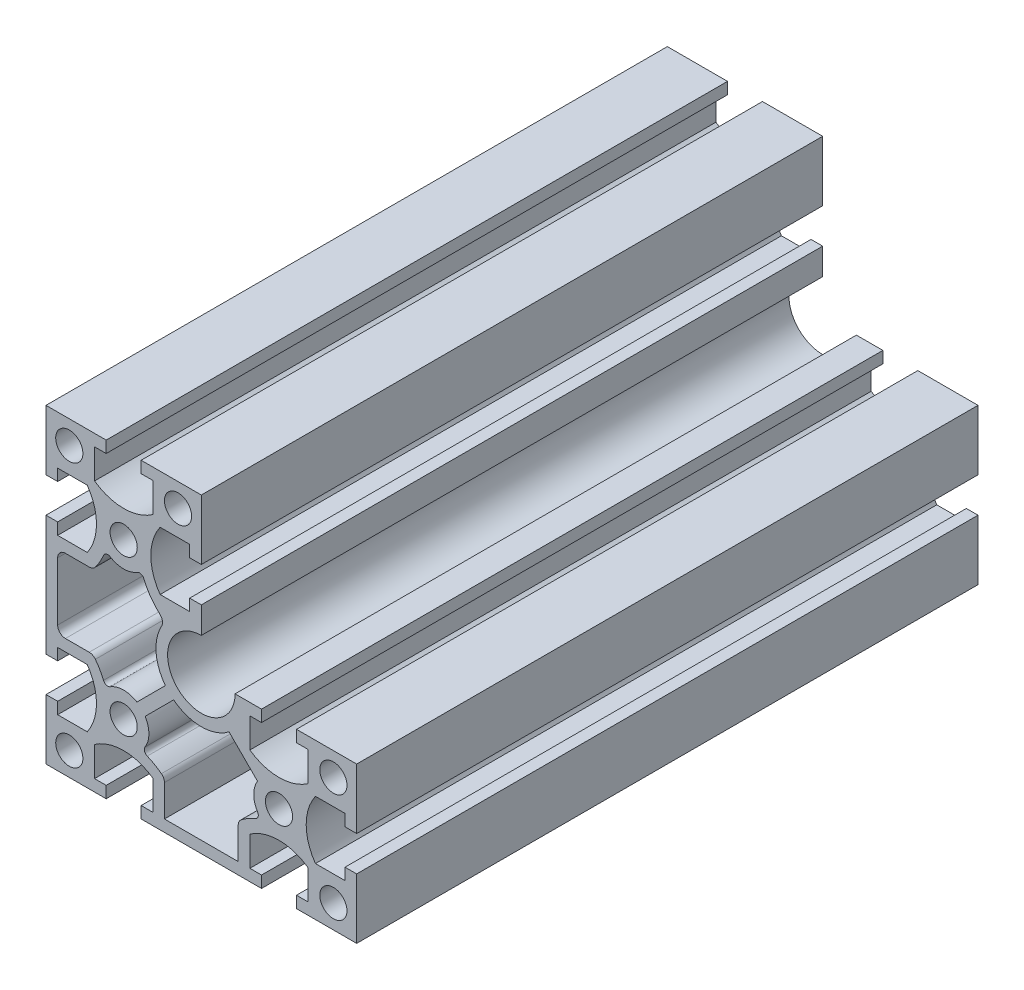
ISO-10303-21;
HEADER;
FILE_DESCRIPTION(('STEP AP214'),'2;1');
FILE_NAME('part.step','',(''),(''),'','','');
FILE_SCHEMA(('AUTOMOTIVE_DESIGN { 1 0 10303 214 1 1 1 1 }'));
ENDSEC;
DATA;
#1=APPLICATION_CONTEXT('core data for automotive mechanical design processes');
#2=APPLICATION_PROTOCOL_DEFINITION('international standard','automotive_design',2000,#1);
#3=PRODUCT_CONTEXT('',#1,'mechanical');
#4=PRODUCT('Part','Part','',(#3));
#5=PRODUCT_RELATED_PRODUCT_CATEGORY('part','',(#4));
#6=PRODUCT_DEFINITION_FORMATION('','',#4);
#7=PRODUCT_DEFINITION_CONTEXT('part definition',#1,'design');
#8=PRODUCT_DEFINITION('design','',#6,#7);
#9=PRODUCT_DEFINITION_SHAPE('','',#8);
#10=(LENGTH_UNIT() NAMED_UNIT(*) SI_UNIT(.MILLI.,.METRE.));
#11=(NAMED_UNIT(*) PLANE_ANGLE_UNIT() SI_UNIT($,.RADIAN.));
#12=(NAMED_UNIT(*) SI_UNIT($,.STERADIAN.) SOLID_ANGLE_UNIT());
#13=UNCERTAINTY_MEASURE_WITH_UNIT(LENGTH_MEASURE(1.E-05),#10,'distance_accuracy_value','');
#14=(GEOMETRIC_REPRESENTATION_CONTEXT(3) GLOBAL_UNCERTAINTY_ASSIGNED_CONTEXT((#13)) GLOBAL_UNIT_ASSIGNED_CONTEXT((#10,
#11,#12)) REPRESENTATION_CONTEXT('',''));
#15=CARTESIAN_POINT('',(0.,0.,0.));
#16=DIRECTION('',(0.,0.,1.));
#17=DIRECTION('',(1.,0.,0.));
#18=AXIS2_PLACEMENT_3D('',#15,#16,#17);
#19=CARTESIAN_POINT('',(0.,10.,40.));
#20=DIRECTION('',(0.,0.,1.));
#21=DIRECTION('',(1.,0.,0.));
#22=AXIS2_PLACEMENT_3D('',#19,#20,#21);
#23=PLANE('',#22);
#24=CARTESIAN_POINT('',(17.,-3.,40.));
#25=DIRECTION('',(0.,0.,1.));
#26=DIRECTION('',(-1.,0.,0.));
#27=AXIS2_PLACEMENT_3D('',#24,#25,#26);
#28=CIRCLE('',#27,1.75);
#29=CARTESIAN_POINT('',(15.25,-3.,40.));
#30=VERTEX_POINT('',#29);
#31=EDGE_CURVE('E2771',#30,#30,#28,.T.);
#32=ORIENTED_EDGE('',*,*,#31,.F.);
#33=EDGE_LOOP('',(#32));
#34=FACE_BOUND('',#33,.T.);
#35=CARTESIAN_POINT('',(-10.,-10.,40.));
#36=DIRECTION('',(0.,0.,1.));
#37=DIRECTION('',(-1.,0.,0.));
#38=AXIS2_PLACEMENT_3D('',#35,#36,#37);
#39=CIRCLE('',#38,1.75);
#40=CARTESIAN_POINT('',(-11.75,-10.,40.));
#41=VERTEX_POINT('',#40);
#42=EDGE_CURVE('E2783',#41,#41,#39,.T.);
#43=ORIENTED_EDGE('',*,*,#42,.F.);
#44=EDGE_LOOP('',(#43));
#45=FACE_BOUND('',#44,.T.);
#46=DIRECTION('',(0.,-1.,0.));
#47=VECTOR('',#46,1.);
#48=CARTESIAN_POINT('',(-4.75,-18.5,40.));
#49=LINE('',#48,#47);
#50=CARTESIAN_POINT('',(-4.75,-14.4378511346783,40.));
#51=VERTEX_POINT('',#50);
#52=CARTESIAN_POINT('',(-4.75,-18.5,40.));
#53=VERTEX_POINT('',#52);
#54=EDGE_CURVE('E680',#51,#53,#49,.T.);
#55=ORIENTED_EDGE('',*,*,#54,.F.);
#56=CARTESIAN_POINT('',(-5.75,-14.4378511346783,40.));
#57=DIRECTION('',(0.,0.,-1.));
#58=DIRECTION('',(1.,0.,0.));
#59=AXIS2_PLACEMENT_3D('',#56,#57,#58);
#60=CIRCLE('',#59,0.999999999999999);
#61=CARTESIAN_POINT('',(-5.14285714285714,-13.6432584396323,40.));
#62=VERTEX_POINT('',#61);
#63=EDGE_CURVE('E672',#62,#51,#60,.T.);
#64=ORIENTED_EDGE('',*,*,#63,.F.);
#65=CARTESIAN_POINT('',(-10.,-20.,40.));
#66=DIRECTION('',(0.,0.,-1.));
#67=DIRECTION('',(-1.,0.,0.));
#68=AXIS2_PLACEMENT_3D('',#65,#66,#67);
#69=CIRCLE('',#68,8.);
#70=CARTESIAN_POINT('',(-6.96451272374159,-12.5982558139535,40.));
#71=VERTEX_POINT('',#70);
#72=EDGE_CURVE('E719',#71,#62,#69,.T.);
#73=ORIENTED_EDGE('',*,*,#72,.F.);
#74=CARTESIAN_POINT('',(-6.73685117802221,-12.043125,40.));
#75=DIRECTION('',(0.,0.,1.));
#76=DIRECTION('',(-1.,0.,0.));
#77=AXIS2_PLACEMENT_3D('',#74,#75,#76);
#78=CIRCLE('',#77,0.6);
#79=CARTESIAN_POINT('',(-7.24539385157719,-11.7247159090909,40.));
#80=VERTEX_POINT('',#79);
#81=EDGE_CURVE('E717',#80,#71,#78,.T.);
#82=ORIENTED_EDGE('',*,*,#81,.F.);
#83=CARTESIAN_POINT('',(-10.,-10.,40.));
#84=DIRECTION('',(0.,0.,-1.));
#85=DIRECTION('',(-1.,0.,0.));
#86=AXIS2_PLACEMENT_3D('',#83,#84,#85);
#87=CIRCLE('',#86,3.25);
#88=CARTESIAN_POINT('',(-7.2336019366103,-8.29426210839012,40.));
#89=VERTEX_POINT('',#88);
#90=EDGE_CURVE('E715',#89,#80,#87,.T.);
#91=ORIENTED_EDGE('',*,*,#90,.F.);
#92=DIRECTION('',(-0.707106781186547,-0.707106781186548,0.));
#93=VECTOR('',#92,1.);
#94=CARTESIAN_POINT('',(-3.56760027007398,-4.6282604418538,40.));
#95=LINE('',#94,#93);
#96=CARTESIAN_POINT('',(-3.56760027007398,-4.6282604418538,40.));
#97=VERTEX_POINT('',#96);
#98=EDGE_CURVE('E713',#97,#89,#95,.T.);
#99=ORIENTED_EDGE('',*,*,#98,.F.);
#100=CARTESIAN_POINT('',(0.,0.,40.));
#101=DIRECTION('',(0.,0.,-1.));
#102=DIRECTION('',(1.,0.,0.));
#103=AXIS2_PLACEMENT_3D('',#100,#101,#102);
#104=CIRCLE('',#103,5.84367747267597);
#105=CARTESIAN_POINT('',(3.56760027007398,-4.6282604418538,40.));
#106=VERTEX_POINT('',#105);
#107=EDGE_CURVE('E711',#106,#97,#104,.T.);
#108=ORIENTED_EDGE('',*,*,#107,.F.);
#109=DIRECTION('',(-0.707106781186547,0.707106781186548,0.));
#110=VECTOR('',#109,1.);
#111=CARTESIAN_POINT('',(3.56760027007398,-4.6282604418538,40.));
#112=LINE('',#111,#110);
#113=CARTESIAN_POINT('',(7.2336019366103,-8.29426210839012,40.));
#114=VERTEX_POINT('',#113);
#115=EDGE_CURVE('E709',#114,#106,#112,.T.);
#116=ORIENTED_EDGE('',*,*,#115,.F.);
#117=CARTESIAN_POINT('',(10.,-10.,40.));
#118=DIRECTION('',(0.,0.,-1.));
#119=DIRECTION('',(1.,0.,0.));
#120=AXIS2_PLACEMENT_3D('',#117,#118,#119);
#121=CIRCLE('',#120,3.25);
#122=CARTESIAN_POINT('',(7.2453938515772,-11.7247159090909,40.));
#123=VERTEX_POINT('',#122);
#124=EDGE_CURVE('E707',#123,#114,#121,.T.);
#125=ORIENTED_EDGE('',*,*,#124,.F.);
#126=CARTESIAN_POINT('',(6.73685117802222,-12.043125,40.));
#127=DIRECTION('',(0.,0.,1.));
#128=DIRECTION('',(1.,0.,0.));
#129=AXIS2_PLACEMENT_3D('',#126,#127,#128);
#130=CIRCLE('',#129,0.6);
#131=CARTESIAN_POINT('',(6.9645127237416,-12.5982558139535,40.));
#132=VERTEX_POINT('',#131);
#133=EDGE_CURVE('E705',#132,#123,#130,.T.);
#134=ORIENTED_EDGE('',*,*,#133,.F.);
#135=CARTESIAN_POINT('',(10.,-20.,40.));
#136=DIRECTION('',(0.,0.,-1.));
#137=DIRECTION('',(1.,0.,0.));
#138=AXIS2_PLACEMENT_3D('',#135,#136,#137);
#139=CIRCLE('',#138,8.);
#140=CARTESIAN_POINT('',(5.14285714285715,-13.6432584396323,40.));
#141=VERTEX_POINT('',#140);
#142=EDGE_CURVE('E703',#141,#132,#139,.T.);
#143=ORIENTED_EDGE('',*,*,#142,.F.);
#144=CARTESIAN_POINT('',(5.75,-14.4378511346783,40.));
#145=DIRECTION('',(0.,0.,-1.));
#146=DIRECTION('',(-1.,0.,0.));
#147=AXIS2_PLACEMENT_3D('',#144,#145,#146);
#148=CIRCLE('',#147,0.999999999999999);
#149=CARTESIAN_POINT('',(4.75,-14.4378511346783,40.));
#150=VERTEX_POINT('',#149);
#151=EDGE_CURVE('E701',#150,#141,#148,.T.);
#152=ORIENTED_EDGE('',*,*,#151,.F.);
#153=DIRECTION('',(0.,1.,0.));
#154=VECTOR('',#153,1.);
#155=CARTESIAN_POINT('',(4.75,-18.5,40.));
#156=LINE('',#155,#154);
#157=CARTESIAN_POINT('',(4.75,-18.5,40.));
#158=VERTEX_POINT('',#157);
#159=EDGE_CURVE('E696',#158,#150,#156,.T.);
#160=ORIENTED_EDGE('',*,*,#159,.F.);
#161=DIRECTION('',(1.,0.,0.));
#162=VECTOR('',#161,1.);
#163=CARTESIAN_POINT('',(-4.75,-18.5,40.));
#164=LINE('',#163,#162);
#165=EDGE_CURVE('E694',#53,#158,#164,.T.);
#166=ORIENTED_EDGE('',*,*,#165,.F.);
#167=EDGE_LOOP('',(#55,#64,#73,#82,#91,#99,#108,#116,#125,#134,#143,#152,#160,#166));
#168=FACE_BOUND('',#167,.T.);
#169=CARTESIAN_POINT('',(-17.,17.,40.));
#170=DIRECTION('',(0.,0.,1.));
#171=DIRECTION('',(1.,0.,0.));
#172=AXIS2_PLACEMENT_3D('',#169,#170,#171);
#173=CIRCLE('',#172,1.75);
#174=CARTESIAN_POINT('',(-15.25,17.,40.));
#175=VERTEX_POINT('',#174);
#176=EDGE_CURVE('E788',#175,#175,#173,.T.);
#177=ORIENTED_EDGE('',*,*,#176,.F.);
#178=EDGE_LOOP('',(#177));
#179=FACE_BOUND('',#178,.T.);
#180=CARTESIAN_POINT('',(-10.,10.,40.));
#181=DIRECTION('',(0.,0.,1.));
#182=DIRECTION('',(1.,0.,0.));
#183=AXIS2_PLACEMENT_3D('',#180,#181,#182);
#184=CIRCLE('',#183,1.75);
#185=CARTESIAN_POINT('',(-8.25,10.,40.));
#186=VERTEX_POINT('',#185);
#187=EDGE_CURVE('E923',#186,#186,#184,.T.);
#188=ORIENTED_EDGE('',*,*,#187,.F.);
#189=EDGE_LOOP('',(#188));
#190=FACE_BOUND('',#189,.T.);
#191=DIRECTION('',(0.,1.,0.));
#192=VECTOR('',#191,1.);
#193=CARTESIAN_POINT('',(0.,20.,40.));
#194=LINE('',#193,#192);
#195=CARTESIAN_POINT('',(0.,12.25,40.));
#196=VERTEX_POINT('',#195);
#197=CARTESIAN_POINT('',(0.,20.,40.));
#198=VERTEX_POINT('',#197);
#199=EDGE_CURVE('E929',#196,#198,#194,.T.);
#200=ORIENTED_EDGE('',*,*,#199,.T.);
#201=DIRECTION('',(-1.,0.,0.));
#202=VECTOR('',#201,1.);
#203=CARTESIAN_POINT('',(0.,20.,40.));
#204=LINE('',#203,#202);
#205=CARTESIAN_POINT('',(-7.75,20.,40.));
#206=VERTEX_POINT('',#205);
#207=EDGE_CURVE('E932',#198,#206,#204,.T.);
#208=ORIENTED_EDGE('',*,*,#207,.T.);
#209=DIRECTION('',(0.,-1.,0.));
#210=VECTOR('',#209,1.);
#211=CARTESIAN_POINT('',(-7.75,20.,40.));
#212=LINE('',#211,#210);
#213=CARTESIAN_POINT('',(-7.75,18.5,40.));
#214=VERTEX_POINT('',#213);
#215=EDGE_CURVE('E935',#206,#214,#212,.T.);
#216=ORIENTED_EDGE('',*,*,#215,.T.);
#217=DIRECTION('',(1.,0.,0.));
#218=VECTOR('',#217,1.);
#219=CARTESIAN_POINT('',(-7.75,18.5,40.));
#220=LINE('',#219,#218);
#221=CARTESIAN_POINT('',(-6.25,18.5,40.));
#222=VERTEX_POINT('',#221);
#223=EDGE_CURVE('E937',#214,#222,#220,.T.);
#224=ORIENTED_EDGE('',*,*,#223,.T.);
#225=DIRECTION('',(0.,-1.,0.));
#226=VECTOR('',#225,1.);
#227=CARTESIAN_POINT('',(-6.25,18.5,40.));
#228=LINE('',#227,#226);
#229=CARTESIAN_POINT('',(-6.25,14.6908098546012,40.));
#230=VERTEX_POINT('',#229);
#231=EDGE_CURVE('E939',#222,#230,#228,.T.);
#232=ORIENTED_EDGE('',*,*,#231,.T.);
#233=CARTESIAN_POINT('',(-10.,20.,40.));
#234=DIRECTION('',(0.,0.,-1.));
#235=DIRECTION('',(1.,0.,0.));
#236=AXIS2_PLACEMENT_3D('',#233,#234,#235);
#237=CIRCLE('',#236,6.5);
#238=CARTESIAN_POINT('',(-13.75,14.6908098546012,40.));
#239=VERTEX_POINT('',#238);
#240=EDGE_CURVE('E941',#230,#239,#237,.T.);
#241=ORIENTED_EDGE('',*,*,#240,.T.);
#242=DIRECTION('',(0.,1.,0.));
#243=VECTOR('',#242,1.);
#244=CARTESIAN_POINT('',(-13.75,14.6908098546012,40.));
#245=LINE('',#244,#243);
#246=CARTESIAN_POINT('',(-13.75,18.5,40.));
#247=VERTEX_POINT('',#246);
#248=EDGE_CURVE('E943',#239,#247,#245,.T.);
#249=ORIENTED_EDGE('',*,*,#248,.T.);
#250=DIRECTION('',(1.,0.,0.));
#251=VECTOR('',#250,1.);
#252=CARTESIAN_POINT('',(-13.75,18.5,40.));
#253=LINE('',#252,#251);
#254=CARTESIAN_POINT('',(-12.25,18.5,40.));
#255=VERTEX_POINT('',#254);
#256=EDGE_CURVE('E945',#247,#255,#253,.T.);
#257=ORIENTED_EDGE('',*,*,#256,.T.);
#258=DIRECTION('',(0.,1.,0.));
#259=VECTOR('',#258,1.);
#260=CARTESIAN_POINT('',(-12.25,18.5,40.));
#261=LINE('',#260,#259);
#262=CARTESIAN_POINT('',(-12.25,20.,40.));
#263=VERTEX_POINT('',#262);
#264=EDGE_CURVE('E947',#255,#263,#261,.T.);
#265=ORIENTED_EDGE('',*,*,#264,.T.);
#266=DIRECTION('',(-1.,0.,0.));
#267=VECTOR('',#266,1.);
#268=CARTESIAN_POINT('',(-12.25,20.,40.));
#269=LINE('',#268,#267);
#270=CARTESIAN_POINT('',(-20.,20.,40.));
#271=VERTEX_POINT('',#270);
#272=EDGE_CURVE('E949',#263,#271,#269,.T.);
#273=ORIENTED_EDGE('',*,*,#272,.T.);
#274=DIRECTION('',(0.,-1.,0.));
#275=VECTOR('',#274,1.);
#276=CARTESIAN_POINT('',(-20.,20.,40.));
#277=LINE('',#276,#275);
#278=CARTESIAN_POINT('',(-20.,12.25,40.));
#279=VERTEX_POINT('',#278);
#280=EDGE_CURVE('E951',#271,#279,#277,.T.);
#281=ORIENTED_EDGE('',*,*,#280,.T.);
#282=DIRECTION('',(1.,0.,0.));
#283=VECTOR('',#282,1.);
#284=CARTESIAN_POINT('',(-20.,12.25,40.));
#285=LINE('',#284,#283);
#286=CARTESIAN_POINT('',(-18.5,12.25,40.));
#287=VERTEX_POINT('',#286);
#288=EDGE_CURVE('E953',#279,#287,#285,.T.);
#289=ORIENTED_EDGE('',*,*,#288,.T.);
#290=DIRECTION('',(0.,1.,0.));
#291=VECTOR('',#290,1.);
#292=CARTESIAN_POINT('',(-18.5,12.25,40.));
#293=LINE('',#292,#291);
#294=CARTESIAN_POINT('',(-18.5,13.75,40.));
#295=VERTEX_POINT('',#294);
#296=EDGE_CURVE('E955',#287,#295,#293,.T.);
#297=ORIENTED_EDGE('',*,*,#296,.T.);
#298=DIRECTION('',(1.,0.,0.));
#299=VECTOR('',#298,1.);
#300=CARTESIAN_POINT('',(-18.5,13.75,40.));
#301=LINE('',#300,#299);
#302=CARTESIAN_POINT('',(-14.6908098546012,13.75,40.));
#303=VERTEX_POINT('',#302);
#304=EDGE_CURVE('E957',#295,#303,#301,.T.);
#305=ORIENTED_EDGE('',*,*,#304,.T.);
#306=CARTESIAN_POINT('',(-20.,10.,40.));
#307=DIRECTION('',(0.,0.,-1.));
#308=DIRECTION('',(-1.,0.,0.));
#309=AXIS2_PLACEMENT_3D('',#306,#307,#308);
#310=CIRCLE('',#309,6.5);
#311=CARTESIAN_POINT('',(-14.6908098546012,6.25,40.));
#312=VERTEX_POINT('',#311);
#313=EDGE_CURVE('E959',#303,#312,#310,.T.);
#314=ORIENTED_EDGE('',*,*,#313,.T.);
#315=DIRECTION('',(-1.,0.,0.));
#316=VECTOR('',#315,1.);
#317=CARTESIAN_POINT('',(-14.6908098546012,6.25,40.));
#318=LINE('',#317,#316);
#319=CARTESIAN_POINT('',(-18.5,6.25,40.));
#320=VERTEX_POINT('',#319);
#321=EDGE_CURVE('E961',#312,#320,#318,.T.);
#322=ORIENTED_EDGE('',*,*,#321,.T.);
#323=DIRECTION('',(0.,1.,0.));
#324=VECTOR('',#323,1.);
#325=CARTESIAN_POINT('',(-18.5,6.25,40.));
#326=LINE('',#325,#324);
#327=CARTESIAN_POINT('',(-18.5,7.75,40.));
#328=VERTEX_POINT('',#327);
#329=EDGE_CURVE('E963',#320,#328,#326,.T.);
#330=ORIENTED_EDGE('',*,*,#329,.T.);
#331=DIRECTION('',(-1.,0.,0.));
#332=VECTOR('',#331,1.);
#333=CARTESIAN_POINT('',(-18.5,7.75,40.));
#334=LINE('',#333,#332);
#335=CARTESIAN_POINT('',(-20.,7.75,40.));
#336=VERTEX_POINT('',#335);
#337=EDGE_CURVE('E965',#328,#336,#334,.T.);
#338=ORIENTED_EDGE('',*,*,#337,.T.);
#339=DIRECTION('',(0.,-1.,0.));
#340=VECTOR('',#339,1.);
#341=CARTESIAN_POINT('',(-20.,7.75,40.));
#342=LINE('',#341,#340);
#343=CARTESIAN_POINT('',(-20.,-7.75,40.));
#344=VERTEX_POINT('',#343);
#345=EDGE_CURVE('E967',#336,#344,#342,.T.);
#346=ORIENTED_EDGE('',*,*,#345,.T.);
#347=DIRECTION('',(1.,0.,0.));
#348=VECTOR('',#347,1.);
#349=CARTESIAN_POINT('',(-18.5,-7.75,40.));
#350=LINE('',#349,#348);
#351=CARTESIAN_POINT('',(-18.5,-7.75,40.));
#352=VERTEX_POINT('',#351);
#353=EDGE_CURVE('E969',#344,#352,#350,.T.);
#354=ORIENTED_EDGE('',*,*,#353,.T.);
#355=DIRECTION('',(0.,1.,0.));
#356=VECTOR('',#355,1.);
#357=CARTESIAN_POINT('',(-18.5,-6.25,40.));
#358=LINE('',#357,#356);
#359=CARTESIAN_POINT('',(-18.5,-6.25,40.));
#360=VERTEX_POINT('',#359);
#361=EDGE_CURVE('E971',#352,#360,#358,.T.);
#362=ORIENTED_EDGE('',*,*,#361,.T.);
#363=DIRECTION('',(1.,0.,0.));
#364=VECTOR('',#363,1.);
#365=CARTESIAN_POINT('',(-14.6908098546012,-6.25,40.));
#366=LINE('',#365,#364);
#367=CARTESIAN_POINT('',(-14.6908098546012,-6.25,40.));
#368=VERTEX_POINT('',#367);
#369=EDGE_CURVE('E973',#360,#368,#366,.T.);
#370=ORIENTED_EDGE('',*,*,#369,.T.);
#371=CARTESIAN_POINT('',(-20.,-10.,40.));
#372=DIRECTION('',(0.,0.,-1.));
#373=DIRECTION('',(1.,0.,0.));
#374=AXIS2_PLACEMENT_3D('',#371,#372,#373);
#375=CIRCLE('',#374,6.5);
#376=CARTESIAN_POINT('',(-14.6908098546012,-13.75,40.));
#377=VERTEX_POINT('',#376);
#378=EDGE_CURVE('E975',#368,#377,#375,.T.);
#379=ORIENTED_EDGE('',*,*,#378,.T.);
#380=DIRECTION('',(-1.,0.,0.));
#381=VECTOR('',#380,1.);
#382=CARTESIAN_POINT('',(-18.5,-13.75,40.));
#383=LINE('',#382,#381);
#384=CARTESIAN_POINT('',(-18.5,-13.75,40.));
#385=VERTEX_POINT('',#384);
#386=EDGE_CURVE('E977',#377,#385,#383,.T.);
#387=ORIENTED_EDGE('',*,*,#386,.T.);
#388=DIRECTION('',(0.,1.,0.));
#389=VECTOR('',#388,1.);
#390=CARTESIAN_POINT('',(-18.5,-12.25,40.));
#391=LINE('',#390,#389);
#392=CARTESIAN_POINT('',(-18.5,-12.25,40.));
#393=VERTEX_POINT('',#392);
#394=EDGE_CURVE('E979',#385,#393,#391,.T.);
#395=ORIENTED_EDGE('',*,*,#394,.T.);
#396=DIRECTION('',(-1.,0.,0.));
#397=VECTOR('',#396,1.);
#398=CARTESIAN_POINT('',(-20.,-12.25,40.));
#399=LINE('',#398,#397);
#400=CARTESIAN_POINT('',(-20.,-12.25,40.));
#401=VERTEX_POINT('',#400);
#402=EDGE_CURVE('E981',#393,#401,#399,.T.);
#403=ORIENTED_EDGE('',*,*,#402,.T.);
#404=DIRECTION('',(0.,-1.,0.));
#405=VECTOR('',#404,1.);
#406=CARTESIAN_POINT('',(-20.,-20.,40.));
#407=LINE('',#406,#405);
#408=CARTESIAN_POINT('',(-20.,-20.,40.));
#409=VERTEX_POINT('',#408);
#410=EDGE_CURVE('E983',#401,#409,#407,.T.);
#411=ORIENTED_EDGE('',*,*,#410,.T.);
#412=DIRECTION('',(1.,0.,0.));
#413=VECTOR('',#412,1.);
#414=CARTESIAN_POINT('',(-12.25,-20.,40.));
#415=LINE('',#414,#413);
#416=CARTESIAN_POINT('',(-12.25,-20.,40.));
#417=VERTEX_POINT('',#416);
#418=EDGE_CURVE('E985',#409,#417,#415,.T.);
#419=ORIENTED_EDGE('',*,*,#418,.T.);
#420=DIRECTION('',(0.,1.,0.));
#421=VECTOR('',#420,1.);
#422=CARTESIAN_POINT('',(-12.25,-18.5,40.));
#423=LINE('',#422,#421);
#424=CARTESIAN_POINT('',(-12.25,-18.5,40.));
#425=VERTEX_POINT('',#424);
#426=EDGE_CURVE('E987',#417,#425,#423,.T.);
#427=ORIENTED_EDGE('',*,*,#426,.T.);
#428=DIRECTION('',(-1.,0.,0.));
#429=VECTOR('',#428,1.);
#430=CARTESIAN_POINT('',(-13.75,-18.5,40.));
#431=LINE('',#430,#429);
#432=CARTESIAN_POINT('',(-13.75,-18.5,40.));
#433=VERTEX_POINT('',#432);
#434=EDGE_CURVE('E989',#425,#433,#431,.T.);
#435=ORIENTED_EDGE('',*,*,#434,.T.);
#436=DIRECTION('',(0.,1.,0.));
#437=VECTOR('',#436,1.);
#438=CARTESIAN_POINT('',(-13.75,-14.6908098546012,40.));
#439=LINE('',#438,#437);
#440=CARTESIAN_POINT('',(-13.75,-14.6908098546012,40.));
#441=VERTEX_POINT('',#440);
#442=EDGE_CURVE('E991',#433,#441,#439,.T.);
#443=ORIENTED_EDGE('',*,*,#442,.T.);
#444=CARTESIAN_POINT('',(-10.,-20.,40.));
#445=DIRECTION('',(0.,0.,-1.));
#446=DIRECTION('',(-1.,0.,0.));
#447=AXIS2_PLACEMENT_3D('',#444,#445,#446);
#448=CIRCLE('',#447,6.5);
#449=CARTESIAN_POINT('',(-6.25,-14.6908098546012,40.));
#450=VERTEX_POINT('',#449);
#451=EDGE_CURVE('E993',#441,#450,#448,.T.);
#452=ORIENTED_EDGE('',*,*,#451,.T.);
#453=DIRECTION('',(0.,-1.,0.));
#454=VECTOR('',#453,1.);
#455=CARTESIAN_POINT('',(-6.25,-18.5,40.));
#456=LINE('',#455,#454);
#457=CARTESIAN_POINT('',(-6.25,-18.5,40.));
#458=VERTEX_POINT('',#457);
#459=EDGE_CURVE('E995',#450,#458,#456,.T.);
#460=ORIENTED_EDGE('',*,*,#459,.T.);
#461=DIRECTION('',(-1.,0.,0.));
#462=VECTOR('',#461,1.);
#463=CARTESIAN_POINT('',(-7.75,-18.5,40.));
#464=LINE('',#463,#462);
#465=CARTESIAN_POINT('',(-7.75,-18.5,40.));
#466=VERTEX_POINT('',#465);
#467=EDGE_CURVE('E997',#458,#466,#464,.T.);
#468=ORIENTED_EDGE('',*,*,#467,.T.);
#469=DIRECTION('',(0.,-1.,0.));
#470=VECTOR('',#469,1.);
#471=CARTESIAN_POINT('',(-7.75,-20.,40.));
#472=LINE('',#471,#470);
#473=CARTESIAN_POINT('',(-7.75,-20.,40.));
#474=VERTEX_POINT('',#473);
#475=EDGE_CURVE('E999',#466,#474,#472,.T.);
#476=ORIENTED_EDGE('',*,*,#475,.T.);
#477=DIRECTION('',(1.,0.,0.));
#478=VECTOR('',#477,1.);
#479=CARTESIAN_POINT('',(-7.75,-20.,40.));
#480=LINE('',#479,#478);
#481=CARTESIAN_POINT('',(7.75,-20.,40.));
#482=VERTEX_POINT('',#481);
#483=EDGE_CURVE('E1001',#474,#482,#480,.T.);
#484=ORIENTED_EDGE('',*,*,#483,.T.);
#485=DIRECTION('',(0.,1.,0.));
#486=VECTOR('',#485,1.);
#487=CARTESIAN_POINT('',(7.75,-20.,40.));
#488=LINE('',#487,#486);
#489=CARTESIAN_POINT('',(7.75,-18.5,40.));
#490=VERTEX_POINT('',#489);
#491=EDGE_CURVE('E1003',#482,#490,#488,.T.);
#492=ORIENTED_EDGE('',*,*,#491,.T.);
#493=DIRECTION('',(-1.,0.,0.));
#494=VECTOR('',#493,1.);
#495=CARTESIAN_POINT('',(7.75,-18.5,40.));
#496=LINE('',#495,#494);
#497=CARTESIAN_POINT('',(6.25,-18.5,40.));
#498=VERTEX_POINT('',#497);
#499=EDGE_CURVE('E1005',#490,#498,#496,.T.);
#500=ORIENTED_EDGE('',*,*,#499,.T.);
#501=DIRECTION('',(0.,1.,0.));
#502=VECTOR('',#501,1.);
#503=CARTESIAN_POINT('',(6.25,-18.5,40.));
#504=LINE('',#503,#502);
#505=CARTESIAN_POINT('',(6.25,-14.6908098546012,40.));
#506=VERTEX_POINT('',#505);
#507=EDGE_CURVE('E1007',#498,#506,#504,.T.);
#508=ORIENTED_EDGE('',*,*,#507,.T.);
#509=CARTESIAN_POINT('',(10.,-20.,40.));
#510=DIRECTION('',(0.,0.,-1.));
#511=DIRECTION('',(1.,0.,0.));
#512=AXIS2_PLACEMENT_3D('',#509,#510,#511);
#513=CIRCLE('',#512,6.5);
#514=CARTESIAN_POINT('',(13.75,-14.6908098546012,40.));
#515=VERTEX_POINT('',#514);
#516=EDGE_CURVE('E1009',#506,#515,#513,.T.);
#517=ORIENTED_EDGE('',*,*,#516,.T.);
#518=DIRECTION('',(0.,-1.,0.));
#519=VECTOR('',#518,1.);
#520=CARTESIAN_POINT('',(13.75,-14.6908098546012,40.));
#521=LINE('',#520,#519);
#522=CARTESIAN_POINT('',(13.75,-18.5,40.));
#523=VERTEX_POINT('',#522);
#524=EDGE_CURVE('E1011',#515,#523,#521,.T.);
#525=ORIENTED_EDGE('',*,*,#524,.T.);
#526=DIRECTION('',(-1.,0.,0.));
#527=VECTOR('',#526,1.);
#528=CARTESIAN_POINT('',(13.75,-18.5,40.));
#529=LINE('',#528,#527);
#530=CARTESIAN_POINT('',(12.25,-18.5,40.));
#531=VERTEX_POINT('',#530);
#532=EDGE_CURVE('E1013',#523,#531,#529,.T.);
#533=ORIENTED_EDGE('',*,*,#532,.T.);
#534=DIRECTION('',(0.,-1.,0.));
#535=VECTOR('',#534,1.);
#536=CARTESIAN_POINT('',(12.25,-18.5,40.));
#537=LINE('',#536,#535);
#538=CARTESIAN_POINT('',(12.25,-20.,40.));
#539=VERTEX_POINT('',#538);
#540=EDGE_CURVE('E1015',#531,#539,#537,.T.);
#541=ORIENTED_EDGE('',*,*,#540,.T.);
#542=DIRECTION('',(1.,0.,0.));
#543=VECTOR('',#542,1.);
#544=CARTESIAN_POINT('',(12.25,-20.,40.));
#545=LINE('',#544,#543);
#546=CARTESIAN_POINT('',(20.,-20.,40.));
#547=VERTEX_POINT('',#546);
#548=EDGE_CURVE('E1017',#539,#547,#545,.T.);
#549=ORIENTED_EDGE('',*,*,#548,.T.);
#550=DIRECTION('',(0.,1.,0.));
#551=VECTOR('',#550,1.);
#552=CARTESIAN_POINT('',(20.,-20.,40.));
#553=LINE('',#552,#551);
#554=CARTESIAN_POINT('',(20.,-12.25,40.));
#555=VERTEX_POINT('',#554);
#556=EDGE_CURVE('E1019',#547,#555,#553,.T.);
#557=ORIENTED_EDGE('',*,*,#556,.T.);
#558=DIRECTION('',(-1.,0.,0.));
#559=VECTOR('',#558,1.);
#560=CARTESIAN_POINT('',(20.,-12.25,40.));
#561=LINE('',#560,#559);
#562=CARTESIAN_POINT('',(18.5,-12.25,40.));
#563=VERTEX_POINT('',#562);
#564=EDGE_CURVE('E1021',#555,#563,#561,.T.);
#565=ORIENTED_EDGE('',*,*,#564,.T.);
#566=DIRECTION('',(0.,-1.,0.));
#567=VECTOR('',#566,1.);
#568=CARTESIAN_POINT('',(18.5,-12.25,40.));
#569=LINE('',#568,#567);
#570=CARTESIAN_POINT('',(18.5,-13.75,40.));
#571=VERTEX_POINT('',#570);
#572=EDGE_CURVE('E1023',#563,#571,#569,.T.);
#573=ORIENTED_EDGE('',*,*,#572,.T.);
#574=DIRECTION('',(-1.,0.,0.));
#575=VECTOR('',#574,1.);
#576=CARTESIAN_POINT('',(18.5,-13.75,40.));
#577=LINE('',#576,#575);
#578=CARTESIAN_POINT('',(14.6908098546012,-13.75,40.));
#579=VERTEX_POINT('',#578);
#580=EDGE_CURVE('E1025',#571,#579,#577,.T.);
#581=ORIENTED_EDGE('',*,*,#580,.T.);
#582=CARTESIAN_POINT('',(20.,-10.,40.));
#583=DIRECTION('',(0.,0.,-1.));
#584=DIRECTION('',(-1.,0.,0.));
#585=AXIS2_PLACEMENT_3D('',#582,#583,#584);
#586=CIRCLE('',#585,6.5);
#587=CARTESIAN_POINT('',(14.6908098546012,-6.25,40.));
#588=VERTEX_POINT('',#587);
#589=EDGE_CURVE('E1027',#579,#588,#586,.T.);
#590=ORIENTED_EDGE('',*,*,#589,.T.);
#591=DIRECTION('',(1.,0.,0.));
#592=VECTOR('',#591,1.);
#593=CARTESIAN_POINT('',(14.6908098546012,-6.25,40.));
#594=LINE('',#593,#592);
#595=CARTESIAN_POINT('',(18.5,-6.25,40.));
#596=VERTEX_POINT('',#595);
#597=EDGE_CURVE('E1029',#588,#596,#594,.T.);
#598=ORIENTED_EDGE('',*,*,#597,.T.);
#599=DIRECTION('',(0.,-1.,0.));
#600=VECTOR('',#599,1.);
#601=CARTESIAN_POINT('',(18.5,-6.25,40.));
#602=LINE('',#601,#600);
#603=CARTESIAN_POINT('',(18.5,-7.75,40.));
#604=VERTEX_POINT('',#603);
#605=EDGE_CURVE('E1031',#596,#604,#602,.T.);
#606=ORIENTED_EDGE('',*,*,#605,.T.);
#607=DIRECTION('',(1.,0.,0.));
#608=VECTOR('',#607,1.);
#609=CARTESIAN_POINT('',(18.5,-7.75,40.));
#610=LINE('',#609,#608);
#611=CARTESIAN_POINT('',(20.,-7.75,40.));
#612=VERTEX_POINT('',#611);
#613=EDGE_CURVE('E1033',#604,#612,#610,.T.);
#614=ORIENTED_EDGE('',*,*,#613,.T.);
#615=DIRECTION('',(0.,1.,0.));
#616=VECTOR('',#615,1.);
#617=CARTESIAN_POINT('',(20.,-7.75,40.));
#618=LINE('',#617,#616);
#619=CARTESIAN_POINT('',(20.,0.,40.));
#620=VERTEX_POINT('',#619);
#621=EDGE_CURVE('E1035',#612,#620,#618,.T.);
#622=ORIENTED_EDGE('',*,*,#621,.T.);
#623=DIRECTION('',(-1.,0.,0.));
#624=VECTOR('',#623,1.);
#625=CARTESIAN_POINT('',(12.25,0.,40.));
#626=LINE('',#625,#624);
#627=CARTESIAN_POINT('',(12.25,0.,40.));
#628=VERTEX_POINT('',#627);
#629=EDGE_CURVE('E1037',#620,#628,#626,.T.);
#630=ORIENTED_EDGE('',*,*,#629,.T.);
#631=DIRECTION('',(0.,-1.,0.));
#632=VECTOR('',#631,1.);
#633=CARTESIAN_POINT('',(12.25,-1.5,40.));
#634=LINE('',#633,#632);
#635=CARTESIAN_POINT('',(12.25,-1.5,40.));
#636=VERTEX_POINT('',#635);
#637=EDGE_CURVE('E1039',#628,#636,#634,.T.);
#638=ORIENTED_EDGE('',*,*,#637,.T.);
#639=DIRECTION('',(1.,0.,0.));
#640=VECTOR('',#639,1.);
#641=CARTESIAN_POINT('',(13.75,-1.5,40.));
#642=LINE('',#641,#640);
#643=CARTESIAN_POINT('',(13.75,-1.5,40.));
#644=VERTEX_POINT('',#643);
#645=EDGE_CURVE('E1041',#636,#644,#642,.T.);
#646=ORIENTED_EDGE('',*,*,#645,.T.);
#647=DIRECTION('',(0.,-1.,0.));
#648=VECTOR('',#647,1.);
#649=CARTESIAN_POINT('',(13.75,-5.30919014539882,40.));
#650=LINE('',#649,#648);
#651=CARTESIAN_POINT('',(13.75,-5.30919014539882,40.));
#652=VERTEX_POINT('',#651);
#653=EDGE_CURVE('E1043',#644,#652,#650,.T.);
#654=ORIENTED_EDGE('',*,*,#653,.T.);
#655=CARTESIAN_POINT('',(10.,0.,40.));
#656=DIRECTION('',(0.,0.,-1.));
#657=DIRECTION('',(-1.,0.,0.));
#658=AXIS2_PLACEMENT_3D('',#655,#656,#657);
#659=CIRCLE('',#658,6.5);
#660=CARTESIAN_POINT('',(6.25,-5.30919014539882,40.));
#661=VERTEX_POINT('',#660);
#662=EDGE_CURVE('E1045',#652,#661,#659,.T.);
#663=ORIENTED_EDGE('',*,*,#662,.T.);
#664=DIRECTION('',(0.,1.,0.));
#665=VECTOR('',#664,1.);
#666=CARTESIAN_POINT('',(6.25,-1.50000000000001,40.));
#667=LINE('',#666,#665);
#668=CARTESIAN_POINT('',(6.25,-1.50000000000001,40.));
#669=VERTEX_POINT('',#668);
#670=EDGE_CURVE('E1047',#661,#669,#667,.T.);
#671=ORIENTED_EDGE('',*,*,#670,.T.);
#672=DIRECTION('',(1.,0.,0.));
#673=VECTOR('',#672,1.);
#674=CARTESIAN_POINT('',(7.75,-1.50000000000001,40.));
#675=LINE('',#674,#673);
#676=CARTESIAN_POINT('',(7.75,-1.50000000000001,40.));
#677=VERTEX_POINT('',#676);
#678=EDGE_CURVE('E1049',#669,#677,#675,.T.);
#679=ORIENTED_EDGE('',*,*,#678,.T.);
#680=DIRECTION('',(0.,1.,0.));
#681=VECTOR('',#680,1.);
#682=CARTESIAN_POINT('',(7.75,0.,40.));
#683=LINE('',#682,#681);
#684=CARTESIAN_POINT('',(7.75,0.,40.));
#685=VERTEX_POINT('',#684);
#686=EDGE_CURVE('E1051',#677,#685,#683,.T.);
#687=ORIENTED_EDGE('',*,*,#686,.T.);
#688=DIRECTION('',(-1.,0.,0.));
#689=VECTOR('',#688,1.);
#690=CARTESIAN_POINT('',(7.75,0.,40.));
#691=LINE('',#690,#689);
#692=CARTESIAN_POINT('',(4.34367747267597,0.,40.));
#693=VERTEX_POINT('',#692);
#694=EDGE_CURVE('E1053',#685,#693,#691,.T.);
#695=ORIENTED_EDGE('',*,*,#694,.T.);
#696=CARTESIAN_POINT('',(0.,0.,40.));
#697=DIRECTION('',(0.,0.,-1.));
#698=DIRECTION('',(1.,0.,0.));
#699=AXIS2_PLACEMENT_3D('',#696,#697,#698);
#700=CIRCLE('',#699,4.34367747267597);
#701=CARTESIAN_POINT('',(0.,4.34367747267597,40.));
#702=VERTEX_POINT('',#701);
#703=EDGE_CURVE('E1055',#693,#702,#700,.T.);
#704=ORIENTED_EDGE('',*,*,#703,.T.);
#705=DIRECTION('',(0.,1.,0.));
#706=VECTOR('',#705,1.);
#707=CARTESIAN_POINT('',(0.,7.75000000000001,40.));
#708=LINE('',#707,#706);
#709=CARTESIAN_POINT('',(0.,7.75000000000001,40.));
#710=VERTEX_POINT('',#709);
#711=EDGE_CURVE('E1057',#702,#710,#708,.T.);
#712=ORIENTED_EDGE('',*,*,#711,.T.);
#713=DIRECTION('',(-1.,0.,0.));
#714=VECTOR('',#713,1.);
#715=CARTESIAN_POINT('',(-1.49999999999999,7.75,40.));
#716=LINE('',#715,#714);
#717=CARTESIAN_POINT('',(-1.49999999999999,7.75,40.));
#718=VERTEX_POINT('',#717);
#719=EDGE_CURVE('E1059',#710,#718,#716,.T.);
#720=ORIENTED_EDGE('',*,*,#719,.T.);
#721=DIRECTION('',(0.,-1.,0.));
#722=VECTOR('',#721,1.);
#723=CARTESIAN_POINT('',(-1.49999999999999,6.25,40.));
#724=LINE('',#723,#722);
#725=CARTESIAN_POINT('',(-1.49999999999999,6.25,40.));
#726=VERTEX_POINT('',#725);
#727=EDGE_CURVE('E1061',#718,#726,#724,.T.);
#728=ORIENTED_EDGE('',*,*,#727,.T.);
#729=DIRECTION('',(-1.,0.,0.));
#730=VECTOR('',#729,1.);
#731=CARTESIAN_POINT('',(-5.30919014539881,6.25,40.));
#732=LINE('',#731,#730);
#733=CARTESIAN_POINT('',(-5.30919014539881,6.25,40.));
#734=VERTEX_POINT('',#733);
#735=EDGE_CURVE('E1063',#726,#734,#732,.T.);
#736=ORIENTED_EDGE('',*,*,#735,.T.);
#737=CARTESIAN_POINT('',(0.,10.,40.));
#738=DIRECTION('',(0.,0.,-1.));
#739=DIRECTION('',(1.,0.,0.));
#740=AXIS2_PLACEMENT_3D('',#737,#738,#739);
#741=CIRCLE('',#740,6.5);
#742=CARTESIAN_POINT('',(-5.30919014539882,13.75,40.));
#743=VERTEX_POINT('',#742);
#744=EDGE_CURVE('E1065',#734,#743,#741,.T.);
#745=ORIENTED_EDGE('',*,*,#744,.T.);
#746=DIRECTION('',(1.,0.,0.));
#747=VECTOR('',#746,1.);
#748=CARTESIAN_POINT('',(-1.49999999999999,13.75,40.));
#749=LINE('',#748,#747);
#750=CARTESIAN_POINT('',(-1.49999999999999,13.75,40.));
#751=VERTEX_POINT('',#750);
#752=EDGE_CURVE('E1067',#743,#751,#749,.T.);
#753=ORIENTED_EDGE('',*,*,#752,.T.);
#754=DIRECTION('',(0.,-1.,0.));
#755=VECTOR('',#754,1.);
#756=CARTESIAN_POINT('',(-1.49999999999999,12.25,40.));
#757=LINE('',#756,#755);
#758=CARTESIAN_POINT('',(-1.49999999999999,12.25,40.));
#759=VERTEX_POINT('',#758);
#760=EDGE_CURVE('E1069',#751,#759,#757,.T.);
#761=ORIENTED_EDGE('',*,*,#760,.T.);
#762=DIRECTION('',(1.,0.,0.));
#763=VECTOR('',#762,1.);
#764=CARTESIAN_POINT('',(0.,12.25,40.));
#765=LINE('',#764,#763);
#766=EDGE_CURVE('E1071',#759,#196,#765,.T.);
#767=ORIENTED_EDGE('',*,*,#766,.T.);
#768=EDGE_LOOP('',(#200,#208,#216,#224,#232,#241,#249,#257,#265,#273,#281,#289,#297,#305,#314,
#322,#330,#338,#346,#354,#362,#370,#379,#387,#395,#403,#411,#419,#427,#435,#443,#452,#460,#468,
#476,#484,#492,#500,#508,#517,#525,#533,#541,#549,#557,#565,#573,#581,#590,#598,#606,#614,#622,
#630,#638,#646,#654,#663,#671,#679,#687,#695,#704,#712,#720,#728,#736,#745,#753,#761,#767));
#769=FACE_BOUND('',#768,.T.);
#770=CARTESIAN_POINT('',(-10.,10.,40.));
#771=DIRECTION('',(0.,0.,-1.));
#772=DIRECTION('',(1.,0.,0.));
#773=AXIS2_PLACEMENT_3D('',#770,#771,#772);
#774=CIRCLE('',#773,3.25);
#775=CARTESIAN_POINT('',(-8.27528409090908,7.2453938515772,40.));
#776=VERTEX_POINT('',#775);
#777=CARTESIAN_POINT('',(-11.7247159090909,7.2453938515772,40.));
#778=VERTEX_POINT('',#777);
#779=EDGE_CURVE('E796',#776,#778,#774,.T.);
#780=ORIENTED_EDGE('',*,*,#779,.F.);
#781=CARTESIAN_POINT('',(-7.95687499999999,6.73685117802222,40.));
#782=DIRECTION('',(0.,0.,1.));
#783=DIRECTION('',(1.,0.,0.));
#784=AXIS2_PLACEMENT_3D('',#781,#782,#783);
#785=CIRCLE('',#784,0.6);
#786=CARTESIAN_POINT('',(-7.40174418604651,6.9645127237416,40.));
#787=VERTEX_POINT('',#786);
#788=EDGE_CURVE('E794',#787,#776,#785,.T.);
#789=ORIENTED_EDGE('',*,*,#788,.F.);
#790=CARTESIAN_POINT('',(0.,10.,40.));
#791=DIRECTION('',(0.,0.,-1.));
#792=DIRECTION('',(1.,0.,0.));
#793=AXIS2_PLACEMENT_3D('',#790,#791,#792);
#794=CIRCLE('',#793,8.00000000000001);
#795=CARTESIAN_POINT('',(-5.33333333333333,4.03715206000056,40.));
#796=VERTEX_POINT('',#795);
#797=EDGE_CURVE('E830',#796,#787,#794,.T.);
#798=ORIENTED_EDGE('',*,*,#797,.F.);
#799=CARTESIAN_POINT('',(-6.,3.29179606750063,40.));
#800=DIRECTION('',(0.,0.,1.));
#801=DIRECTION('',(1.,0.,0.));
#802=AXIS2_PLACEMENT_3D('',#799,#800,#801);
#803=CIRCLE('',#802,1.);
#804=CARTESIAN_POINT('',(-5.12327838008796,2.81079793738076,40.));
#805=VERTEX_POINT('',#804);
#806=EDGE_CURVE('E827',#805,#796,#803,.T.);
#807=ORIENTED_EDGE('',*,*,#806,.F.);
#808=CARTESIAN_POINT('',(0.,0.,40.));
#809=DIRECTION('',(0.,0.,-1.));
#810=DIRECTION('',(1.,0.,0.));
#811=AXIS2_PLACEMENT_3D('',#808,#809,#810);
#812=CIRCLE('',#811,5.84367747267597);
#813=CARTESIAN_POINT('',(-4.6282604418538,-3.56760027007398,40.));
#814=VERTEX_POINT('',#813);
#815=EDGE_CURVE('E825',#814,#805,#812,.T.);
#816=ORIENTED_EDGE('',*,*,#815,.F.);
#817=DIRECTION('',(0.707106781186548,0.707106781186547,0.));
#818=VECTOR('',#817,1.);
#819=CARTESIAN_POINT('',(-4.6282604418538,-3.56760027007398,40.));
#820=LINE('',#819,#818);
#821=CARTESIAN_POINT('',(-8.29426210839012,-7.2336019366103,40.));
#822=VERTEX_POINT('',#821);
#823=EDGE_CURVE('E823',#822,#814,#820,.T.);
#824=ORIENTED_EDGE('',*,*,#823,.F.);
#825=CARTESIAN_POINT('',(-10.,-10.,40.));
#826=DIRECTION('',(0.,0.,-1.));
#827=DIRECTION('',(-1.,0.,0.));
#828=AXIS2_PLACEMENT_3D('',#825,#826,#827);
#829=CIRCLE('',#828,3.25);
#830=CARTESIAN_POINT('',(-11.7247159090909,-7.2453938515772,40.));
#831=VERTEX_POINT('',#830);
#832=EDGE_CURVE('E821',#831,#822,#829,.T.);
#833=ORIENTED_EDGE('',*,*,#832,.F.);
#834=CARTESIAN_POINT('',(-12.043125,-6.73685117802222,40.));
#835=DIRECTION('',(0.,0.,1.));
#836=DIRECTION('',(-1.,0.,0.));
#837=AXIS2_PLACEMENT_3D('',#834,#835,#836);
#838=CIRCLE('',#837,0.6);
#839=CARTESIAN_POINT('',(-12.5982558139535,-6.9645127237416,40.));
#840=VERTEX_POINT('',#839);
#841=EDGE_CURVE('E819',#840,#831,#838,.T.);
#842=ORIENTED_EDGE('',*,*,#841,.F.);
#843=CARTESIAN_POINT('',(-20.,-10.,40.));
#844=DIRECTION('',(0.,0.,-1.));
#845=DIRECTION('',(1.,0.,0.));
#846=AXIS2_PLACEMENT_3D('',#843,#844,#845);
#847=CIRCLE('',#846,8.);
#848=CARTESIAN_POINT('',(-13.6432584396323,-5.14285714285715,40.));
#849=VERTEX_POINT('',#848);
#850=EDGE_CURVE('E817',#849,#840,#847,.T.);
#851=ORIENTED_EDGE('',*,*,#850,.F.);
#852=CARTESIAN_POINT('',(-14.4378511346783,-5.75,40.));
#853=DIRECTION('',(0.,0.,-1.));
#854=DIRECTION('',(-1.,0.,0.));
#855=AXIS2_PLACEMENT_3D('',#852,#853,#854);
#856=CIRCLE('',#855,1.);
#857=CARTESIAN_POINT('',(-14.4378511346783,-4.75,40.));
#858=VERTEX_POINT('',#857);
#859=EDGE_CURVE('E815',#858,#849,#856,.T.);
#860=ORIENTED_EDGE('',*,*,#859,.F.);
#861=DIRECTION('',(1.,0.,0.));
#862=VECTOR('',#861,1.);
#863=CARTESIAN_POINT('',(-17.5,-4.75,40.));
#864=LINE('',#863,#862);
#865=CARTESIAN_POINT('',(-17.5,-4.75,40.));
#866=VERTEX_POINT('',#865);
#867=EDGE_CURVE('E813',#866,#858,#864,.T.);
#868=ORIENTED_EDGE('',*,*,#867,.F.);
#869=CARTESIAN_POINT('',(-17.5,-3.75,40.));
#870=DIRECTION('',(0.,0.,1.));
#871=DIRECTION('',(1.,0.,0.));
#872=AXIS2_PLACEMENT_3D('',#869,#870,#871);
#873=CIRCLE('',#872,1.);
#874=CARTESIAN_POINT('',(-18.5,-3.75,40.));
#875=VERTEX_POINT('',#874);
#876=EDGE_CURVE('E811',#875,#866,#873,.T.);
#877=ORIENTED_EDGE('',*,*,#876,.F.);
#878=DIRECTION('',(0.,-1.,0.));
#879=VECTOR('',#878,1.);
#880=CARTESIAN_POINT('',(-18.5,-3.75,40.));
#881=LINE('',#880,#879);
#882=CARTESIAN_POINT('',(-18.5,3.75,40.));
#883=VERTEX_POINT('',#882);
#884=EDGE_CURVE('E809',#883,#875,#881,.T.);
#885=ORIENTED_EDGE('',*,*,#884,.F.);
#886=CARTESIAN_POINT('',(-17.5,3.75,40.));
#887=DIRECTION('',(0.,0.,1.));
#888=DIRECTION('',(-1.,0.,0.));
#889=AXIS2_PLACEMENT_3D('',#886,#887,#888);
#890=CIRCLE('',#889,1.);
#891=CARTESIAN_POINT('',(-17.5,4.75,40.));
#892=VERTEX_POINT('',#891);
#893=EDGE_CURVE('E807',#892,#883,#890,.T.);
#894=ORIENTED_EDGE('',*,*,#893,.F.);
#895=DIRECTION('',(-1.,0.,0.));
#896=VECTOR('',#895,1.);
#897=CARTESIAN_POINT('',(-17.5,4.75,40.));
#898=LINE('',#897,#896);
#899=CARTESIAN_POINT('',(-14.4378511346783,4.75,40.));
#900=VERTEX_POINT('',#899);
#901=EDGE_CURVE('E805',#900,#892,#898,.T.);
#902=ORIENTED_EDGE('',*,*,#901,.F.);
#903=CARTESIAN_POINT('',(-14.4378511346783,5.75,40.));
#904=DIRECTION('',(0.,0.,-1.));
#905=DIRECTION('',(1.,0.,0.));
#906=AXIS2_PLACEMENT_3D('',#903,#904,#905);
#907=CIRCLE('',#906,1.);
#908=CARTESIAN_POINT('',(-13.6432584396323,5.14285714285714,40.));
#909=VERTEX_POINT('',#908);
#910=EDGE_CURVE('E803',#909,#900,#907,.T.);
#911=ORIENTED_EDGE('',*,*,#910,.F.);
#912=CARTESIAN_POINT('',(-20.,10.,40.));
#913=DIRECTION('',(0.,0.,-1.));
#914=DIRECTION('',(-1.,0.,0.));
#915=AXIS2_PLACEMENT_3D('',#912,#913,#914);
#916=CIRCLE('',#915,8.);
#917=CARTESIAN_POINT('',(-12.5982558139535,6.9645127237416,40.));
#918=VERTEX_POINT('',#917);
#919=EDGE_CURVE('E801',#918,#909,#916,.T.);
#920=ORIENTED_EDGE('',*,*,#919,.F.);
#921=CARTESIAN_POINT('',(-12.043125,6.73685117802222,40.));
#922=DIRECTION('',(0.,0.,1.));
#923=DIRECTION('',(1.,0.,0.));
#924=AXIS2_PLACEMENT_3D('',#921,#922,#923);
#925=CIRCLE('',#924,0.6);
#926=EDGE_CURVE('E799',#778,#918,#925,.T.);
#927=ORIENTED_EDGE('',*,*,#926,.F.);
#928=EDGE_LOOP('',(#780,#789,#798,#807,#816,#824,#833,#842,#851,#860,#868,#877,#885,#894,#902,
#911,#920,#927));
#929=FACE_BOUND('',#928,.T.);
#930=CARTESIAN_POINT('',(-2.99999999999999,17.,40.));
#931=DIRECTION('',(0.,0.,1.));
#932=DIRECTION('',(-1.,0.,0.));
#933=AXIS2_PLACEMENT_3D('',#930,#931,#932);
#934=CIRCLE('',#933,1.75);
#935=CARTESIAN_POINT('',(-4.74999999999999,17.,40.));
#936=VERTEX_POINT('',#935);
#937=EDGE_CURVE('E782',#936,#936,#934,.T.);
#938=ORIENTED_EDGE('',*,*,#937,.F.);
#939=EDGE_LOOP('',(#938));
#940=FACE_BOUND('',#939,.T.);
#941=CARTESIAN_POINT('',(-17.,-17.,40.));
#942=DIRECTION('',(0.,0.,1.));
#943=DIRECTION('',(-1.,0.,0.));
#944=AXIS2_PLACEMENT_3D('',#941,#942,#943);
#945=CIRCLE('',#944,1.75);
#946=CARTESIAN_POINT('',(-18.75,-17.,40.));
#947=VERTEX_POINT('',#946);
#948=EDGE_CURVE('E722',#947,#947,#945,.T.);
#949=ORIENTED_EDGE('',*,*,#948,.F.);
#950=EDGE_LOOP('',(#949));
#951=FACE_BOUND('',#950,.T.);
#952=CARTESIAN_POINT('',(10.,-10.,40.));
#953=DIRECTION('',(0.,0.,1.));
#954=DIRECTION('',(1.,0.,0.));
#955=AXIS2_PLACEMENT_3D('',#952,#953,#954);
#956=CIRCLE('',#955,1.75);
#957=CARTESIAN_POINT('',(11.75,-10.,40.));
#958=VERTEX_POINT('',#957);
#959=EDGE_CURVE('E2777',#958,#958,#956,.T.);
#960=ORIENTED_EDGE('',*,*,#959,.F.);
#961=EDGE_LOOP('',(#960));
#962=FACE_BOUND('',#961,.T.);
#963=CARTESIAN_POINT('',(17.,-17.,40.));
#964=DIRECTION('',(0.,0.,1.));
#965=DIRECTION('',(1.,0.,0.));
#966=AXIS2_PLACEMENT_3D('',#963,#964,#965);
#967=CIRCLE('',#966,1.75);
#968=CARTESIAN_POINT('',(18.75,-17.,40.));
#969=VERTEX_POINT('',#968);
#970=EDGE_CURVE('E2762',#969,#969,#967,.T.);
#971=ORIENTED_EDGE('',*,*,#970,.F.);
#972=EDGE_LOOP('',(#971));
#973=FACE_BOUND('',#972,.T.);
#974=ADVANCED_FACE('F37',(#34,#45,#168,#179,#190,#769,#929,#940,#951,#962,#973),#23,.T.);
#975=CARTESIAN_POINT('',(0.,10.,-40.));
#976=DIRECTION('',(0.,0.,1.));
#977=DIRECTION('',(1.,0.,0.));
#978=AXIS2_PLACEMENT_3D('',#975,#976,#977);
#979=PLANE('',#978);
#980=CARTESIAN_POINT('',(17.,-3.,-40.));
#981=DIRECTION('',(0.,0.,1.));
#982=DIRECTION('',(-1.,0.,0.));
#983=AXIS2_PLACEMENT_3D('',#980,#981,#982);
#984=CIRCLE('',#983,1.75);
#985=CARTESIAN_POINT('',(15.25,-3.,-40.));
#986=VERTEX_POINT('',#985);
#987=EDGE_CURVE('E2768',#986,#986,#984,.T.);
#988=ORIENTED_EDGE('',*,*,#987,.T.);
#989=EDGE_LOOP('',(#988));
#990=FACE_BOUND('',#989,.T.);
#991=CARTESIAN_POINT('',(-10.,-10.,-40.));
#992=DIRECTION('',(0.,0.,1.));
#993=DIRECTION('',(-1.,0.,0.));
#994=AXIS2_PLACEMENT_3D('',#991,#992,#993);
#995=CIRCLE('',#994,1.75);
#996=CARTESIAN_POINT('',(-11.75,-10.,-40.));
#997=VERTEX_POINT('',#996);
#998=EDGE_CURVE('E2780',#997,#997,#995,.T.);
#999=ORIENTED_EDGE('',*,*,#998,.T.);
#1000=EDGE_LOOP('',(#999));
#1001=FACE_BOUND('',#1000,.T.);
#1002=CARTESIAN_POINT('',(-5.75,-14.4378511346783,-40.));
#1003=DIRECTION('',(0.,0.,-1.));
#1004=DIRECTION('',(1.,0.,0.));
#1005=AXIS2_PLACEMENT_3D('',#1002,#1003,#1004);
#1006=CIRCLE('',#1005,0.999999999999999);
#1007=CARTESIAN_POINT('',(-5.14285714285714,-13.6432584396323,-40.));
#1008=VERTEX_POINT('',#1007);
#1009=CARTESIAN_POINT('',(-4.75,-14.4378511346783,-40.));
#1010=VERTEX_POINT('',#1009);
#1011=EDGE_CURVE('E60',#1008,#1010,#1006,.T.);
#1012=ORIENTED_EDGE('',*,*,#1011,.T.);
#1013=DIRECTION('',(0.,-1.,0.));
#1014=VECTOR('',#1013,1.);
#1015=CARTESIAN_POINT('',(-4.75,-18.5,-40.));
#1016=LINE('',#1015,#1014);
#1017=CARTESIAN_POINT('',(-4.75,-18.5,-40.));
#1018=VERTEX_POINT('',#1017);
#1019=EDGE_CURVE('E687',#1010,#1018,#1016,.T.);
#1020=ORIENTED_EDGE('',*,*,#1019,.T.);
#1021=DIRECTION('',(1.,0.,0.));
#1022=VECTOR('',#1021,1.);
#1023=CARTESIAN_POINT('',(-4.75,-18.5,-40.));
#1024=LINE('',#1023,#1022);
#1025=CARTESIAN_POINT('',(4.75,-18.5,-40.));
#1026=VERTEX_POINT('',#1025);
#1027=EDGE_CURVE('E724',#1018,#1026,#1024,.T.);
#1028=ORIENTED_EDGE('',*,*,#1027,.T.);
#1029=DIRECTION('',(0.,1.,0.));
#1030=VECTOR('',#1029,1.);
#1031=CARTESIAN_POINT('',(4.75,-18.5,-40.));
#1032=LINE('',#1031,#1030);
#1033=CARTESIAN_POINT('',(4.75,-14.4378511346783,-40.));
#1034=VERTEX_POINT('',#1033);
#1035=EDGE_CURVE('E727',#1026,#1034,#1032,.T.);
#1036=ORIENTED_EDGE('',*,*,#1035,.T.);
#1037=CARTESIAN_POINT('',(5.75,-14.4378511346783,-40.));
#1038=DIRECTION('',(0.,0.,-1.));
#1039=DIRECTION('',(-1.,0.,0.));
#1040=AXIS2_PLACEMENT_3D('',#1037,#1038,#1039);
#1041=CIRCLE('',#1040,0.999999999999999);
#1042=CARTESIAN_POINT('',(5.14285714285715,-13.6432584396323,-40.));
#1043=VERTEX_POINT('',#1042);
#1044=EDGE_CURVE('E730',#1034,#1043,#1041,.T.);
#1045=ORIENTED_EDGE('',*,*,#1044,.T.);
#1046=CARTESIAN_POINT('',(10.,-20.,-40.));
#1047=DIRECTION('',(0.,0.,-1.));
#1048=DIRECTION('',(1.,0.,0.));
#1049=AXIS2_PLACEMENT_3D('',#1046,#1047,#1048);
#1050=CIRCLE('',#1049,8.);
#1051=CARTESIAN_POINT('',(6.9645127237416,-12.5982558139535,-40.));
#1052=VERTEX_POINT('',#1051);
#1053=EDGE_CURVE('E733',#1043,#1052,#1050,.T.);
#1054=ORIENTED_EDGE('',*,*,#1053,.T.);
#1055=CARTESIAN_POINT('',(6.73685117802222,-12.043125,-40.));
#1056=DIRECTION('',(0.,0.,1.));
#1057=DIRECTION('',(1.,0.,0.));
#1058=AXIS2_PLACEMENT_3D('',#1055,#1056,#1057);
#1059=CIRCLE('',#1058,0.6);
#1060=CARTESIAN_POINT('',(7.2453938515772,-11.7247159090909,-40.));
#1061=VERTEX_POINT('',#1060);
#1062=EDGE_CURVE('E736',#1052,#1061,#1059,.T.);
#1063=ORIENTED_EDGE('',*,*,#1062,.T.);
#1064=CARTESIAN_POINT('',(10.,-10.,-40.));
#1065=DIRECTION('',(0.,0.,-1.));
#1066=DIRECTION('',(1.,0.,0.));
#1067=AXIS2_PLACEMENT_3D('',#1064,#1065,#1066);
#1068=CIRCLE('',#1067,3.25);
#1069=CARTESIAN_POINT('',(7.2336019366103,-8.29426210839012,-40.));
#1070=VERTEX_POINT('',#1069);
#1071=EDGE_CURVE('E739',#1061,#1070,#1068,.T.);
#1072=ORIENTED_EDGE('',*,*,#1071,.T.);
#1073=DIRECTION('',(-0.707106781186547,0.707106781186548,0.));
#1074=VECTOR('',#1073,1.);
#1075=CARTESIAN_POINT('',(3.56760027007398,-4.6282604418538,-40.));
#1076=LINE('',#1075,#1074);
#1077=CARTESIAN_POINT('',(3.56760027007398,-4.6282604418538,-40.));
#1078=VERTEX_POINT('',#1077);
#1079=EDGE_CURVE('E742',#1070,#1078,#1076,.T.);
#1080=ORIENTED_EDGE('',*,*,#1079,.T.);
#1081=CARTESIAN_POINT('',(0.,0.,-40.));
#1082=DIRECTION('',(0.,0.,-1.));
#1083=DIRECTION('',(1.,0.,0.));
#1084=AXIS2_PLACEMENT_3D('',#1081,#1082,#1083);
#1085=CIRCLE('',#1084,5.84367747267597);
#1086=CARTESIAN_POINT('',(-3.56760027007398,-4.6282604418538,-40.));
#1087=VERTEX_POINT('',#1086);
#1088=EDGE_CURVE('E745',#1078,#1087,#1085,.T.);
#1089=ORIENTED_EDGE('',*,*,#1088,.T.);
#1090=DIRECTION('',(-0.707106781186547,-0.707106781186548,0.));
#1091=VECTOR('',#1090,1.);
#1092=CARTESIAN_POINT('',(-3.56760027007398,-4.6282604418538,-40.));
#1093=LINE('',#1092,#1091);
#1094=CARTESIAN_POINT('',(-7.2336019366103,-8.29426210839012,-40.));
#1095=VERTEX_POINT('',#1094);
#1096=EDGE_CURVE('E748',#1087,#1095,#1093,.T.);
#1097=ORIENTED_EDGE('',*,*,#1096,.T.);
#1098=CARTESIAN_POINT('',(-10.,-10.,-40.));
#1099=DIRECTION('',(0.,0.,-1.));
#1100=DIRECTION('',(-1.,0.,0.));
#1101=AXIS2_PLACEMENT_3D('',#1098,#1099,#1100);
#1102=CIRCLE('',#1101,3.25);
#1103=CARTESIAN_POINT('',(-7.24539385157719,-11.7247159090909,-40.));
#1104=VERTEX_POINT('',#1103);
#1105=EDGE_CURVE('E751',#1095,#1104,#1102,.T.);
#1106=ORIENTED_EDGE('',*,*,#1105,.T.);
#1107=CARTESIAN_POINT('',(-6.73685117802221,-12.043125,-40.));
#1108=DIRECTION('',(0.,0.,1.));
#1109=DIRECTION('',(-1.,0.,0.));
#1110=AXIS2_PLACEMENT_3D('',#1107,#1108,#1109);
#1111=CIRCLE('',#1110,0.6);
#1112=CARTESIAN_POINT('',(-6.96451272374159,-12.5982558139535,-40.));
#1113=VERTEX_POINT('',#1112);
#1114=EDGE_CURVE('E754',#1104,#1113,#1111,.T.);
#1115=ORIENTED_EDGE('',*,*,#1114,.T.);
#1116=CARTESIAN_POINT('',(-10.,-20.,-40.));
#1117=DIRECTION('',(0.,0.,-1.));
#1118=DIRECTION('',(-1.,0.,0.));
#1119=AXIS2_PLACEMENT_3D('',#1116,#1117,#1118);
#1120=CIRCLE('',#1119,8.);
#1121=EDGE_CURVE('E681',#1113,#1008,#1120,.T.);
#1122=ORIENTED_EDGE('',*,*,#1121,.T.);
#1123=EDGE_LOOP('',(#1012,#1020,#1028,#1036,#1045,#1054,#1063,#1072,#1080,#1089,#1097,#1106,
#1115,#1122));
#1124=FACE_BOUND('',#1123,.T.);
#1125=CARTESIAN_POINT('',(-17.,17.,-40.));
#1126=DIRECTION('',(0.,0.,1.));
#1127=DIRECTION('',(1.,0.,0.));
#1128=AXIS2_PLACEMENT_3D('',#1125,#1126,#1127);
#1129=CIRCLE('',#1128,1.75);
#1130=CARTESIAN_POINT('',(-15.25,17.,-40.));
#1131=VERTEX_POINT('',#1130);
#1132=EDGE_CURVE('E785',#1131,#1131,#1129,.T.);
#1133=ORIENTED_EDGE('',*,*,#1132,.T.);
#1134=EDGE_LOOP('',(#1133));
#1135=FACE_BOUND('',#1134,.T.);
#1136=CARTESIAN_POINT('',(-10.,10.,-40.));
#1137=DIRECTION('',(0.,0.,1.));
#1138=DIRECTION('',(1.,0.,0.));
#1139=AXIS2_PLACEMENT_3D('',#1136,#1137,#1138);
#1140=CIRCLE('',#1139,1.75);
#1141=CARTESIAN_POINT('',(-8.25,10.,-40.));
#1142=VERTEX_POINT('',#1141);
#1143=EDGE_CURVE('E922',#1142,#1142,#1140,.T.);
#1144=ORIENTED_EDGE('',*,*,#1143,.T.);
#1145=EDGE_LOOP('',(#1144));
#1146=FACE_BOUND('',#1145,.T.);
#1147=DIRECTION('',(0.,1.,0.));
#1148=VECTOR('',#1147,1.);
#1149=CARTESIAN_POINT('',(0.,20.,-40.));
#1150=LINE('',#1149,#1148);
#1151=CARTESIAN_POINT('',(0.,12.25,-40.));
#1152=VERTEX_POINT('',#1151);
#1153=CARTESIAN_POINT('',(0.,20.,-40.));
#1154=VERTEX_POINT('',#1153);
#1155=EDGE_CURVE('E926',#1152,#1154,#1150,.T.);
#1156=ORIENTED_EDGE('',*,*,#1155,.F.);
#1157=DIRECTION('',(1.,0.,0.));
#1158=VECTOR('',#1157,1.);
#1159=CARTESIAN_POINT('',(0.,12.25,-40.));
#1160=LINE('',#1159,#1158);
#1161=CARTESIAN_POINT('',(-1.49999999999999,12.25,-40.));
#1162=VERTEX_POINT('',#1161);
#1163=EDGE_CURVE('E933',#1162,#1152,#1160,.T.);
#1164=ORIENTED_EDGE('',*,*,#1163,.F.);
#1165=DIRECTION('',(0.,-1.,0.));
#1166=VECTOR('',#1165,1.);
#1167=CARTESIAN_POINT('',(-1.49999999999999,12.25,-40.));
#1168=LINE('',#1167,#1166);
#1169=CARTESIAN_POINT('',(-1.49999999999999,13.75,-40.));
#1170=VERTEX_POINT('',#1169);
#1171=EDGE_CURVE('E1212',#1170,#1162,#1168,.T.);
#1172=ORIENTED_EDGE('',*,*,#1171,.F.);
#1173=DIRECTION('',(1.,0.,0.));
#1174=VECTOR('',#1173,1.);
#1175=CARTESIAN_POINT('',(-1.49999999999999,13.75,-40.));
#1176=LINE('',#1175,#1174);
#1177=CARTESIAN_POINT('',(-5.30919014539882,13.75,-40.));
#1178=VERTEX_POINT('',#1177);
#1179=EDGE_CURVE('E1210',#1178,#1170,#1176,.T.);
#1180=ORIENTED_EDGE('',*,*,#1179,.F.);
#1181=CARTESIAN_POINT('',(0.,10.,-40.));
#1182=DIRECTION('',(0.,0.,-1.));
#1183=DIRECTION('',(1.,0.,0.));
#1184=AXIS2_PLACEMENT_3D('',#1181,#1182,#1183);
#1185=CIRCLE('',#1184,6.5);
#1186=CARTESIAN_POINT('',(-5.30919014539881,6.25,-40.));
#1187=VERTEX_POINT('',#1186);
#1188=EDGE_CURVE('E1208',#1187,#1178,#1185,.T.);
#1189=ORIENTED_EDGE('',*,*,#1188,.F.);
#1190=DIRECTION('',(-1.,0.,0.));
#1191=VECTOR('',#1190,1.);
#1192=CARTESIAN_POINT('',(-5.30919014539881,6.25,-40.));
#1193=LINE('',#1192,#1191);
#1194=CARTESIAN_POINT('',(-1.49999999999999,6.25,-40.));
#1195=VERTEX_POINT('',#1194);
#1196=EDGE_CURVE('E1206',#1195,#1187,#1193,.T.);
#1197=ORIENTED_EDGE('',*,*,#1196,.F.);
#1198=DIRECTION('',(0.,-1.,0.));
#1199=VECTOR('',#1198,1.);
#1200=CARTESIAN_POINT('',(-1.49999999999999,6.25,-40.));
#1201=LINE('',#1200,#1199);
#1202=CARTESIAN_POINT('',(-1.49999999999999,7.75,-40.));
#1203=VERTEX_POINT('',#1202);
#1204=EDGE_CURVE('E1204',#1203,#1195,#1201,.T.);
#1205=ORIENTED_EDGE('',*,*,#1204,.F.);
#1206=DIRECTION('',(-1.,0.,0.));
#1207=VECTOR('',#1206,1.);
#1208=CARTESIAN_POINT('',(-1.49999999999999,7.75,-40.));
#1209=LINE('',#1208,#1207);
#1210=CARTESIAN_POINT('',(0.,7.75000000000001,-40.));
#1211=VERTEX_POINT('',#1210);
#1212=EDGE_CURVE('E1202',#1211,#1203,#1209,.T.);
#1213=ORIENTED_EDGE('',*,*,#1212,.F.);
#1214=DIRECTION('',(0.,1.,0.));
#1215=VECTOR('',#1214,1.);
#1216=CARTESIAN_POINT('',(0.,7.75000000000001,-40.));
#1217=LINE('',#1216,#1215);
#1218=CARTESIAN_POINT('',(0.,4.34367747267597,-40.));
#1219=VERTEX_POINT('',#1218);
#1220=EDGE_CURVE('E1200',#1219,#1211,#1217,.T.);
#1221=ORIENTED_EDGE('',*,*,#1220,.F.);
#1222=CARTESIAN_POINT('',(0.,0.,-40.));
#1223=DIRECTION('',(0.,0.,-1.));
#1224=DIRECTION('',(1.,0.,0.));
#1225=AXIS2_PLACEMENT_3D('',#1222,#1223,#1224);
#1226=CIRCLE('',#1225,4.34367747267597);
#1227=CARTESIAN_POINT('',(4.34367747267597,0.,-40.));
#1228=VERTEX_POINT('',#1227);
#1229=EDGE_CURVE('E1198',#1228,#1219,#1226,.T.);
#1230=ORIENTED_EDGE('',*,*,#1229,.F.);
#1231=DIRECTION('',(-1.,0.,0.));
#1232=VECTOR('',#1231,1.);
#1233=CARTESIAN_POINT('',(7.75,0.,-40.));
#1234=LINE('',#1233,#1232);
#1235=CARTESIAN_POINT('',(7.75,0.,-40.));
#1236=VERTEX_POINT('',#1235);
#1237=EDGE_CURVE('E1196',#1236,#1228,#1234,.T.);
#1238=ORIENTED_EDGE('',*,*,#1237,.F.);
#1239=DIRECTION('',(0.,1.,0.));
#1240=VECTOR('',#1239,1.);
#1241=CARTESIAN_POINT('',(7.75,0.,-40.));
#1242=LINE('',#1241,#1240);
#1243=CARTESIAN_POINT('',(7.75,-1.50000000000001,-40.));
#1244=VERTEX_POINT('',#1243);
#1245=EDGE_CURVE('E1194',#1244,#1236,#1242,.T.);
#1246=ORIENTED_EDGE('',*,*,#1245,.F.);
#1247=DIRECTION('',(1.,0.,0.));
#1248=VECTOR('',#1247,1.);
#1249=CARTESIAN_POINT('',(7.75,-1.50000000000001,-40.));
#1250=LINE('',#1249,#1248);
#1251=CARTESIAN_POINT('',(6.25,-1.50000000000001,-40.));
#1252=VERTEX_POINT('',#1251);
#1253=EDGE_CURVE('E1192',#1252,#1244,#1250,.T.);
#1254=ORIENTED_EDGE('',*,*,#1253,.F.);
#1255=DIRECTION('',(0.,1.,0.));
#1256=VECTOR('',#1255,1.);
#1257=CARTESIAN_POINT('',(6.25,-1.50000000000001,-40.));
#1258=LINE('',#1257,#1256);
#1259=CARTESIAN_POINT('',(6.25,-5.30919014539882,-40.));
#1260=VERTEX_POINT('',#1259);
#1261=EDGE_CURVE('E1190',#1260,#1252,#1258,.T.);
#1262=ORIENTED_EDGE('',*,*,#1261,.F.);
#1263=CARTESIAN_POINT('',(10.,0.,-40.));
#1264=DIRECTION('',(0.,0.,-1.));
#1265=DIRECTION('',(-1.,0.,0.));
#1266=AXIS2_PLACEMENT_3D('',#1263,#1264,#1265);
#1267=CIRCLE('',#1266,6.5);
#1268=CARTESIAN_POINT('',(13.75,-5.30919014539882,-40.));
#1269=VERTEX_POINT('',#1268);
#1270=EDGE_CURVE('E1188',#1269,#1260,#1267,.T.);
#1271=ORIENTED_EDGE('',*,*,#1270,.F.);
#1272=DIRECTION('',(0.,-1.,0.));
#1273=VECTOR('',#1272,1.);
#1274=CARTESIAN_POINT('',(13.75,-5.30919014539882,-40.));
#1275=LINE('',#1274,#1273);
#1276=CARTESIAN_POINT('',(13.75,-1.5,-40.));
#1277=VERTEX_POINT('',#1276);
#1278=EDGE_CURVE('E1186',#1277,#1269,#1275,.T.);
#1279=ORIENTED_EDGE('',*,*,#1278,.F.);
#1280=DIRECTION('',(1.,0.,0.));
#1281=VECTOR('',#1280,1.);
#1282=CARTESIAN_POINT('',(13.75,-1.5,-40.));
#1283=LINE('',#1282,#1281);
#1284=CARTESIAN_POINT('',(12.25,-1.5,-40.));
#1285=VERTEX_POINT('',#1284);
#1286=EDGE_CURVE('E1184',#1285,#1277,#1283,.T.);
#1287=ORIENTED_EDGE('',*,*,#1286,.F.);
#1288=DIRECTION('',(0.,-1.,0.));
#1289=VECTOR('',#1288,1.);
#1290=CARTESIAN_POINT('',(12.25,-1.5,-40.));
#1291=LINE('',#1290,#1289);
#1292=CARTESIAN_POINT('',(12.25,0.,-40.));
#1293=VERTEX_POINT('',#1292);
#1294=EDGE_CURVE('E1182',#1293,#1285,#1291,.T.);
#1295=ORIENTED_EDGE('',*,*,#1294,.F.);
#1296=DIRECTION('',(-1.,0.,0.));
#1297=VECTOR('',#1296,1.);
#1298=CARTESIAN_POINT('',(12.25,0.,-40.));
#1299=LINE('',#1298,#1297);
#1300=CARTESIAN_POINT('',(20.,0.,-40.));
#1301=VERTEX_POINT('',#1300);
#1302=EDGE_CURVE('E1180',#1301,#1293,#1299,.T.);
#1303=ORIENTED_EDGE('',*,*,#1302,.F.);
#1304=DIRECTION('',(0.,1.,0.));
#1305=VECTOR('',#1304,1.);
#1306=CARTESIAN_POINT('',(20.,-7.75,-40.));
#1307=LINE('',#1306,#1305);
#1308=CARTESIAN_POINT('',(20.,-7.75,-40.));
#1309=VERTEX_POINT('',#1308);
#1310=EDGE_CURVE('E1178',#1309,#1301,#1307,.T.);
#1311=ORIENTED_EDGE('',*,*,#1310,.F.);
#1312=DIRECTION('',(1.,0.,0.));
#1313=VECTOR('',#1312,1.);
#1314=CARTESIAN_POINT('',(18.5,-7.75,-40.));
#1315=LINE('',#1314,#1313);
#1316=CARTESIAN_POINT('',(18.5,-7.75,-40.));
#1317=VERTEX_POINT('',#1316);
#1318=EDGE_CURVE('E1176',#1317,#1309,#1315,.T.);
#1319=ORIENTED_EDGE('',*,*,#1318,.F.);
#1320=DIRECTION('',(0.,-1.,0.));
#1321=VECTOR('',#1320,1.);
#1322=CARTESIAN_POINT('',(18.5,-6.25,-40.));
#1323=LINE('',#1322,#1321);
#1324=CARTESIAN_POINT('',(18.5,-6.25,-40.));
#1325=VERTEX_POINT('',#1324);
#1326=EDGE_CURVE('E1174',#1325,#1317,#1323,.T.);
#1327=ORIENTED_EDGE('',*,*,#1326,.F.);
#1328=DIRECTION('',(1.,0.,0.));
#1329=VECTOR('',#1328,1.);
#1330=CARTESIAN_POINT('',(14.6908098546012,-6.25,-40.));
#1331=LINE('',#1330,#1329);
#1332=CARTESIAN_POINT('',(14.6908098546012,-6.25,-40.));
#1333=VERTEX_POINT('',#1332);
#1334=EDGE_CURVE('E1172',#1333,#1325,#1331,.T.);
#1335=ORIENTED_EDGE('',*,*,#1334,.F.);
#1336=CARTESIAN_POINT('',(20.,-10.,-40.));
#1337=DIRECTION('',(0.,0.,-1.));
#1338=DIRECTION('',(-1.,0.,0.));
#1339=AXIS2_PLACEMENT_3D('',#1336,#1337,#1338);
#1340=CIRCLE('',#1339,6.5);
#1341=CARTESIAN_POINT('',(14.6908098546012,-13.75,-40.));
#1342=VERTEX_POINT('',#1341);
#1343=EDGE_CURVE('E1170',#1342,#1333,#1340,.T.);
#1344=ORIENTED_EDGE('',*,*,#1343,.F.);
#1345=DIRECTION('',(-1.,0.,0.));
#1346=VECTOR('',#1345,1.);
#1347=CARTESIAN_POINT('',(18.5,-13.75,-40.));
#1348=LINE('',#1347,#1346);
#1349=CARTESIAN_POINT('',(18.5,-13.75,-40.));
#1350=VERTEX_POINT('',#1349);
#1351=EDGE_CURVE('E1168',#1350,#1342,#1348,.T.);
#1352=ORIENTED_EDGE('',*,*,#1351,.F.);
#1353=DIRECTION('',(0.,-1.,0.));
#1354=VECTOR('',#1353,1.);
#1355=CARTESIAN_POINT('',(18.5,-12.25,-40.));
#1356=LINE('',#1355,#1354);
#1357=CARTESIAN_POINT('',(18.5,-12.25,-40.));
#1358=VERTEX_POINT('',#1357);
#1359=EDGE_CURVE('E1166',#1358,#1350,#1356,.T.);
#1360=ORIENTED_EDGE('',*,*,#1359,.F.);
#1361=DIRECTION('',(-1.,0.,0.));
#1362=VECTOR('',#1361,1.);
#1363=CARTESIAN_POINT('',(20.,-12.25,-40.));
#1364=LINE('',#1363,#1362);
#1365=CARTESIAN_POINT('',(20.,-12.25,-40.));
#1366=VERTEX_POINT('',#1365);
#1367=EDGE_CURVE('E1164',#1366,#1358,#1364,.T.);
#1368=ORIENTED_EDGE('',*,*,#1367,.F.);
#1369=DIRECTION('',(0.,1.,0.));
#1370=VECTOR('',#1369,1.);
#1371=CARTESIAN_POINT('',(20.,-20.,-40.));
#1372=LINE('',#1371,#1370);
#1373=CARTESIAN_POINT('',(20.,-20.,-40.));
#1374=VERTEX_POINT('',#1373);
#1375=EDGE_CURVE('E1162',#1374,#1366,#1372,.T.);
#1376=ORIENTED_EDGE('',*,*,#1375,.F.);
#1377=DIRECTION('',(1.,0.,0.));
#1378=VECTOR('',#1377,1.);
#1379=CARTESIAN_POINT('',(12.25,-20.,-40.));
#1380=LINE('',#1379,#1378);
#1381=CARTESIAN_POINT('',(12.25,-20.,-40.));
#1382=VERTEX_POINT('',#1381);
#1383=EDGE_CURVE('E1160',#1382,#1374,#1380,.T.);
#1384=ORIENTED_EDGE('',*,*,#1383,.F.);
#1385=DIRECTION('',(0.,-1.,0.));
#1386=VECTOR('',#1385,1.);
#1387=CARTESIAN_POINT('',(12.25,-18.5,-40.));
#1388=LINE('',#1387,#1386);
#1389=CARTESIAN_POINT('',(12.25,-18.5,-40.));
#1390=VERTEX_POINT('',#1389);
#1391=EDGE_CURVE('E1158',#1390,#1382,#1388,.T.);
#1392=ORIENTED_EDGE('',*,*,#1391,.F.);
#1393=DIRECTION('',(-1.,0.,0.));
#1394=VECTOR('',#1393,1.);
#1395=CARTESIAN_POINT('',(13.75,-18.5,-40.));
#1396=LINE('',#1395,#1394);
#1397=CARTESIAN_POINT('',(13.75,-18.5,-40.));
#1398=VERTEX_POINT('',#1397);
#1399=EDGE_CURVE('E1156',#1398,#1390,#1396,.T.);
#1400=ORIENTED_EDGE('',*,*,#1399,.F.);
#1401=DIRECTION('',(0.,-1.,0.));
#1402=VECTOR('',#1401,1.);
#1403=CARTESIAN_POINT('',(13.75,-14.6908098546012,-40.));
#1404=LINE('',#1403,#1402);
#1405=CARTESIAN_POINT('',(13.75,-14.6908098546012,-40.));
#1406=VERTEX_POINT('',#1405);
#1407=EDGE_CURVE('E1154',#1406,#1398,#1404,.T.);
#1408=ORIENTED_EDGE('',*,*,#1407,.F.);
#1409=CARTESIAN_POINT('',(10.,-20.,-40.));
#1410=DIRECTION('',(0.,0.,-1.));
#1411=DIRECTION('',(1.,0.,0.));
#1412=AXIS2_PLACEMENT_3D('',#1409,#1410,#1411);
#1413=CIRCLE('',#1412,6.5);
#1414=CARTESIAN_POINT('',(6.25,-14.6908098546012,-40.));
#1415=VERTEX_POINT('',#1414);
#1416=EDGE_CURVE('E1152',#1415,#1406,#1413,.T.);
#1417=ORIENTED_EDGE('',*,*,#1416,.F.);
#1418=DIRECTION('',(0.,1.,0.));
#1419=VECTOR('',#1418,1.);
#1420=CARTESIAN_POINT('',(6.25,-18.5,-40.));
#1421=LINE('',#1420,#1419);
#1422=CARTESIAN_POINT('',(6.25,-18.5,-40.));
#1423=VERTEX_POINT('',#1422);
#1424=EDGE_CURVE('E1150',#1423,#1415,#1421,.T.);
#1425=ORIENTED_EDGE('',*,*,#1424,.F.);
#1426=DIRECTION('',(-1.,0.,0.));
#1427=VECTOR('',#1426,1.);
#1428=CARTESIAN_POINT('',(7.75,-18.5,-40.));
#1429=LINE('',#1428,#1427);
#1430=CARTESIAN_POINT('',(7.75,-18.5,-40.));
#1431=VERTEX_POINT('',#1430);
#1432=EDGE_CURVE('E1148',#1431,#1423,#1429,.T.);
#1433=ORIENTED_EDGE('',*,*,#1432,.F.);
#1434=DIRECTION('',(0.,1.,0.));
#1435=VECTOR('',#1434,1.);
#1436=CARTESIAN_POINT('',(7.75,-20.,-40.));
#1437=LINE('',#1436,#1435);
#1438=CARTESIAN_POINT('',(7.75,-20.,-40.));
#1439=VERTEX_POINT('',#1438);
#1440=EDGE_CURVE('E1146',#1439,#1431,#1437,.T.);
#1441=ORIENTED_EDGE('',*,*,#1440,.F.);
#1442=DIRECTION('',(1.,0.,0.));
#1443=VECTOR('',#1442,1.);
#1444=CARTESIAN_POINT('',(-7.75,-20.,-40.));
#1445=LINE('',#1444,#1443);
#1446=CARTESIAN_POINT('',(-7.75,-20.,-40.));
#1447=VERTEX_POINT('',#1446);
#1448=EDGE_CURVE('E1144',#1447,#1439,#1445,.T.);
#1449=ORIENTED_EDGE('',*,*,#1448,.F.);
#1450=DIRECTION('',(0.,-1.,0.));
#1451=VECTOR('',#1450,1.);
#1452=CARTESIAN_POINT('',(-7.75,-20.,-40.));
#1453=LINE('',#1452,#1451);
#1454=CARTESIAN_POINT('',(-7.75,-18.5,-40.));
#1455=VERTEX_POINT('',#1454);
#1456=EDGE_CURVE('E1142',#1455,#1447,#1453,.T.);
#1457=ORIENTED_EDGE('',*,*,#1456,.F.);
#1458=DIRECTION('',(-1.,0.,0.));
#1459=VECTOR('',#1458,1.);
#1460=CARTESIAN_POINT('',(-7.75,-18.5,-40.));
#1461=LINE('',#1460,#1459);
#1462=CARTESIAN_POINT('',(-6.25,-18.5,-40.));
#1463=VERTEX_POINT('',#1462);
#1464=EDGE_CURVE('E1140',#1463,#1455,#1461,.T.);
#1465=ORIENTED_EDGE('',*,*,#1464,.F.);
#1466=DIRECTION('',(0.,-1.,0.));
#1467=VECTOR('',#1466,1.);
#1468=CARTESIAN_POINT('',(-6.25,-18.5,-40.));
#1469=LINE('',#1468,#1467);
#1470=CARTESIAN_POINT('',(-6.25,-14.6908098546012,-40.));
#1471=VERTEX_POINT('',#1470);
#1472=EDGE_CURVE('E1138',#1471,#1463,#1469,.T.);
#1473=ORIENTED_EDGE('',*,*,#1472,.F.);
#1474=CARTESIAN_POINT('',(-10.,-20.,-40.));
#1475=DIRECTION('',(0.,0.,-1.));
#1476=DIRECTION('',(-1.,0.,0.));
#1477=AXIS2_PLACEMENT_3D('',#1474,#1475,#1476);
#1478=CIRCLE('',#1477,6.5);
#1479=CARTESIAN_POINT('',(-13.75,-14.6908098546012,-40.));
#1480=VERTEX_POINT('',#1479);
#1481=EDGE_CURVE('E1136',#1480,#1471,#1478,.T.);
#1482=ORIENTED_EDGE('',*,*,#1481,.F.);
#1483=DIRECTION('',(0.,1.,0.));
#1484=VECTOR('',#1483,1.);
#1485=CARTESIAN_POINT('',(-13.75,-14.6908098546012,-40.));
#1486=LINE('',#1485,#1484);
#1487=CARTESIAN_POINT('',(-13.75,-18.5,-40.));
#1488=VERTEX_POINT('',#1487);
#1489=EDGE_CURVE('E1134',#1488,#1480,#1486,.T.);
#1490=ORIENTED_EDGE('',*,*,#1489,.F.);
#1491=DIRECTION('',(-1.,0.,0.));
#1492=VECTOR('',#1491,1.);
#1493=CARTESIAN_POINT('',(-13.75,-18.5,-40.));
#1494=LINE('',#1493,#1492);
#1495=CARTESIAN_POINT('',(-12.25,-18.5,-40.));
#1496=VERTEX_POINT('',#1495);
#1497=EDGE_CURVE('E1132',#1496,#1488,#1494,.T.);
#1498=ORIENTED_EDGE('',*,*,#1497,.F.);
#1499=DIRECTION('',(0.,1.,0.));
#1500=VECTOR('',#1499,1.);
#1501=CARTESIAN_POINT('',(-12.25,-18.5,-40.));
#1502=LINE('',#1501,#1500);
#1503=CARTESIAN_POINT('',(-12.25,-20.,-40.));
#1504=VERTEX_POINT('',#1503);
#1505=EDGE_CURVE('E1130',#1504,#1496,#1502,.T.);
#1506=ORIENTED_EDGE('',*,*,#1505,.F.);
#1507=DIRECTION('',(1.,0.,0.));
#1508=VECTOR('',#1507,1.);
#1509=CARTESIAN_POINT('',(-12.25,-20.,-40.));
#1510=LINE('',#1509,#1508);
#1511=CARTESIAN_POINT('',(-20.,-20.,-40.));
#1512=VERTEX_POINT('',#1511);
#1513=EDGE_CURVE('E1128',#1512,#1504,#1510,.T.);
#1514=ORIENTED_EDGE('',*,*,#1513,.F.);
#1515=DIRECTION('',(0.,-1.,0.));
#1516=VECTOR('',#1515,1.);
#1517=CARTESIAN_POINT('',(-20.,-20.,-40.));
#1518=LINE('',#1517,#1516);
#1519=CARTESIAN_POINT('',(-20.,-12.25,-40.));
#1520=VERTEX_POINT('',#1519);
#1521=EDGE_CURVE('E1126',#1520,#1512,#1518,.T.);
#1522=ORIENTED_EDGE('',*,*,#1521,.F.);
#1523=DIRECTION('',(-1.,0.,0.));
#1524=VECTOR('',#1523,1.);
#1525=CARTESIAN_POINT('',(-20.,-12.25,-40.));
#1526=LINE('',#1525,#1524);
#1527=CARTESIAN_POINT('',(-18.5,-12.25,-40.));
#1528=VERTEX_POINT('',#1527);
#1529=EDGE_CURVE('E1124',#1528,#1520,#1526,.T.);
#1530=ORIENTED_EDGE('',*,*,#1529,.F.);
#1531=DIRECTION('',(0.,1.,0.));
#1532=VECTOR('',#1531,1.);
#1533=CARTESIAN_POINT('',(-18.5,-12.25,-40.));
#1534=LINE('',#1533,#1532);
#1535=CARTESIAN_POINT('',(-18.5,-13.75,-40.));
#1536=VERTEX_POINT('',#1535);
#1537=EDGE_CURVE('E1122',#1536,#1528,#1534,.T.);
#1538=ORIENTED_EDGE('',*,*,#1537,.F.);
#1539=DIRECTION('',(-1.,0.,0.));
#1540=VECTOR('',#1539,1.);
#1541=CARTESIAN_POINT('',(-18.5,-13.75,-40.));
#1542=LINE('',#1541,#1540);
#1543=CARTESIAN_POINT('',(-14.6908098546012,-13.75,-40.));
#1544=VERTEX_POINT('',#1543);
#1545=EDGE_CURVE('E1120',#1544,#1536,#1542,.T.);
#1546=ORIENTED_EDGE('',*,*,#1545,.F.);
#1547=CARTESIAN_POINT('',(-20.,-10.,-40.));
#1548=DIRECTION('',(0.,0.,-1.));
#1549=DIRECTION('',(1.,0.,0.));
#1550=AXIS2_PLACEMENT_3D('',#1547,#1548,#1549);
#1551=CIRCLE('',#1550,6.5);
#1552=CARTESIAN_POINT('',(-14.6908098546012,-6.25,-40.));
#1553=VERTEX_POINT('',#1552);
#1554=EDGE_CURVE('E1118',#1553,#1544,#1551,.T.);
#1555=ORIENTED_EDGE('',*,*,#1554,.F.);
#1556=DIRECTION('',(1.,0.,0.));
#1557=VECTOR('',#1556,1.);
#1558=CARTESIAN_POINT('',(-14.6908098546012,-6.25,-40.));
#1559=LINE('',#1558,#1557);
#1560=CARTESIAN_POINT('',(-18.5,-6.25,-40.));
#1561=VERTEX_POINT('',#1560);
#1562=EDGE_CURVE('E1116',#1561,#1553,#1559,.T.);
#1563=ORIENTED_EDGE('',*,*,#1562,.F.);
#1564=DIRECTION('',(0.,1.,0.));
#1565=VECTOR('',#1564,1.);
#1566=CARTESIAN_POINT('',(-18.5,-6.25,-40.));
#1567=LINE('',#1566,#1565);
#1568=CARTESIAN_POINT('',(-18.5,-7.75,-40.));
#1569=VERTEX_POINT('',#1568);
#1570=EDGE_CURVE('E1114',#1569,#1561,#1567,.T.);
#1571=ORIENTED_EDGE('',*,*,#1570,.F.);
#1572=DIRECTION('',(1.,0.,0.));
#1573=VECTOR('',#1572,1.);
#1574=CARTESIAN_POINT('',(-18.5,-7.75,-40.));
#1575=LINE('',#1574,#1573);
#1576=CARTESIAN_POINT('',(-20.,-7.75,-40.));
#1577=VERTEX_POINT('',#1576);
#1578=EDGE_CURVE('E1112',#1577,#1569,#1575,.T.);
#1579=ORIENTED_EDGE('',*,*,#1578,.F.);
#1580=DIRECTION('',(0.,-1.,0.));
#1581=VECTOR('',#1580,1.);
#1582=CARTESIAN_POINT('',(-20.,7.75,-40.));
#1583=LINE('',#1582,#1581);
#1584=CARTESIAN_POINT('',(-20.,7.75,-40.));
#1585=VERTEX_POINT('',#1584);
#1586=EDGE_CURVE('E1110',#1585,#1577,#1583,.T.);
#1587=ORIENTED_EDGE('',*,*,#1586,.F.);
#1588=DIRECTION('',(-1.,0.,0.));
#1589=VECTOR('',#1588,1.);
#1590=CARTESIAN_POINT('',(-18.5,7.75,-40.));
#1591=LINE('',#1590,#1589);
#1592=CARTESIAN_POINT('',(-18.5,7.75,-40.));
#1593=VERTEX_POINT('',#1592);
#1594=EDGE_CURVE('E1108',#1593,#1585,#1591,.T.);
#1595=ORIENTED_EDGE('',*,*,#1594,.F.);
#1596=DIRECTION('',(0.,1.,0.));
#1597=VECTOR('',#1596,1.);
#1598=CARTESIAN_POINT('',(-18.5,6.25,-40.));
#1599=LINE('',#1598,#1597);
#1600=CARTESIAN_POINT('',(-18.5,6.25,-40.));
#1601=VERTEX_POINT('',#1600);
#1602=EDGE_CURVE('E1106',#1601,#1593,#1599,.T.);
#1603=ORIENTED_EDGE('',*,*,#1602,.F.);
#1604=DIRECTION('',(-1.,0.,0.));
#1605=VECTOR('',#1604,1.);
#1606=CARTESIAN_POINT('',(-14.6908098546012,6.25,-40.));
#1607=LINE('',#1606,#1605);
#1608=CARTESIAN_POINT('',(-14.6908098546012,6.25,-40.));
#1609=VERTEX_POINT('',#1608);
#1610=EDGE_CURVE('E1104',#1609,#1601,#1607,.T.);
#1611=ORIENTED_EDGE('',*,*,#1610,.F.);
#1612=CARTESIAN_POINT('',(-20.,10.,-40.));
#1613=DIRECTION('',(0.,0.,-1.));
#1614=DIRECTION('',(-1.,0.,0.));
#1615=AXIS2_PLACEMENT_3D('',#1612,#1613,#1614);
#1616=CIRCLE('',#1615,6.5);
#1617=CARTESIAN_POINT('',(-14.6908098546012,13.75,-40.));
#1618=VERTEX_POINT('',#1617);
#1619=EDGE_CURVE('E1102',#1618,#1609,#1616,.T.);
#1620=ORIENTED_EDGE('',*,*,#1619,.F.);
#1621=DIRECTION('',(1.,0.,0.));
#1622=VECTOR('',#1621,1.);
#1623=CARTESIAN_POINT('',(-18.5,13.75,-40.));
#1624=LINE('',#1623,#1622);
#1625=CARTESIAN_POINT('',(-18.5,13.75,-40.));
#1626=VERTEX_POINT('',#1625);
#1627=EDGE_CURVE('E1100',#1626,#1618,#1624,.T.);
#1628=ORIENTED_EDGE('',*,*,#1627,.F.);
#1629=DIRECTION('',(0.,1.,0.));
#1630=VECTOR('',#1629,1.);
#1631=CARTESIAN_POINT('',(-18.5,12.25,-40.));
#1632=LINE('',#1631,#1630);
#1633=CARTESIAN_POINT('',(-18.5,12.25,-40.));
#1634=VERTEX_POINT('',#1633);
#1635=EDGE_CURVE('E1098',#1634,#1626,#1632,.T.);
#1636=ORIENTED_EDGE('',*,*,#1635,.F.);
#1637=DIRECTION('',(1.,0.,0.));
#1638=VECTOR('',#1637,1.);
#1639=CARTESIAN_POINT('',(-20.,12.25,-40.));
#1640=LINE('',#1639,#1638);
#1641=CARTESIAN_POINT('',(-20.,12.25,-40.));
#1642=VERTEX_POINT('',#1641);
#1643=EDGE_CURVE('E1096',#1642,#1634,#1640,.T.);
#1644=ORIENTED_EDGE('',*,*,#1643,.F.);
#1645=DIRECTION('',(0.,-1.,0.));
#1646=VECTOR('',#1645,1.);
#1647=CARTESIAN_POINT('',(-20.,20.,-40.));
#1648=LINE('',#1647,#1646);
#1649=CARTESIAN_POINT('',(-20.,20.,-40.));
#1650=VERTEX_POINT('',#1649);
#1651=EDGE_CURVE('E1094',#1650,#1642,#1648,.T.);
#1652=ORIENTED_EDGE('',*,*,#1651,.F.);
#1653=DIRECTION('',(-1.,0.,0.));
#1654=VECTOR('',#1653,1.);
#1655=CARTESIAN_POINT('',(-12.25,20.,-40.));
#1656=LINE('',#1655,#1654);
#1657=CARTESIAN_POINT('',(-12.25,20.,-40.));
#1658=VERTEX_POINT('',#1657);
#1659=EDGE_CURVE('E1092',#1658,#1650,#1656,.T.);
#1660=ORIENTED_EDGE('',*,*,#1659,.F.);
#1661=DIRECTION('',(0.,1.,0.));
#1662=VECTOR('',#1661,1.);
#1663=CARTESIAN_POINT('',(-12.25,18.5,-40.));
#1664=LINE('',#1663,#1662);
#1665=CARTESIAN_POINT('',(-12.25,18.5,-40.));
#1666=VERTEX_POINT('',#1665);
#1667=EDGE_CURVE('E1090',#1666,#1658,#1664,.T.);
#1668=ORIENTED_EDGE('',*,*,#1667,.F.);
#1669=DIRECTION('',(1.,0.,0.));
#1670=VECTOR('',#1669,1.);
#1671=CARTESIAN_POINT('',(-13.75,18.5,-40.));
#1672=LINE('',#1671,#1670);
#1673=CARTESIAN_POINT('',(-13.75,18.5,-40.));
#1674=VERTEX_POINT('',#1673);
#1675=EDGE_CURVE('E1088',#1674,#1666,#1672,.T.);
#1676=ORIENTED_EDGE('',*,*,#1675,.F.);
#1677=DIRECTION('',(0.,1.,0.));
#1678=VECTOR('',#1677,1.);
#1679=CARTESIAN_POINT('',(-13.75,14.6908098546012,-40.));
#1680=LINE('',#1679,#1678);
#1681=CARTESIAN_POINT('',(-13.75,14.6908098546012,-40.));
#1682=VERTEX_POINT('',#1681);
#1683=EDGE_CURVE('E1086',#1682,#1674,#1680,.T.);
#1684=ORIENTED_EDGE('',*,*,#1683,.F.);
#1685=CARTESIAN_POINT('',(-10.,20.,-40.));
#1686=DIRECTION('',(0.,0.,-1.));
#1687=DIRECTION('',(1.,0.,0.));
#1688=AXIS2_PLACEMENT_3D('',#1685,#1686,#1687);
#1689=CIRCLE('',#1688,6.5);
#1690=CARTESIAN_POINT('',(-6.25,14.6908098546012,-40.));
#1691=VERTEX_POINT('',#1690);
#1692=EDGE_CURVE('E1084',#1691,#1682,#1689,.T.);
#1693=ORIENTED_EDGE('',*,*,#1692,.F.);
#1694=DIRECTION('',(0.,-1.,0.));
#1695=VECTOR('',#1694,1.);
#1696=CARTESIAN_POINT('',(-6.25,18.5,-40.));
#1697=LINE('',#1696,#1695);
#1698=CARTESIAN_POINT('',(-6.25,18.5,-40.));
#1699=VERTEX_POINT('',#1698);
#1700=EDGE_CURVE('E1082',#1699,#1691,#1697,.T.);
#1701=ORIENTED_EDGE('',*,*,#1700,.F.);
#1702=DIRECTION('',(1.,0.,0.));
#1703=VECTOR('',#1702,1.);
#1704=CARTESIAN_POINT('',(-7.75,18.5,-40.));
#1705=LINE('',#1704,#1703);
#1706=CARTESIAN_POINT('',(-7.75,18.5,-40.));
#1707=VERTEX_POINT('',#1706);
#1708=EDGE_CURVE('E1080',#1707,#1699,#1705,.T.);
#1709=ORIENTED_EDGE('',*,*,#1708,.F.);
#1710=DIRECTION('',(0.,-1.,0.));
#1711=VECTOR('',#1710,1.);
#1712=CARTESIAN_POINT('',(-7.75,20.,-40.));
#1713=LINE('',#1712,#1711);
#1714=CARTESIAN_POINT('',(-7.75,20.,-40.));
#1715=VERTEX_POINT('',#1714);
#1716=EDGE_CURVE('E1078',#1715,#1707,#1713,.T.);
#1717=ORIENTED_EDGE('',*,*,#1716,.F.);
#1718=DIRECTION('',(-1.,0.,0.));
#1719=VECTOR('',#1718,1.);
#1720=CARTESIAN_POINT('',(0.,20.,-40.));
#1721=LINE('',#1720,#1719);
#1722=EDGE_CURVE('E1076',#1154,#1715,#1721,.T.);
#1723=ORIENTED_EDGE('',*,*,#1722,.F.);
#1724=EDGE_LOOP('',(#1156,#1164,#1172,#1180,#1189,#1197,#1205,#1213,#1221,#1230,#1238,#1246,
#1254,#1262,#1271,#1279,#1287,#1295,#1303,#1311,#1319,#1327,#1335,#1344,#1352,#1360,#1368,#1376,
#1384,#1392,#1400,#1408,#1417,#1425,#1433,#1441,#1449,#1457,#1465,#1473,#1482,#1490,#1498,#1506,
#1514,#1522,#1530,#1538,#1546,#1555,#1563,#1571,#1579,#1587,#1595,#1603,#1611,#1620,#1628,#1636,
#1644,#1652,#1660,#1668,#1676,#1684,#1693,#1701,#1709,#1717,#1723));
#1725=FACE_BOUND('',#1724,.T.);
#1726=CARTESIAN_POINT('',(-7.95687499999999,6.73685117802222,-40.));
#1727=DIRECTION('',(0.,0.,1.));
#1728=DIRECTION('',(1.,0.,0.));
#1729=AXIS2_PLACEMENT_3D('',#1726,#1727,#1728);
#1730=CIRCLE('',#1729,0.6);
#1731=CARTESIAN_POINT('',(-7.40174418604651,6.9645127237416,-40.));
#1732=VERTEX_POINT('',#1731);
#1733=CARTESIAN_POINT('',(-8.27528409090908,7.2453938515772,-40.));
#1734=VERTEX_POINT('',#1733);
#1735=EDGE_CURVE('E791',#1732,#1734,#1730,.T.);
#1736=ORIENTED_EDGE('',*,*,#1735,.T.);
#1737=CARTESIAN_POINT('',(-10.,10.,-40.));
#1738=DIRECTION('',(0.,0.,-1.));
#1739=DIRECTION('',(1.,0.,0.));
#1740=AXIS2_PLACEMENT_3D('',#1737,#1738,#1739);
#1741=CIRCLE('',#1740,3.25);
#1742=CARTESIAN_POINT('',(-11.7247159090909,7.2453938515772,-40.));
#1743=VERTEX_POINT('',#1742);
#1744=EDGE_CURVE('E835',#1734,#1743,#1741,.T.);
#1745=ORIENTED_EDGE('',*,*,#1744,.T.);
#1746=CARTESIAN_POINT('',(-12.043125,6.73685117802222,-40.));
#1747=DIRECTION('',(0.,0.,1.));
#1748=DIRECTION('',(1.,0.,0.));
#1749=AXIS2_PLACEMENT_3D('',#1746,#1747,#1748);
#1750=CIRCLE('',#1749,0.6);
#1751=CARTESIAN_POINT('',(-12.5982558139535,6.9645127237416,-40.));
#1752=VERTEX_POINT('',#1751);
#1753=EDGE_CURVE('E838',#1743,#1752,#1750,.T.);
#1754=ORIENTED_EDGE('',*,*,#1753,.T.);
#1755=CARTESIAN_POINT('',(-20.,10.,-40.));
#1756=DIRECTION('',(0.,0.,-1.));
#1757=DIRECTION('',(-1.,0.,0.));
#1758=AXIS2_PLACEMENT_3D('',#1755,#1756,#1757);
#1759=CIRCLE('',#1758,8.);
#1760=CARTESIAN_POINT('',(-13.6432584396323,5.14285714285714,-40.));
#1761=VERTEX_POINT('',#1760);
#1762=EDGE_CURVE('E841',#1752,#1761,#1759,.T.);
#1763=ORIENTED_EDGE('',*,*,#1762,.T.);
#1764=CARTESIAN_POINT('',(-14.4378511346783,5.75,-40.));
#1765=DIRECTION('',(0.,0.,-1.));
#1766=DIRECTION('',(1.,0.,0.));
#1767=AXIS2_PLACEMENT_3D('',#1764,#1765,#1766);
#1768=CIRCLE('',#1767,1.);
#1769=CARTESIAN_POINT('',(-14.4378511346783,4.75,-40.));
#1770=VERTEX_POINT('',#1769);
#1771=EDGE_CURVE('E844',#1761,#1770,#1768,.T.);
#1772=ORIENTED_EDGE('',*,*,#1771,.T.);
#1773=DIRECTION('',(-1.,0.,0.));
#1774=VECTOR('',#1773,1.);
#1775=CARTESIAN_POINT('',(-17.5,4.75,-40.));
#1776=LINE('',#1775,#1774);
#1777=CARTESIAN_POINT('',(-17.5,4.75,-40.));
#1778=VERTEX_POINT('',#1777);
#1779=EDGE_CURVE('E847',#1770,#1778,#1776,.T.);
#1780=ORIENTED_EDGE('',*,*,#1779,.T.);
#1781=CARTESIAN_POINT('',(-17.5,3.75,-40.));
#1782=DIRECTION('',(0.,0.,1.));
#1783=DIRECTION('',(-1.,0.,0.));
#1784=AXIS2_PLACEMENT_3D('',#1781,#1782,#1783);
#1785=CIRCLE('',#1784,1.);
#1786=CARTESIAN_POINT('',(-18.5,3.75,-40.));
#1787=VERTEX_POINT('',#1786);
#1788=EDGE_CURVE('E850',#1778,#1787,#1785,.T.);
#1789=ORIENTED_EDGE('',*,*,#1788,.T.);
#1790=DIRECTION('',(0.,-1.,0.));
#1791=VECTOR('',#1790,1.);
#1792=CARTESIAN_POINT('',(-18.5,-3.75,-40.));
#1793=LINE('',#1792,#1791);
#1794=CARTESIAN_POINT('',(-18.5,-3.75,-40.));
#1795=VERTEX_POINT('',#1794);
#1796=EDGE_CURVE('E853',#1787,#1795,#1793,.T.);
#1797=ORIENTED_EDGE('',*,*,#1796,.T.);
#1798=CARTESIAN_POINT('',(-17.5,-3.75,-40.));
#1799=DIRECTION('',(0.,0.,1.));
#1800=DIRECTION('',(1.,0.,0.));
#1801=AXIS2_PLACEMENT_3D('',#1798,#1799,#1800);
#1802=CIRCLE('',#1801,1.);
#1803=CARTESIAN_POINT('',(-17.5,-4.75,-40.));
#1804=VERTEX_POINT('',#1803);
#1805=EDGE_CURVE('E856',#1795,#1804,#1802,.T.);
#1806=ORIENTED_EDGE('',*,*,#1805,.T.);
#1807=DIRECTION('',(1.,0.,0.));
#1808=VECTOR('',#1807,1.);
#1809=CARTESIAN_POINT('',(-17.5,-4.75,-40.));
#1810=LINE('',#1809,#1808);
#1811=CARTESIAN_POINT('',(-14.4378511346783,-4.75,-40.));
#1812=VERTEX_POINT('',#1811);
#1813=EDGE_CURVE('E859',#1804,#1812,#1810,.T.);
#1814=ORIENTED_EDGE('',*,*,#1813,.T.);
#1815=CARTESIAN_POINT('',(-14.4378511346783,-5.75,-40.));
#1816=DIRECTION('',(0.,0.,-1.));
#1817=DIRECTION('',(-1.,0.,0.));
#1818=AXIS2_PLACEMENT_3D('',#1815,#1816,#1817);
#1819=CIRCLE('',#1818,1.);
#1820=CARTESIAN_POINT('',(-13.6432584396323,-5.14285714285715,-40.));
#1821=VERTEX_POINT('',#1820);
#1822=EDGE_CURVE('E862',#1812,#1821,#1819,.T.);
#1823=ORIENTED_EDGE('',*,*,#1822,.T.);
#1824=CARTESIAN_POINT('',(-20.,-10.,-40.));
#1825=DIRECTION('',(0.,0.,-1.));
#1826=DIRECTION('',(1.,0.,0.));
#1827=AXIS2_PLACEMENT_3D('',#1824,#1825,#1826);
#1828=CIRCLE('',#1827,8.);
#1829=CARTESIAN_POINT('',(-12.5982558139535,-6.9645127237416,-40.));
#1830=VERTEX_POINT('',#1829);
#1831=EDGE_CURVE('E865',#1821,#1830,#1828,.T.);
#1832=ORIENTED_EDGE('',*,*,#1831,.T.);
#1833=CARTESIAN_POINT('',(-12.043125,-6.73685117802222,-40.));
#1834=DIRECTION('',(0.,0.,1.));
#1835=DIRECTION('',(-1.,0.,0.));
#1836=AXIS2_PLACEMENT_3D('',#1833,#1834,#1835);
#1837=CIRCLE('',#1836,0.6);
#1838=CARTESIAN_POINT('',(-11.7247159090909,-7.2453938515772,-40.));
#1839=VERTEX_POINT('',#1838);
#1840=EDGE_CURVE('E868',#1830,#1839,#1837,.T.);
#1841=ORIENTED_EDGE('',*,*,#1840,.T.);
#1842=CARTESIAN_POINT('',(-10.,-10.,-40.));
#1843=DIRECTION('',(0.,0.,-1.));
#1844=DIRECTION('',(-1.,0.,0.));
#1845=AXIS2_PLACEMENT_3D('',#1842,#1843,#1844);
#1846=CIRCLE('',#1845,3.25);
#1847=CARTESIAN_POINT('',(-8.29426210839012,-7.2336019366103,-40.));
#1848=VERTEX_POINT('',#1847);
#1849=EDGE_CURVE('E871',#1839,#1848,#1846,.T.);
#1850=ORIENTED_EDGE('',*,*,#1849,.T.);
#1851=DIRECTION('',(0.707106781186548,0.707106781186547,0.));
#1852=VECTOR('',#1851,1.);
#1853=CARTESIAN_POINT('',(-4.6282604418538,-3.56760027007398,-40.));
#1854=LINE('',#1853,#1852);
#1855=CARTESIAN_POINT('',(-4.6282604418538,-3.56760027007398,-40.));
#1856=VERTEX_POINT('',#1855);
#1857=EDGE_CURVE('E874',#1848,#1856,#1854,.T.);
#1858=ORIENTED_EDGE('',*,*,#1857,.T.);
#1859=CARTESIAN_POINT('',(0.,0.,-40.));
#1860=DIRECTION('',(0.,0.,-1.));
#1861=DIRECTION('',(1.,0.,0.));
#1862=AXIS2_PLACEMENT_3D('',#1859,#1860,#1861);
#1863=CIRCLE('',#1862,5.84367747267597);
#1864=CARTESIAN_POINT('',(-5.12327838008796,2.81079793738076,-40.));
#1865=VERTEX_POINT('',#1864);
#1866=EDGE_CURVE('E877',#1856,#1865,#1863,.T.);
#1867=ORIENTED_EDGE('',*,*,#1866,.T.);
#1868=CARTESIAN_POINT('',(-6.,3.29179606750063,-40.));
#1869=DIRECTION('',(0.,0.,1.));
#1870=DIRECTION('',(1.,0.,0.));
#1871=AXIS2_PLACEMENT_3D('',#1868,#1869,#1870);
#1872=CIRCLE('',#1871,1.);
#1873=CARTESIAN_POINT('',(-5.33333333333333,4.03715206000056,-40.));
#1874=VERTEX_POINT('',#1873);
#1875=EDGE_CURVE('E880',#1865,#1874,#1872,.T.);
#1876=ORIENTED_EDGE('',*,*,#1875,.T.);
#1877=CARTESIAN_POINT('',(0.,10.,-40.));
#1878=DIRECTION('',(0.,0.,-1.));
#1879=DIRECTION('',(1.,0.,0.));
#1880=AXIS2_PLACEMENT_3D('',#1877,#1878,#1879);
#1881=CIRCLE('',#1880,8.00000000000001);
#1882=EDGE_CURVE('E797',#1874,#1732,#1881,.T.);
#1883=ORIENTED_EDGE('',*,*,#1882,.T.);
#1884=EDGE_LOOP('',(#1736,#1745,#1754,#1763,#1772,#1780,#1789,#1797,#1806,#1814,#1823,#1832,
#1841,#1850,#1858,#1867,#1876,#1883));
#1885=FACE_BOUND('',#1884,.T.);
#1886=CARTESIAN_POINT('',(-2.99999999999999,17.,-40.));
#1887=DIRECTION('',(0.,0.,1.));
#1888=DIRECTION('',(-1.,0.,0.));
#1889=AXIS2_PLACEMENT_3D('',#1886,#1887,#1888);
#1890=CIRCLE('',#1889,1.75);
#1891=CARTESIAN_POINT('',(-4.74999999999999,17.,-40.));
#1892=VERTEX_POINT('',#1891);
#1893=EDGE_CURVE('E688',#1892,#1892,#1890,.T.);
#1894=ORIENTED_EDGE('',*,*,#1893,.T.);
#1895=EDGE_LOOP('',(#1894));
#1896=FACE_BOUND('',#1895,.T.);
#1897=CARTESIAN_POINT('',(-17.,-17.,-40.));
#1898=DIRECTION('',(0.,0.,1.));
#1899=DIRECTION('',(-1.,0.,0.));
#1900=AXIS2_PLACEMENT_3D('',#1897,#1898,#1899);
#1901=CIRCLE('',#1900,1.75);
#1902=CARTESIAN_POINT('',(-18.75,-17.,-40.));
#1903=VERTEX_POINT('',#1902);
#1904=EDGE_CURVE('E2786',#1903,#1903,#1901,.T.);
#1905=ORIENTED_EDGE('',*,*,#1904,.T.);
#1906=EDGE_LOOP('',(#1905));
#1907=FACE_BOUND('',#1906,.T.);
#1908=CARTESIAN_POINT('',(10.,-10.,-40.));
#1909=DIRECTION('',(0.,0.,1.));
#1910=DIRECTION('',(1.,0.,0.));
#1911=AXIS2_PLACEMENT_3D('',#1908,#1909,#1910);
#1912=CIRCLE('',#1911,1.75);
#1913=CARTESIAN_POINT('',(11.75,-10.,-40.));
#1914=VERTEX_POINT('',#1913);
#1915=EDGE_CURVE('E2774',#1914,#1914,#1912,.T.);
#1916=ORIENTED_EDGE('',*,*,#1915,.T.);
#1917=EDGE_LOOP('',(#1916));
#1918=FACE_BOUND('',#1917,.T.);
#1919=CARTESIAN_POINT('',(17.,-17.,-40.));
#1920=DIRECTION('',(0.,0.,1.));
#1921=DIRECTION('',(1.,0.,0.));
#1922=AXIS2_PLACEMENT_3D('',#1919,#1920,#1921);
#1923=CIRCLE('',#1922,1.75);
#1924=CARTESIAN_POINT('',(18.75,-17.,-40.));
#1925=VERTEX_POINT('',#1924);
#1926=EDGE_CURVE('E2765',#1925,#1925,#1923,.T.);
#1927=ORIENTED_EDGE('',*,*,#1926,.T.);
#1928=EDGE_LOOP('',(#1927));
#1929=FACE_BOUND('',#1928,.T.);
#1930=ADVANCED_FACE('F1431',(#990,#1001,#1124,#1135,#1146,#1725,#1885,#1896,#1907,#1918,#1929),
#979,.F.);
#1931=CARTESIAN_POINT('',(0.,20.,40.));
#1932=DIRECTION('',(-1.,0.,0.));
#1933=DIRECTION('',(0.,-1.,0.));
#1934=AXIS2_PLACEMENT_3D('',#1931,#1932,#1933);
#1935=PLANE('',#1934);
#1936=ORIENTED_EDGE('',*,*,#1155,.T.);
#1937=DIRECTION('',(0.,0.,-1.));
#1938=VECTOR('',#1937,1.);
#1939=CARTESIAN_POINT('',(0.,20.,40.));
#1940=LINE('',#1939,#1938);
#1941=EDGE_CURVE('E11',#198,#1154,#1940,.T.);
#1942=ORIENTED_EDGE('',*,*,#1941,.F.);
#1943=ORIENTED_EDGE('',*,*,#199,.F.);
#1944=DIRECTION('',(0.,0.,-1.));
#1945=VECTOR('',#1944,1.);
#1946=CARTESIAN_POINT('',(0.,12.25,40.));
#1947=LINE('',#1946,#1945);
#1948=EDGE_CURVE('E1073',#196,#1152,#1947,.T.);
#1949=ORIENTED_EDGE('',*,*,#1948,.T.);
#1950=EDGE_LOOP('',(#1936,#1942,#1943,#1949));
#1951=FACE_BOUND('',#1950,.T.);
#1952=ADVANCED_FACE('F39',(#1951),#1935,.F.);
#1953=CARTESIAN_POINT('',(0.,20.,40.));
#1954=DIRECTION('',(0.,-1.,0.));
#1955=DIRECTION('',(1.,0.,0.));
#1956=AXIS2_PLACEMENT_3D('',#1953,#1954,#1955);
#1957=PLANE('',#1956);
#1958=ORIENTED_EDGE('',*,*,#1722,.T.);
#1959=DIRECTION('',(0.,0.,-1.));
#1960=VECTOR('',#1959,1.);
#1961=CARTESIAN_POINT('',(-7.75,20.,40.));
#1962=LINE('',#1961,#1960);
#1963=EDGE_CURVE('E45',#206,#1715,#1962,.T.);
#1964=ORIENTED_EDGE('',*,*,#1963,.F.);
#1965=ORIENTED_EDGE('',*,*,#207,.F.);
#1966=ORIENTED_EDGE('',*,*,#1941,.T.);
#1967=EDGE_LOOP('',(#1958,#1964,#1965,#1966));
#1968=FACE_BOUND('',#1967,.T.);
#1969=ADVANCED_FACE('F1449',(#1968),#1957,.F.);
#1970=CARTESIAN_POINT('',(-7.75,20.,40.));
#1971=DIRECTION('',(1.,0.,0.));
#1972=DIRECTION('',(0.,0.,-1.));
#1973=AXIS2_PLACEMENT_3D('',#1970,#1971,#1972);
#1974=PLANE('',#1973);
#1975=ORIENTED_EDGE('',*,*,#1716,.T.);
#1976=DIRECTION('',(0.,0.,-1.));
#1977=VECTOR('',#1976,1.);
#1978=CARTESIAN_POINT('',(-7.75,18.5,40.));
#1979=LINE('',#1978,#1977);
#1980=EDGE_CURVE('E1418',#214,#1707,#1979,.T.);
#1981=ORIENTED_EDGE('',*,*,#1980,.F.);
#1982=ORIENTED_EDGE('',*,*,#215,.F.);
#1983=ORIENTED_EDGE('',*,*,#1963,.T.);
#1984=EDGE_LOOP('',(#1975,#1981,#1982,#1983));
#1985=FACE_BOUND('',#1984,.T.);
#1986=ADVANCED_FACE('F1425',(#1985),#1974,.F.);
#1987=CARTESIAN_POINT('',(-7.75,18.5,40.));
#1988=DIRECTION('',(0.,1.,0.));
#1989=DIRECTION('',(0.,0.,1.));
#1990=AXIS2_PLACEMENT_3D('',#1987,#1988,#1989);
#1991=PLANE('',#1990);
#1992=ORIENTED_EDGE('',*,*,#1708,.T.);
#1993=DIRECTION('',(0.,0.,-1.));
#1994=VECTOR('',#1993,1.);
#1995=CARTESIAN_POINT('',(-6.25,18.5,40.));
#1996=LINE('',#1995,#1994);
#1997=EDGE_CURVE('E1415',#222,#1699,#1996,.T.);
#1998=ORIENTED_EDGE('',*,*,#1997,.F.);
#1999=ORIENTED_EDGE('',*,*,#223,.F.);
#2000=ORIENTED_EDGE('',*,*,#1980,.T.);
#2001=EDGE_LOOP('',(#1992,#1998,#1999,#2000));
#2002=FACE_BOUND('',#2001,.T.);
#2003=ADVANCED_FACE('F1437',(#2002),#1991,.F.);
#2004=CARTESIAN_POINT('',(-6.25,18.5,40.));
#2005=DIRECTION('',(1.,0.,0.));
#2006=DIRECTION('',(0.,1.,0.));
#2007=AXIS2_PLACEMENT_3D('',#2004,#2005,#2006);
#2008=PLANE('',#2007);
#2009=ORIENTED_EDGE('',*,*,#1700,.T.);
#2010=DIRECTION('',(0.,0.,-1.));
#2011=VECTOR('',#2010,1.);
#2012=CARTESIAN_POINT('',(-6.25,14.6908098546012,40.));
#2013=LINE('',#2012,#2011);
#2014=EDGE_CURVE('E1412',#230,#1691,#2013,.T.);
#2015=ORIENTED_EDGE('',*,*,#2014,.F.);
#2016=ORIENTED_EDGE('',*,*,#231,.F.);
#2017=ORIENTED_EDGE('',*,*,#1997,.T.);
#2018=EDGE_LOOP('',(#2009,#2015,#2016,#2017));
#2019=FACE_BOUND('',#2018,.T.);
#2020=ADVANCED_FACE('F1441',(#2019),#2008,.F.);
#2021=CARTESIAN_POINT('',(-10.,20.,40.));
#2022=DIRECTION('',(0.,0.,-1.));
#2023=DIRECTION('',(-1.,0.,0.));
#2024=AXIS2_PLACEMENT_3D('',#2021,#2022,#2023);
#2025=CYLINDRICAL_SURFACE('',#2024,6.5);
#2026=ORIENTED_EDGE('',*,*,#1692,.T.);
#2027=DIRECTION('',(0.,0.,-1.));
#2028=VECTOR('',#2027,1.);
#2029=CARTESIAN_POINT('',(-13.75,14.6908098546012,40.));
#2030=LINE('',#2029,#2028);
#2031=EDGE_CURVE('E1409',#239,#1682,#2030,.T.);
#2032=ORIENTED_EDGE('',*,*,#2031,.F.);
#2033=ORIENTED_EDGE('',*,*,#240,.F.);
#2034=ORIENTED_EDGE('',*,*,#2014,.T.);
#2035=EDGE_LOOP('',(#2026,#2032,#2033,#2034));
#2036=FACE_BOUND('',#2035,.T.);
#2037=ADVANCED_FACE('F1777',(#2036),#2025,.F.);
#2038=CARTESIAN_POINT('',(-13.75,14.6908098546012,40.));
#2039=DIRECTION('',(-1.,0.,0.));
#2040=DIRECTION('',(0.,0.,1.));
#2041=AXIS2_PLACEMENT_3D('',#2038,#2039,#2040);
#2042=PLANE('',#2041);
#2043=ORIENTED_EDGE('',*,*,#1683,.T.);
#2044=DIRECTION('',(0.,0.,-1.));
#2045=VECTOR('',#2044,1.);
#2046=CARTESIAN_POINT('',(-13.75,18.5,40.));
#2047=LINE('',#2046,#2045);
#2048=EDGE_CURVE('E1406',#247,#1674,#2047,.T.);
#2049=ORIENTED_EDGE('',*,*,#2048,.F.);
#2050=ORIENTED_EDGE('',*,*,#248,.F.);
#2051=ORIENTED_EDGE('',*,*,#2031,.T.);
#2052=EDGE_LOOP('',(#2043,#2049,#2050,#2051));
#2053=FACE_BOUND('',#2052,.T.);
#2054=ADVANCED_FACE('F1775',(#2053),#2042,.F.);
#2055=CARTESIAN_POINT('',(-13.75,18.5,40.));
#2056=DIRECTION('',(0.,1.,0.));
#2057=DIRECTION('',(0.,0.,1.));
#2058=AXIS2_PLACEMENT_3D('',#2055,#2056,#2057);
#2059=PLANE('',#2058);
#2060=ORIENTED_EDGE('',*,*,#1675,.T.);
#2061=DIRECTION('',(0.,0.,-1.));
#2062=VECTOR('',#2061,1.);
#2063=CARTESIAN_POINT('',(-12.25,18.5,40.));
#2064=LINE('',#2063,#2062);
#2065=EDGE_CURVE('E1403',#255,#1666,#2064,.T.);
#2066=ORIENTED_EDGE('',*,*,#2065,.F.);
#2067=ORIENTED_EDGE('',*,*,#256,.F.);
#2068=ORIENTED_EDGE('',*,*,#2048,.T.);
#2069=EDGE_LOOP('',(#2060,#2066,#2067,#2068));
#2070=FACE_BOUND('',#2069,.T.);
#2071=ADVANCED_FACE('F1770',(#2070),#2059,.F.);
#2072=CARTESIAN_POINT('',(-12.25,18.5,40.));
#2073=DIRECTION('',(-1.,0.,0.));
#2074=DIRECTION('',(0.,-1.,0.));
#2075=AXIS2_PLACEMENT_3D('',#2072,#2073,#2074);
#2076=PLANE('',#2075);
#2077=ORIENTED_EDGE('',*,*,#1667,.T.);
#2078=DIRECTION('',(0.,0.,-1.));
#2079=VECTOR('',#2078,1.);
#2080=CARTESIAN_POINT('',(-12.25,20.,40.));
#2081=LINE('',#2080,#2079);
#2082=EDGE_CURVE('E1400',#263,#1658,#2081,.T.);
#2083=ORIENTED_EDGE('',*,*,#2082,.F.);
#2084=ORIENTED_EDGE('',*,*,#264,.F.);
#2085=ORIENTED_EDGE('',*,*,#2065,.T.);
#2086=EDGE_LOOP('',(#2077,#2083,#2084,#2085));
#2087=FACE_BOUND('',#2086,.T.);
#2088=ADVANCED_FACE('F1765',(#2087),#2076,.F.);
#2089=CARTESIAN_POINT('',(-12.25,20.,40.));
#2090=DIRECTION('',(0.,-1.,0.));
#2091=DIRECTION('',(0.,0.,-1.));
#2092=AXIS2_PLACEMENT_3D('',#2089,#2090,#2091);
#2093=PLANE('',#2092);
#2094=ORIENTED_EDGE('',*,*,#1659,.T.);
#2095=DIRECTION('',(0.,0.,-1.));
#2096=VECTOR('',#2095,1.);
#2097=CARTESIAN_POINT('',(-20.,20.,40.));
#2098=LINE('',#2097,#2096);
#2099=EDGE_CURVE('E1397',#271,#1650,#2098,.T.);
#2100=ORIENTED_EDGE('',*,*,#2099,.F.);
#2101=ORIENTED_EDGE('',*,*,#272,.F.);
#2102=ORIENTED_EDGE('',*,*,#2082,.T.);
#2103=EDGE_LOOP('',(#2094,#2100,#2101,#2102));
#2104=FACE_BOUND('',#2103,.T.);
#2105=ADVANCED_FACE('F1761',(#2104),#2093,.F.);
#2106=CARTESIAN_POINT('',(-20.,20.,40.));
#2107=DIRECTION('',(1.,0.,0.));
#2108=DIRECTION('',(0.,0.,-1.));
#2109=AXIS2_PLACEMENT_3D('',#2106,#2107,#2108);
#2110=PLANE('',#2109);
#2111=ORIENTED_EDGE('',*,*,#1651,.T.);
#2112=DIRECTION('',(0.,0.,-1.));
#2113=VECTOR('',#2112,1.);
#2114=CARTESIAN_POINT('',(-20.,12.25,40.));
#2115=LINE('',#2114,#2113);
#2116=EDGE_CURVE('E1394',#279,#1642,#2115,.T.);
#2117=ORIENTED_EDGE('',*,*,#2116,.F.);
#2118=ORIENTED_EDGE('',*,*,#280,.F.);
#2119=ORIENTED_EDGE('',*,*,#2099,.T.);
#2120=EDGE_LOOP('',(#2111,#2117,#2118,#2119));
#2121=FACE_BOUND('',#2120,.T.);
#2122=ADVANCED_FACE('F1756',(#2121),#2110,.F.);
#2123=CARTESIAN_POINT('',(-20.,12.25,40.));
#2124=DIRECTION('',(0.,1.,0.));
#2125=DIRECTION('',(0.,0.,1.));
#2126=AXIS2_PLACEMENT_3D('',#2123,#2124,#2125);
#2127=PLANE('',#2126);
#2128=ORIENTED_EDGE('',*,*,#1643,.T.);
#2129=DIRECTION('',(0.,0.,-1.));
#2130=VECTOR('',#2129,1.);
#2131=CARTESIAN_POINT('',(-18.5,12.25,40.));
#2132=LINE('',#2131,#2130);
#2133=EDGE_CURVE('E1391',#287,#1634,#2132,.T.);
#2134=ORIENTED_EDGE('',*,*,#2133,.F.);
#2135=ORIENTED_EDGE('',*,*,#288,.F.);
#2136=ORIENTED_EDGE('',*,*,#2116,.T.);
#2137=EDGE_LOOP('',(#2128,#2134,#2135,#2136));
#2138=FACE_BOUND('',#2137,.T.);
#2139=ADVANCED_FACE('F1750',(#2138),#2127,.F.);
#2140=CARTESIAN_POINT('',(-18.5,12.25,40.));
#2141=DIRECTION('',(-1.,0.,0.));
#2142=DIRECTION('',(0.,0.,1.));
#2143=AXIS2_PLACEMENT_3D('',#2140,#2141,#2142);
#2144=PLANE('',#2143);
#2145=ORIENTED_EDGE('',*,*,#1635,.T.);
#2146=DIRECTION('',(0.,0.,-1.));
#2147=VECTOR('',#2146,1.);
#2148=CARTESIAN_POINT('',(-18.5,13.75,40.));
#2149=LINE('',#2148,#2147);
#2150=EDGE_CURVE('E1388',#295,#1626,#2149,.T.);
#2151=ORIENTED_EDGE('',*,*,#2150,.F.);
#2152=ORIENTED_EDGE('',*,*,#296,.F.);
#2153=ORIENTED_EDGE('',*,*,#2133,.T.);
#2154=EDGE_LOOP('',(#2145,#2151,#2152,#2153));
#2155=FACE_BOUND('',#2154,.T.);
#2156=ADVANCED_FACE('F1746',(#2155),#2144,.F.);
#2157=CARTESIAN_POINT('',(-18.5,13.75,40.));
#2158=DIRECTION('',(0.,1.,0.));
#2159=DIRECTION('',(0.,0.,1.));
#2160=AXIS2_PLACEMENT_3D('',#2157,#2158,#2159);
#2161=PLANE('',#2160);
#2162=ORIENTED_EDGE('',*,*,#1627,.T.);
#2163=DIRECTION('',(0.,0.,-1.));
#2164=VECTOR('',#2163,1.);
#2165=CARTESIAN_POINT('',(-14.6908098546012,13.75,40.));
#2166=LINE('',#2165,#2164);
#2167=EDGE_CURVE('E1385',#303,#1618,#2166,.T.);
#2168=ORIENTED_EDGE('',*,*,#2167,.F.);
#2169=ORIENTED_EDGE('',*,*,#304,.F.);
#2170=ORIENTED_EDGE('',*,*,#2150,.T.);
#2171=EDGE_LOOP('',(#2162,#2168,#2169,#2170));
#2172=FACE_BOUND('',#2171,.T.);
#2173=ADVANCED_FACE('F1741',(#2172),#2161,.F.);
#2174=CARTESIAN_POINT('',(-20.,10.,40.));
#2175=DIRECTION('',(0.,0.,-1.));
#2176=DIRECTION('',(-1.,0.,0.));
#2177=AXIS2_PLACEMENT_3D('',#2174,#2175,#2176);
#2178=CYLINDRICAL_SURFACE('',#2177,6.5);
#2179=ORIENTED_EDGE('',*,*,#1619,.T.);
#2180=DIRECTION('',(0.,0.,-1.));
#2181=VECTOR('',#2180,1.);
#2182=CARTESIAN_POINT('',(-14.6908098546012,6.25,40.));
#2183=LINE('',#2182,#2181);
#2184=EDGE_CURVE('E1382',#312,#1609,#2183,.T.);
#2185=ORIENTED_EDGE('',*,*,#2184,.F.);
#2186=ORIENTED_EDGE('',*,*,#313,.F.);
#2187=ORIENTED_EDGE('',*,*,#2167,.T.);
#2188=EDGE_LOOP('',(#2179,#2185,#2186,#2187));
#2189=FACE_BOUND('',#2188,.T.);
#2190=ADVANCED_FACE('F1735',(#2189),#2178,.F.);
#2191=CARTESIAN_POINT('',(-14.6908098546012,6.25,40.));
#2192=DIRECTION('',(0.,-1.,0.));
#2193=DIRECTION('',(0.,0.,-1.));
#2194=AXIS2_PLACEMENT_3D('',#2191,#2192,#2193);
#2195=PLANE('',#2194);
#2196=ORIENTED_EDGE('',*,*,#1610,.T.);
#2197=DIRECTION('',(0.,0.,-1.));
#2198=VECTOR('',#2197,1.);
#2199=CARTESIAN_POINT('',(-18.5,6.25,40.));
#2200=LINE('',#2199,#2198);
#2201=EDGE_CURVE('E1379',#320,#1601,#2200,.T.);
#2202=ORIENTED_EDGE('',*,*,#2201,.F.);
#2203=ORIENTED_EDGE('',*,*,#321,.F.);
#2204=ORIENTED_EDGE('',*,*,#2184,.T.);
#2205=EDGE_LOOP('',(#2196,#2202,#2203,#2204));
#2206=FACE_BOUND('',#2205,.T.);
#2207=ADVANCED_FACE('F1731',(#2206),#2195,.F.);
#2208=CARTESIAN_POINT('',(-18.5,6.25,40.));
#2209=DIRECTION('',(-1.,0.,0.));
#2210=DIRECTION('',(0.,0.,1.));
#2211=AXIS2_PLACEMENT_3D('',#2208,#2209,#2210);
#2212=PLANE('',#2211);
#2213=ORIENTED_EDGE('',*,*,#1602,.T.);
#2214=DIRECTION('',(0.,0.,-1.));
#2215=VECTOR('',#2214,1.);
#2216=CARTESIAN_POINT('',(-18.5,7.75,40.));
#2217=LINE('',#2216,#2215);
#2218=EDGE_CURVE('E1376',#328,#1593,#2217,.T.);
#2219=ORIENTED_EDGE('',*,*,#2218,.F.);
#2220=ORIENTED_EDGE('',*,*,#329,.F.);
#2221=ORIENTED_EDGE('',*,*,#2201,.T.);
#2222=EDGE_LOOP('',(#2213,#2219,#2220,#2221));
#2223=FACE_BOUND('',#2222,.T.);
#2224=ADVANCED_FACE('F1726',(#2223),#2212,.F.);
#2225=CARTESIAN_POINT('',(-18.5,7.75,40.));
#2226=DIRECTION('',(0.,-1.,0.));
#2227=DIRECTION('',(1.,0.,0.));
#2228=AXIS2_PLACEMENT_3D('',#2225,#2226,#2227);
#2229=PLANE('',#2228);
#2230=ORIENTED_EDGE('',*,*,#1594,.T.);
#2231=DIRECTION('',(0.,0.,-1.));
#2232=VECTOR('',#2231,1.);
#2233=CARTESIAN_POINT('',(-20.,7.75,40.));
#2234=LINE('',#2233,#2232);
#2235=EDGE_CURVE('E1373',#336,#1585,#2234,.T.);
#2236=ORIENTED_EDGE('',*,*,#2235,.F.);
#2237=ORIENTED_EDGE('',*,*,#337,.F.);
#2238=ORIENTED_EDGE('',*,*,#2218,.T.);
#2239=EDGE_LOOP('',(#2230,#2236,#2237,#2238));
#2240=FACE_BOUND('',#2239,.T.);
#2241=ADVANCED_FACE('F1720',(#2240),#2229,.F.);
#2242=CARTESIAN_POINT('',(-20.,7.75,40.));
#2243=DIRECTION('',(1.,0.,0.));
#2244=DIRECTION('',(0.,0.,-1.));
#2245=AXIS2_PLACEMENT_3D('',#2242,#2243,#2244);
#2246=PLANE('',#2245);
#2247=ORIENTED_EDGE('',*,*,#1586,.T.);
#2248=DIRECTION('',(0.,0.,-1.));
#2249=VECTOR('',#2248,1.);
#2250=CARTESIAN_POINT('',(-20.,-7.75,40.));
#2251=LINE('',#2250,#2249);
#2252=EDGE_CURVE('E1370',#344,#1577,#2251,.T.);
#2253=ORIENTED_EDGE('',*,*,#2252,.F.);
#2254=ORIENTED_EDGE('',*,*,#345,.F.);
#2255=ORIENTED_EDGE('',*,*,#2235,.T.);
#2256=EDGE_LOOP('',(#2247,#2253,#2254,#2255));
#2257=FACE_BOUND('',#2256,.T.);
#2258=ADVANCED_FACE('F1716',(#2257),#2246,.F.);
#2259=CARTESIAN_POINT('',(-18.5,-7.75,40.));
#2260=DIRECTION('',(0.,1.,0.));
#2261=DIRECTION('',(-1.,0.,0.));
#2262=AXIS2_PLACEMENT_3D('',#2259,#2260,#2261);
#2263=PLANE('',#2262);
#2264=ORIENTED_EDGE('',*,*,#1578,.T.);
#2265=DIRECTION('',(0.,0.,-1.));
#2266=VECTOR('',#2265,1.);
#2267=CARTESIAN_POINT('',(-18.5,-7.75,40.));
#2268=LINE('',#2267,#2266);
#2269=EDGE_CURVE('E1367',#352,#1569,#2268,.T.);
#2270=ORIENTED_EDGE('',*,*,#2269,.F.);
#2271=ORIENTED_EDGE('',*,*,#353,.F.);
#2272=ORIENTED_EDGE('',*,*,#2252,.T.);
#2273=EDGE_LOOP('',(#2264,#2270,#2271,#2272));
#2274=FACE_BOUND('',#2273,.T.);
#2275=ADVANCED_FACE('F1711',(#2274),#2263,.F.);
#2276=CARTESIAN_POINT('',(-18.5,-6.25,40.));
#2277=DIRECTION('',(-1.,0.,0.));
#2278=DIRECTION('',(0.,0.,1.));
#2279=AXIS2_PLACEMENT_3D('',#2276,#2277,#2278);
#2280=PLANE('',#2279);
#2281=ORIENTED_EDGE('',*,*,#1570,.T.);
#2282=DIRECTION('',(0.,0.,-1.));
#2283=VECTOR('',#2282,1.);
#2284=CARTESIAN_POINT('',(-18.5,-6.25,40.));
#2285=LINE('',#2284,#2283);
#2286=EDGE_CURVE('E1364',#360,#1561,#2285,.T.);
#2287=ORIENTED_EDGE('',*,*,#2286,.F.);
#2288=ORIENTED_EDGE('',*,*,#361,.F.);
#2289=ORIENTED_EDGE('',*,*,#2269,.T.);
#2290=EDGE_LOOP('',(#2281,#2287,#2288,#2289));
#2291=FACE_BOUND('',#2290,.T.);
#2292=ADVANCED_FACE('F1705',(#2291),#2280,.F.);
#2293=CARTESIAN_POINT('',(-14.6908098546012,-6.25,40.));
#2294=DIRECTION('',(0.,1.,0.));
#2295=DIRECTION('',(0.,0.,1.));
#2296=AXIS2_PLACEMENT_3D('',#2293,#2294,#2295);
#2297=PLANE('',#2296);
#2298=ORIENTED_EDGE('',*,*,#1562,.T.);
#2299=DIRECTION('',(0.,0.,-1.));
#2300=VECTOR('',#2299,1.);
#2301=CARTESIAN_POINT('',(-14.6908098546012,-6.25,40.));
#2302=LINE('',#2301,#2300);
#2303=EDGE_CURVE('E1361',#368,#1553,#2302,.T.);
#2304=ORIENTED_EDGE('',*,*,#2303,.F.);
#2305=ORIENTED_EDGE('',*,*,#369,.F.);
#2306=ORIENTED_EDGE('',*,*,#2286,.T.);
#2307=EDGE_LOOP('',(#2298,#2304,#2305,#2306));
#2308=FACE_BOUND('',#2307,.T.);
#2309=ADVANCED_FACE('F1701',(#2308),#2297,.F.);
#2310=CARTESIAN_POINT('',(-20.,-10.,40.));
#2311=DIRECTION('',(0.,0.,-1.));
#2312=DIRECTION('',(-1.,0.,0.));
#2313=AXIS2_PLACEMENT_3D('',#2310,#2311,#2312);
#2314=CYLINDRICAL_SURFACE('',#2313,6.5);
#2315=ORIENTED_EDGE('',*,*,#1554,.T.);
#2316=DIRECTION('',(0.,0.,-1.));
#2317=VECTOR('',#2316,1.);
#2318=CARTESIAN_POINT('',(-14.6908098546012,-13.75,40.));
#2319=LINE('',#2318,#2317);
#2320=EDGE_CURVE('E1358',#377,#1544,#2319,.T.);
#2321=ORIENTED_EDGE('',*,*,#2320,.F.);
#2322=ORIENTED_EDGE('',*,*,#378,.F.);
#2323=ORIENTED_EDGE('',*,*,#2303,.T.);
#2324=EDGE_LOOP('',(#2315,#2321,#2322,#2323));
#2325=FACE_BOUND('',#2324,.T.);
#2326=ADVANCED_FACE('F1696',(#2325),#2314,.F.);
#2327=CARTESIAN_POINT('',(-18.5,-13.75,40.));
#2328=DIRECTION('',(0.,-1.,0.));
#2329=DIRECTION('',(0.,0.,-1.));
#2330=AXIS2_PLACEMENT_3D('',#2327,#2328,#2329);
#2331=PLANE('',#2330);
#2332=ORIENTED_EDGE('',*,*,#1545,.T.);
#2333=DIRECTION('',(0.,0.,-1.));
#2334=VECTOR('',#2333,1.);
#2335=CARTESIAN_POINT('',(-18.5,-13.75,40.));
#2336=LINE('',#2335,#2334);
#2337=EDGE_CURVE('E1355',#385,#1536,#2336,.T.);
#2338=ORIENTED_EDGE('',*,*,#2337,.F.);
#2339=ORIENTED_EDGE('',*,*,#386,.F.);
#2340=ORIENTED_EDGE('',*,*,#2320,.T.);
#2341=EDGE_LOOP('',(#2332,#2338,#2339,#2340));
#2342=FACE_BOUND('',#2341,.T.);
#2343=ADVANCED_FACE('F1690',(#2342),#2331,.F.);
#2344=CARTESIAN_POINT('',(-18.5,-12.25,40.));
#2345=DIRECTION('',(-1.,0.,0.));
#2346=DIRECTION('',(0.,0.,1.));
#2347=AXIS2_PLACEMENT_3D('',#2344,#2345,#2346);
#2348=PLANE('',#2347);
#2349=ORIENTED_EDGE('',*,*,#1537,.T.);
#2350=DIRECTION('',(0.,0.,-1.));
#2351=VECTOR('',#2350,1.);
#2352=CARTESIAN_POINT('',(-18.5,-12.25,40.));
#2353=LINE('',#2352,#2351);
#2354=EDGE_CURVE('E1352',#393,#1528,#2353,.T.);
#2355=ORIENTED_EDGE('',*,*,#2354,.F.);
#2356=ORIENTED_EDGE('',*,*,#394,.F.);
#2357=ORIENTED_EDGE('',*,*,#2337,.T.);
#2358=EDGE_LOOP('',(#2349,#2355,#2356,#2357));
#2359=FACE_BOUND('',#2358,.T.);
#2360=ADVANCED_FACE('F1686',(#2359),#2348,.F.);
#2361=CARTESIAN_POINT('',(-20.,-12.25,40.));
#2362=DIRECTION('',(0.,-1.,0.));
#2363=DIRECTION('',(0.,0.,-1.));
#2364=AXIS2_PLACEMENT_3D('',#2361,#2362,#2363);
#2365=PLANE('',#2364);
#2366=ORIENTED_EDGE('',*,*,#1529,.T.);
#2367=DIRECTION('',(0.,0.,-1.));
#2368=VECTOR('',#2367,1.);
#2369=CARTESIAN_POINT('',(-20.,-12.25,40.));
#2370=LINE('',#2369,#2368);
#2371=EDGE_CURVE('E1349',#401,#1520,#2370,.T.);
#2372=ORIENTED_EDGE('',*,*,#2371,.F.);
#2373=ORIENTED_EDGE('',*,*,#402,.F.);
#2374=ORIENTED_EDGE('',*,*,#2354,.T.);
#2375=EDGE_LOOP('',(#2366,#2372,#2373,#2374));
#2376=FACE_BOUND('',#2375,.T.);
#2377=ADVANCED_FACE('F1681',(#2376),#2365,.F.);
#2378=CARTESIAN_POINT('',(-20.,-20.,40.));
#2379=DIRECTION('',(1.,0.,0.));
#2380=DIRECTION('',(0.,0.,-1.));
#2381=AXIS2_PLACEMENT_3D('',#2378,#2379,#2380);
#2382=PLANE('',#2381);
#2383=ORIENTED_EDGE('',*,*,#1521,.T.);
#2384=DIRECTION('',(0.,0.,-1.));
#2385=VECTOR('',#2384,1.);
#2386=CARTESIAN_POINT('',(-20.,-20.,40.));
#2387=LINE('',#2386,#2385);
#2388=EDGE_CURVE('E1346',#409,#1512,#2387,.T.);
#2389=ORIENTED_EDGE('',*,*,#2388,.F.);
#2390=ORIENTED_EDGE('',*,*,#410,.F.);
#2391=ORIENTED_EDGE('',*,*,#2371,.T.);
#2392=EDGE_LOOP('',(#2383,#2389,#2390,#2391));
#2393=FACE_BOUND('',#2392,.T.);
#2394=ADVANCED_FACE('F1675',(#2393),#2382,.F.);
#2395=CARTESIAN_POINT('',(-12.25,-20.,40.));
#2396=DIRECTION('',(0.,1.,0.));
#2397=DIRECTION('',(0.,0.,1.));
#2398=AXIS2_PLACEMENT_3D('',#2395,#2396,#2397);
#2399=PLANE('',#2398);
#2400=ORIENTED_EDGE('',*,*,#1513,.T.);
#2401=DIRECTION('',(0.,0.,-1.));
#2402=VECTOR('',#2401,1.);
#2403=CARTESIAN_POINT('',(-12.25,-20.,40.));
#2404=LINE('',#2403,#2402);
#2405=EDGE_CURVE('E1343',#417,#1504,#2404,.T.);
#2406=ORIENTED_EDGE('',*,*,#2405,.F.);
#2407=ORIENTED_EDGE('',*,*,#418,.F.);
#2408=ORIENTED_EDGE('',*,*,#2388,.T.);
#2409=EDGE_LOOP('',(#2400,#2406,#2407,#2408));
#2410=FACE_BOUND('',#2409,.T.);
#2411=ADVANCED_FACE('F1671',(#2410),#2399,.F.);
#2412=CARTESIAN_POINT('',(-12.25,-18.5,40.));
#2413=DIRECTION('',(-1.,0.,0.));
#2414=DIRECTION('',(0.,-1.,0.));
#2415=AXIS2_PLACEMENT_3D('',#2412,#2413,#2414);
#2416=PLANE('',#2415);
#2417=ORIENTED_EDGE('',*,*,#1505,.T.);
#2418=DIRECTION('',(0.,0.,-1.));
#2419=VECTOR('',#2418,1.);
#2420=CARTESIAN_POINT('',(-12.25,-18.5,40.));
#2421=LINE('',#2420,#2419);
#2422=EDGE_CURVE('E1340',#425,#1496,#2421,.T.);
#2423=ORIENTED_EDGE('',*,*,#2422,.F.);
#2424=ORIENTED_EDGE('',*,*,#426,.F.);
#2425=ORIENTED_EDGE('',*,*,#2405,.T.);
#2426=EDGE_LOOP('',(#2417,#2423,#2424,#2425));
#2427=FACE_BOUND('',#2426,.T.);
#2428=ADVANCED_FACE('F1666',(#2427),#2416,.F.);
#2429=CARTESIAN_POINT('',(-13.75,-18.5,40.));
#2430=DIRECTION('',(0.,-1.,0.));
#2431=DIRECTION('',(0.,0.,-1.));
#2432=AXIS2_PLACEMENT_3D('',#2429,#2430,#2431);
#2433=PLANE('',#2432);
#2434=ORIENTED_EDGE('',*,*,#1497,.T.);
#2435=DIRECTION('',(0.,0.,-1.));
#2436=VECTOR('',#2435,1.);
#2437=CARTESIAN_POINT('',(-13.75,-18.5,40.));
#2438=LINE('',#2437,#2436);
#2439=EDGE_CURVE('E1337',#433,#1488,#2438,.T.);
#2440=ORIENTED_EDGE('',*,*,#2439,.F.);
#2441=ORIENTED_EDGE('',*,*,#434,.F.);
#2442=ORIENTED_EDGE('',*,*,#2422,.T.);
#2443=EDGE_LOOP('',(#2434,#2440,#2441,#2442));
#2444=FACE_BOUND('',#2443,.T.);
#2445=ADVANCED_FACE('F1660',(#2444),#2433,.F.);
#2446=CARTESIAN_POINT('',(-13.75,-14.6908098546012,40.));
#2447=DIRECTION('',(-1.,0.,0.));
#2448=DIRECTION('',(0.,0.,1.));
#2449=AXIS2_PLACEMENT_3D('',#2446,#2447,#2448);
#2450=PLANE('',#2449);
#2451=ORIENTED_EDGE('',*,*,#1489,.T.);
#2452=DIRECTION('',(0.,0.,-1.));
#2453=VECTOR('',#2452,1.);
#2454=CARTESIAN_POINT('',(-13.75,-14.6908098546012,40.));
#2455=LINE('',#2454,#2453);
#2456=EDGE_CURVE('E1334',#441,#1480,#2455,.T.);
#2457=ORIENTED_EDGE('',*,*,#2456,.F.);
#2458=ORIENTED_EDGE('',*,*,#442,.F.);
#2459=ORIENTED_EDGE('',*,*,#2439,.T.);
#2460=EDGE_LOOP('',(#2451,#2457,#2458,#2459));
#2461=FACE_BOUND('',#2460,.T.);
#2462=ADVANCED_FACE('F1656',(#2461),#2450,.F.);
#2463=CARTESIAN_POINT('',(-10.,-20.,40.));
#2464=DIRECTION('',(0.,0.,-1.));
#2465=DIRECTION('',(-1.,0.,0.));
#2466=AXIS2_PLACEMENT_3D('',#2463,#2464,#2465);
#2467=CYLINDRICAL_SURFACE('',#2466,6.5);
#2468=ORIENTED_EDGE('',*,*,#1481,.T.);
#2469=DIRECTION('',(0.,0.,-1.));
#2470=VECTOR('',#2469,1.);
#2471=CARTESIAN_POINT('',(-6.25,-14.6908098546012,40.));
#2472=LINE('',#2471,#2470);
#2473=EDGE_CURVE('E1331',#450,#1471,#2472,.T.);
#2474=ORIENTED_EDGE('',*,*,#2473,.F.);
#2475=ORIENTED_EDGE('',*,*,#451,.F.);
#2476=ORIENTED_EDGE('',*,*,#2456,.T.);
#2477=EDGE_LOOP('',(#2468,#2474,#2475,#2476));
#2478=FACE_BOUND('',#2477,.T.);
#2479=ADVANCED_FACE('F1651',(#2478),#2467,.F.);
#2480=CARTESIAN_POINT('',(-6.25,-18.5,40.));
#2481=DIRECTION('',(1.,0.,0.));
#2482=DIRECTION('',(0.,1.,0.));
#2483=AXIS2_PLACEMENT_3D('',#2480,#2481,#2482);
#2484=PLANE('',#2483);
#2485=ORIENTED_EDGE('',*,*,#1472,.T.);
#2486=DIRECTION('',(0.,0.,-1.));
#2487=VECTOR('',#2486,1.);
#2488=CARTESIAN_POINT('',(-6.25,-18.5,40.));
#2489=LINE('',#2488,#2487);
#2490=EDGE_CURVE('E1328',#458,#1463,#2489,.T.);
#2491=ORIENTED_EDGE('',*,*,#2490,.F.);
#2492=ORIENTED_EDGE('',*,*,#459,.F.);
#2493=ORIENTED_EDGE('',*,*,#2473,.T.);
#2494=EDGE_LOOP('',(#2485,#2491,#2492,#2493));
#2495=FACE_BOUND('',#2494,.T.);
#2496=ADVANCED_FACE('F1645',(#2495),#2484,.F.);
#2497=CARTESIAN_POINT('',(-7.75,-18.5,40.));
#2498=DIRECTION('',(0.,-1.,0.));
#2499=DIRECTION('',(0.,0.,-1.));
#2500=AXIS2_PLACEMENT_3D('',#2497,#2498,#2499);
#2501=PLANE('',#2500);
#2502=ORIENTED_EDGE('',*,*,#1464,.T.);
#2503=DIRECTION('',(0.,0.,-1.));
#2504=VECTOR('',#2503,1.);
#2505=CARTESIAN_POINT('',(-7.75,-18.5,40.));
#2506=LINE('',#2505,#2504);
#2507=EDGE_CURVE('E1325',#466,#1455,#2506,.T.);
#2508=ORIENTED_EDGE('',*,*,#2507,.F.);
#2509=ORIENTED_EDGE('',*,*,#467,.F.);
#2510=ORIENTED_EDGE('',*,*,#2490,.T.);
#2511=EDGE_LOOP('',(#2502,#2508,#2509,#2510));
#2512=FACE_BOUND('',#2511,.T.);
#2513=ADVANCED_FACE('F1641',(#2512),#2501,.F.);
#2514=CARTESIAN_POINT('',(-7.75,-20.,40.));
#2515=DIRECTION('',(1.,0.,0.));
#2516=DIRECTION('',(0.,0.,-1.));
#2517=AXIS2_PLACEMENT_3D('',#2514,#2515,#2516);
#2518=PLANE('',#2517);
#2519=ORIENTED_EDGE('',*,*,#1456,.T.);
#2520=DIRECTION('',(0.,0.,-1.));
#2521=VECTOR('',#2520,1.);
#2522=CARTESIAN_POINT('',(-7.75,-20.,40.));
#2523=LINE('',#2522,#2521);
#2524=EDGE_CURVE('E1322',#474,#1447,#2523,.T.);
#2525=ORIENTED_EDGE('',*,*,#2524,.F.);
#2526=ORIENTED_EDGE('',*,*,#475,.F.);
#2527=ORIENTED_EDGE('',*,*,#2507,.T.);
#2528=EDGE_LOOP('',(#2519,#2525,#2526,#2527));
#2529=FACE_BOUND('',#2528,.T.);
#2530=ADVANCED_FACE('F1636',(#2529),#2518,.F.);
#2531=CARTESIAN_POINT('',(-7.75,-20.,40.));
#2532=DIRECTION('',(0.,1.,0.));
#2533=DIRECTION('',(0.,0.,1.));
#2534=AXIS2_PLACEMENT_3D('',#2531,#2532,#2533);
#2535=PLANE('',#2534);
#2536=ORIENTED_EDGE('',*,*,#1448,.T.);
#2537=DIRECTION('',(0.,0.,-1.));
#2538=VECTOR('',#2537,1.);
#2539=CARTESIAN_POINT('',(7.75,-20.,40.));
#2540=LINE('',#2539,#2538);
#2541=EDGE_CURVE('E1319',#482,#1439,#2540,.T.);
#2542=ORIENTED_EDGE('',*,*,#2541,.F.);
#2543=ORIENTED_EDGE('',*,*,#483,.F.);
#2544=ORIENTED_EDGE('',*,*,#2524,.T.);
#2545=EDGE_LOOP('',(#2536,#2542,#2543,#2544));
#2546=FACE_BOUND('',#2545,.T.);
#2547=ADVANCED_FACE('F1630',(#2546),#2535,.F.);
#2548=CARTESIAN_POINT('',(7.75,-20.,40.));
#2549=DIRECTION('',(-1.,0.,0.));
#2550=DIRECTION('',(0.,0.,1.));
#2551=AXIS2_PLACEMENT_3D('',#2548,#2549,#2550);
#2552=PLANE('',#2551);
#2553=ORIENTED_EDGE('',*,*,#1440,.T.);
#2554=DIRECTION('',(0.,0.,-1.));
#2555=VECTOR('',#2554,1.);
#2556=CARTESIAN_POINT('',(7.75,-18.5,40.));
#2557=LINE('',#2556,#2555);
#2558=EDGE_CURVE('E1316',#490,#1431,#2557,.T.);
#2559=ORIENTED_EDGE('',*,*,#2558,.F.);
#2560=ORIENTED_EDGE('',*,*,#491,.F.);
#2561=ORIENTED_EDGE('',*,*,#2541,.T.);
#2562=EDGE_LOOP('',(#2553,#2559,#2560,#2561));
#2563=FACE_BOUND('',#2562,.T.);
#2564=ADVANCED_FACE('F1626',(#2563),#2552,.F.);
#2565=CARTESIAN_POINT('',(7.75,-18.5,40.));
#2566=DIRECTION('',(0.,-1.,0.));
#2567=DIRECTION('',(0.,0.,-1.));
#2568=AXIS2_PLACEMENT_3D('',#2565,#2566,#2567);
#2569=PLANE('',#2568);
#2570=ORIENTED_EDGE('',*,*,#1432,.T.);
#2571=DIRECTION('',(0.,0.,-1.));
#2572=VECTOR('',#2571,1.);
#2573=CARTESIAN_POINT('',(6.25,-18.5,40.));
#2574=LINE('',#2573,#2572);
#2575=EDGE_CURVE('E1313',#498,#1423,#2574,.T.);
#2576=ORIENTED_EDGE('',*,*,#2575,.F.);
#2577=ORIENTED_EDGE('',*,*,#499,.F.);
#2578=ORIENTED_EDGE('',*,*,#2558,.T.);
#2579=EDGE_LOOP('',(#2570,#2576,#2577,#2578));
#2580=FACE_BOUND('',#2579,.T.);
#2581=ADVANCED_FACE('F1621',(#2580),#2569,.F.);
#2582=CARTESIAN_POINT('',(6.25,-18.5,40.));
#2583=DIRECTION('',(-1.,0.,0.));
#2584=DIRECTION('',(0.,-1.,0.));
#2585=AXIS2_PLACEMENT_3D('',#2582,#2583,#2584);
#2586=PLANE('',#2585);
#2587=ORIENTED_EDGE('',*,*,#1424,.T.);
#2588=DIRECTION('',(0.,0.,-1.));
#2589=VECTOR('',#2588,1.);
#2590=CARTESIAN_POINT('',(6.25,-14.6908098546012,40.));
#2591=LINE('',#2590,#2589);
#2592=EDGE_CURVE('E1310',#506,#1415,#2591,.T.);
#2593=ORIENTED_EDGE('',*,*,#2592,.F.);
#2594=ORIENTED_EDGE('',*,*,#507,.F.);
#2595=ORIENTED_EDGE('',*,*,#2575,.T.);
#2596=EDGE_LOOP('',(#2587,#2593,#2594,#2595));
#2597=FACE_BOUND('',#2596,.T.);
#2598=ADVANCED_FACE('F1615',(#2597),#2586,.F.);
#2599=CARTESIAN_POINT('',(10.,-20.,40.));
#2600=DIRECTION('',(0.,0.,-1.));
#2601=DIRECTION('',(-1.,0.,0.));
#2602=AXIS2_PLACEMENT_3D('',#2599,#2600,#2601);
#2603=CYLINDRICAL_SURFACE('',#2602,6.5);
#2604=ORIENTED_EDGE('',*,*,#1416,.T.);
#2605=DIRECTION('',(0.,0.,-1.));
#2606=VECTOR('',#2605,1.);
#2607=CARTESIAN_POINT('',(13.75,-14.6908098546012,40.));
#2608=LINE('',#2607,#2606);
#2609=EDGE_CURVE('E1307',#515,#1406,#2608,.T.);
#2610=ORIENTED_EDGE('',*,*,#2609,.F.);
#2611=ORIENTED_EDGE('',*,*,#516,.F.);
#2612=ORIENTED_EDGE('',*,*,#2592,.T.);
#2613=EDGE_LOOP('',(#2604,#2610,#2611,#2612));
#2614=FACE_BOUND('',#2613,.T.);
#2615=ADVANCED_FACE('F1611',(#2614),#2603,.F.);
#2616=CARTESIAN_POINT('',(13.75,-14.6908098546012,40.));
#2617=DIRECTION('',(1.,0.,0.));
#2618=DIRECTION('',(0.,0.,-1.));
#2619=AXIS2_PLACEMENT_3D('',#2616,#2617,#2618);
#2620=PLANE('',#2619);
#2621=ORIENTED_EDGE('',*,*,#1407,.T.);
#2622=DIRECTION('',(0.,0.,-1.));
#2623=VECTOR('',#2622,1.);
#2624=CARTESIAN_POINT('',(13.75,-18.5,40.));
#2625=LINE('',#2624,#2623);
#2626=EDGE_CURVE('E1304',#523,#1398,#2625,.T.);
#2627=ORIENTED_EDGE('',*,*,#2626,.F.);
#2628=ORIENTED_EDGE('',*,*,#524,.F.);
#2629=ORIENTED_EDGE('',*,*,#2609,.T.);
#2630=EDGE_LOOP('',(#2621,#2627,#2628,#2629));
#2631=FACE_BOUND('',#2630,.T.);
#2632=ADVANCED_FACE('F1606',(#2631),#2620,.F.);
#2633=CARTESIAN_POINT('',(13.75,-18.5,40.));
#2634=DIRECTION('',(0.,-1.,0.));
#2635=DIRECTION('',(0.,0.,-1.));
#2636=AXIS2_PLACEMENT_3D('',#2633,#2634,#2635);
#2637=PLANE('',#2636);
#2638=ORIENTED_EDGE('',*,*,#1399,.T.);
#2639=DIRECTION('',(0.,0.,-1.));
#2640=VECTOR('',#2639,1.);
#2641=CARTESIAN_POINT('',(12.25,-18.5,40.));
#2642=LINE('',#2641,#2640);
#2643=EDGE_CURVE('E1301',#531,#1390,#2642,.T.);
#2644=ORIENTED_EDGE('',*,*,#2643,.F.);
#2645=ORIENTED_EDGE('',*,*,#532,.F.);
#2646=ORIENTED_EDGE('',*,*,#2626,.T.);
#2647=EDGE_LOOP('',(#2638,#2644,#2645,#2646));
#2648=FACE_BOUND('',#2647,.T.);
#2649=ADVANCED_FACE('F1600',(#2648),#2637,.F.);
#2650=CARTESIAN_POINT('',(12.25,-18.5,40.));
#2651=DIRECTION('',(1.,0.,0.));
#2652=DIRECTION('',(0.,1.,0.));
#2653=AXIS2_PLACEMENT_3D('',#2650,#2651,#2652);
#2654=PLANE('',#2653);
#2655=ORIENTED_EDGE('',*,*,#1391,.T.);
#2656=DIRECTION('',(0.,0.,-1.));
#2657=VECTOR('',#2656,1.);
#2658=CARTESIAN_POINT('',(12.25,-20.,40.));
#2659=LINE('',#2658,#2657);
#2660=EDGE_CURVE('E1298',#539,#1382,#2659,.T.);
#2661=ORIENTED_EDGE('',*,*,#2660,.F.);
#2662=ORIENTED_EDGE('',*,*,#540,.F.);
#2663=ORIENTED_EDGE('',*,*,#2643,.T.);
#2664=EDGE_LOOP('',(#2655,#2661,#2662,#2663));
#2665=FACE_BOUND('',#2664,.T.);
#2666=ADVANCED_FACE('F1596',(#2665),#2654,.F.);
#2667=CARTESIAN_POINT('',(12.25,-20.,40.));
#2668=DIRECTION('',(0.,1.,0.));
#2669=DIRECTION('',(0.,0.,1.));
#2670=AXIS2_PLACEMENT_3D('',#2667,#2668,#2669);
#2671=PLANE('',#2670);
#2672=ORIENTED_EDGE('',*,*,#1383,.T.);
#2673=DIRECTION('',(0.,0.,-1.));
#2674=VECTOR('',#2673,1.);
#2675=CARTESIAN_POINT('',(20.,-20.,40.));
#2676=LINE('',#2675,#2674);
#2677=EDGE_CURVE('E1295',#547,#1374,#2676,.T.);
#2678=ORIENTED_EDGE('',*,*,#2677,.F.);
#2679=ORIENTED_EDGE('',*,*,#548,.F.);
#2680=ORIENTED_EDGE('',*,*,#2660,.T.);
#2681=EDGE_LOOP('',(#2672,#2678,#2679,#2680));
#2682=FACE_BOUND('',#2681,.T.);
#2683=ADVANCED_FACE('F1591',(#2682),#2671,.F.);
#2684=CARTESIAN_POINT('',(20.,-20.,40.));
#2685=DIRECTION('',(-1.,0.,0.));
#2686=DIRECTION('',(0.,0.,1.));
#2687=AXIS2_PLACEMENT_3D('',#2684,#2685,#2686);
#2688=PLANE('',#2687);
#2689=ORIENTED_EDGE('',*,*,#1375,.T.);
#2690=DIRECTION('',(0.,0.,-1.));
#2691=VECTOR('',#2690,1.);
#2692=CARTESIAN_POINT('',(20.,-12.25,40.));
#2693=LINE('',#2692,#2691);
#2694=EDGE_CURVE('E1292',#555,#1366,#2693,.T.);
#2695=ORIENTED_EDGE('',*,*,#2694,.F.);
#2696=ORIENTED_EDGE('',*,*,#556,.F.);
#2697=ORIENTED_EDGE('',*,*,#2677,.T.);
#2698=EDGE_LOOP('',(#2689,#2695,#2696,#2697));
#2699=FACE_BOUND('',#2698,.T.);
#2700=ADVANCED_FACE('F1585',(#2699),#2688,.F.);
#2701=CARTESIAN_POINT('',(20.,-12.25,40.));
#2702=DIRECTION('',(0.,-1.,0.));
#2703=DIRECTION('',(0.,0.,-1.));
#2704=AXIS2_PLACEMENT_3D('',#2701,#2702,#2703);
#2705=PLANE('',#2704);
#2706=ORIENTED_EDGE('',*,*,#1367,.T.);
#2707=DIRECTION('',(0.,0.,-1.));
#2708=VECTOR('',#2707,1.);
#2709=CARTESIAN_POINT('',(18.5,-12.25,40.));
#2710=LINE('',#2709,#2708);
#2711=EDGE_CURVE('E1289',#563,#1358,#2710,.T.);
#2712=ORIENTED_EDGE('',*,*,#2711,.F.);
#2713=ORIENTED_EDGE('',*,*,#564,.F.);
#2714=ORIENTED_EDGE('',*,*,#2694,.T.);
#2715=EDGE_LOOP('',(#2706,#2712,#2713,#2714));
#2716=FACE_BOUND('',#2715,.T.);
#2717=ADVANCED_FACE('F1581',(#2716),#2705,.F.);
#2718=CARTESIAN_POINT('',(18.5,-12.25,40.));
#2719=DIRECTION('',(1.,0.,0.));
#2720=DIRECTION('',(0.,0.,-1.));
#2721=AXIS2_PLACEMENT_3D('',#2718,#2719,#2720);
#2722=PLANE('',#2721);
#2723=ORIENTED_EDGE('',*,*,#1359,.T.);
#2724=DIRECTION('',(0.,0.,-1.));
#2725=VECTOR('',#2724,1.);
#2726=CARTESIAN_POINT('',(18.5,-13.75,40.));
#2727=LINE('',#2726,#2725);
#2728=EDGE_CURVE('E1286',#571,#1350,#2727,.T.);
#2729=ORIENTED_EDGE('',*,*,#2728,.F.);
#2730=ORIENTED_EDGE('',*,*,#572,.F.);
#2731=ORIENTED_EDGE('',*,*,#2711,.T.);
#2732=EDGE_LOOP('',(#2723,#2729,#2730,#2731));
#2733=FACE_BOUND('',#2732,.T.);
#2734=ADVANCED_FACE('F1576',(#2733),#2722,.F.);
#2735=CARTESIAN_POINT('',(18.5,-13.75,40.));
#2736=DIRECTION('',(0.,-1.,0.));
#2737=DIRECTION('',(0.,0.,-1.));
#2738=AXIS2_PLACEMENT_3D('',#2735,#2736,#2737);
#2739=PLANE('',#2738);
#2740=ORIENTED_EDGE('',*,*,#1351,.T.);
#2741=DIRECTION('',(0.,0.,-1.));
#2742=VECTOR('',#2741,1.);
#2743=CARTESIAN_POINT('',(14.6908098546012,-13.75,40.));
#2744=LINE('',#2743,#2742);
#2745=EDGE_CURVE('E1283',#579,#1342,#2744,.T.);
#2746=ORIENTED_EDGE('',*,*,#2745,.F.);
#2747=ORIENTED_EDGE('',*,*,#580,.F.);
#2748=ORIENTED_EDGE('',*,*,#2728,.T.);
#2749=EDGE_LOOP('',(#2740,#2746,#2747,#2748));
#2750=FACE_BOUND('',#2749,.T.);
#2751=ADVANCED_FACE('F1570',(#2750),#2739,.F.);
#2752=CARTESIAN_POINT('',(20.,-10.,40.));
#2753=DIRECTION('',(0.,0.,-1.));
#2754=DIRECTION('',(-1.,0.,0.));
#2755=AXIS2_PLACEMENT_3D('',#2752,#2753,#2754);
#2756=CYLINDRICAL_SURFACE('',#2755,6.5);
#2757=ORIENTED_EDGE('',*,*,#1343,.T.);
#2758=DIRECTION('',(0.,0.,-1.));
#2759=VECTOR('',#2758,1.);
#2760=CARTESIAN_POINT('',(14.6908098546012,-6.25,40.));
#2761=LINE('',#2760,#2759);
#2762=EDGE_CURVE('E1280',#588,#1333,#2761,.T.);
#2763=ORIENTED_EDGE('',*,*,#2762,.F.);
#2764=ORIENTED_EDGE('',*,*,#589,.F.);
#2765=ORIENTED_EDGE('',*,*,#2745,.T.);
#2766=EDGE_LOOP('',(#2757,#2763,#2764,#2765));
#2767=FACE_BOUND('',#2766,.T.);
#2768=ADVANCED_FACE('F1566',(#2767),#2756,.F.);
#2769=CARTESIAN_POINT('',(14.6908098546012,-6.25,40.));
#2770=DIRECTION('',(0.,1.,0.));
#2771=DIRECTION('',(0.,0.,1.));
#2772=AXIS2_PLACEMENT_3D('',#2769,#2770,#2771);
#2773=PLANE('',#2772);
#2774=ORIENTED_EDGE('',*,*,#1334,.T.);
#2775=DIRECTION('',(0.,0.,-1.));
#2776=VECTOR('',#2775,1.);
#2777=CARTESIAN_POINT('',(18.5,-6.25,40.));
#2778=LINE('',#2777,#2776);
#2779=EDGE_CURVE('E1277',#596,#1325,#2778,.T.);
#2780=ORIENTED_EDGE('',*,*,#2779,.F.);
#2781=ORIENTED_EDGE('',*,*,#597,.F.);
#2782=ORIENTED_EDGE('',*,*,#2762,.T.);
#2783=EDGE_LOOP('',(#2774,#2780,#2781,#2782));
#2784=FACE_BOUND('',#2783,.T.);
#2785=ADVANCED_FACE('F1561',(#2784),#2773,.F.);
#2786=CARTESIAN_POINT('',(18.5,-6.25,40.));
#2787=DIRECTION('',(1.,0.,0.));
#2788=DIRECTION('',(0.,0.,-1.));
#2789=AXIS2_PLACEMENT_3D('',#2786,#2787,#2788);
#2790=PLANE('',#2789);
#2791=ORIENTED_EDGE('',*,*,#1326,.T.);
#2792=DIRECTION('',(0.,0.,-1.));
#2793=VECTOR('',#2792,1.);
#2794=CARTESIAN_POINT('',(18.5,-7.75,40.));
#2795=LINE('',#2794,#2793);
#2796=EDGE_CURVE('E1274',#604,#1317,#2795,.T.);
#2797=ORIENTED_EDGE('',*,*,#2796,.F.);
#2798=ORIENTED_EDGE('',*,*,#605,.F.);
#2799=ORIENTED_EDGE('',*,*,#2779,.T.);
#2800=EDGE_LOOP('',(#2791,#2797,#2798,#2799));
#2801=FACE_BOUND('',#2800,.T.);
#2802=ADVANCED_FACE('F1555',(#2801),#2790,.F.);
#2803=CARTESIAN_POINT('',(18.5,-7.75,40.));
#2804=DIRECTION('',(0.,1.,0.));
#2805=DIRECTION('',(-1.,0.,0.));
#2806=AXIS2_PLACEMENT_3D('',#2803,#2804,#2805);
#2807=PLANE('',#2806);
#2808=ORIENTED_EDGE('',*,*,#1318,.T.);
#2809=DIRECTION('',(0.,0.,-1.));
#2810=VECTOR('',#2809,1.);
#2811=CARTESIAN_POINT('',(20.,-7.75,40.));
#2812=LINE('',#2811,#2810);
#2813=EDGE_CURVE('E1271',#612,#1309,#2812,.T.);
#2814=ORIENTED_EDGE('',*,*,#2813,.F.);
#2815=ORIENTED_EDGE('',*,*,#613,.F.);
#2816=ORIENTED_EDGE('',*,*,#2796,.T.);
#2817=EDGE_LOOP('',(#2808,#2814,#2815,#2816));
#2818=FACE_BOUND('',#2817,.T.);
#2819=ADVANCED_FACE('F1551',(#2818),#2807,.F.);
#2820=CARTESIAN_POINT('',(20.,-7.75,40.));
#2821=DIRECTION('',(-1.,0.,0.));
#2822=DIRECTION('',(0.,-1.,0.));
#2823=AXIS2_PLACEMENT_3D('',#2820,#2821,#2822);
#2824=PLANE('',#2823);
#2825=ORIENTED_EDGE('',*,*,#1310,.T.);
#2826=DIRECTION('',(0.,0.,-1.));
#2827=VECTOR('',#2826,1.);
#2828=CARTESIAN_POINT('',(20.,0.,40.));
#2829=LINE('',#2828,#2827);
#2830=EDGE_CURVE('E1268',#620,#1301,#2829,.T.);
#2831=ORIENTED_EDGE('',*,*,#2830,.F.);
#2832=ORIENTED_EDGE('',*,*,#621,.F.);
#2833=ORIENTED_EDGE('',*,*,#2813,.T.);
#2834=EDGE_LOOP('',(#2825,#2831,#2832,#2833));
#2835=FACE_BOUND('',#2834,.T.);
#2836=ADVANCED_FACE('F1546',(#2835),#2824,.F.);
#2837=CARTESIAN_POINT('',(12.25,0.,40.));
#2838=DIRECTION('',(0.,-1.,0.));
#2839=DIRECTION('',(0.,0.,-1.));
#2840=AXIS2_PLACEMENT_3D('',#2837,#2838,#2839);
#2841=PLANE('',#2840);
#2842=ORIENTED_EDGE('',*,*,#1302,.T.);
#2843=DIRECTION('',(0.,0.,-1.));
#2844=VECTOR('',#2843,1.);
#2845=CARTESIAN_POINT('',(12.25,0.,40.));
#2846=LINE('',#2845,#2844);
#2847=EDGE_CURVE('E1265',#628,#1293,#2846,.T.);
#2848=ORIENTED_EDGE('',*,*,#2847,.F.);
#2849=ORIENTED_EDGE('',*,*,#629,.F.);
#2850=ORIENTED_EDGE('',*,*,#2830,.T.);
#2851=EDGE_LOOP('',(#2842,#2848,#2849,#2850));
#2852=FACE_BOUND('',#2851,.T.);
#2853=ADVANCED_FACE('F1540',(#2852),#2841,.F.);
#2854=CARTESIAN_POINT('',(12.25,-1.5,40.));
#2855=DIRECTION('',(1.,0.,0.));
#2856=DIRECTION('',(0.,1.,0.));
#2857=AXIS2_PLACEMENT_3D('',#2854,#2855,#2856);
#2858=PLANE('',#2857);
#2859=ORIENTED_EDGE('',*,*,#1294,.T.);
#2860=DIRECTION('',(0.,0.,-1.));
#2861=VECTOR('',#2860,1.);
#2862=CARTESIAN_POINT('',(12.25,-1.5,40.));
#2863=LINE('',#2862,#2861);
#2864=EDGE_CURVE('E1262',#636,#1285,#2863,.T.);
#2865=ORIENTED_EDGE('',*,*,#2864,.F.);
#2866=ORIENTED_EDGE('',*,*,#637,.F.);
#2867=ORIENTED_EDGE('',*,*,#2847,.T.);
#2868=EDGE_LOOP('',(#2859,#2865,#2866,#2867));
#2869=FACE_BOUND('',#2868,.T.);
#2870=ADVANCED_FACE('F1536',(#2869),#2858,.F.);
#2871=CARTESIAN_POINT('',(13.75,-1.5,40.));
#2872=DIRECTION('',(0.,1.,0.));
#2873=DIRECTION('',(0.,0.,1.));
#2874=AXIS2_PLACEMENT_3D('',#2871,#2872,#2873);
#2875=PLANE('',#2874);
#2876=ORIENTED_EDGE('',*,*,#1286,.T.);
#2877=DIRECTION('',(0.,0.,-1.));
#2878=VECTOR('',#2877,1.);
#2879=CARTESIAN_POINT('',(13.75,-1.5,40.));
#2880=LINE('',#2879,#2878);
#2881=EDGE_CURVE('E1259',#644,#1277,#2880,.T.);
#2882=ORIENTED_EDGE('',*,*,#2881,.F.);
#2883=ORIENTED_EDGE('',*,*,#645,.F.);
#2884=ORIENTED_EDGE('',*,*,#2864,.T.);
#2885=EDGE_LOOP('',(#2876,#2882,#2883,#2884));
#2886=FACE_BOUND('',#2885,.T.);
#2887=ADVANCED_FACE('F1531',(#2886),#2875,.F.);
#2888=CARTESIAN_POINT('',(13.75,-5.30919014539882,40.));
#2889=DIRECTION('',(1.,0.,0.));
#2890=DIRECTION('',(0.,0.,-1.));
#2891=AXIS2_PLACEMENT_3D('',#2888,#2889,#2890);
#2892=PLANE('',#2891);
#2893=ORIENTED_EDGE('',*,*,#1278,.T.);
#2894=DIRECTION('',(0.,0.,-1.));
#2895=VECTOR('',#2894,1.);
#2896=CARTESIAN_POINT('',(13.75,-5.30919014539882,40.));
#2897=LINE('',#2896,#2895);
#2898=EDGE_CURVE('E1256',#652,#1269,#2897,.T.);
#2899=ORIENTED_EDGE('',*,*,#2898,.F.);
#2900=ORIENTED_EDGE('',*,*,#653,.F.);
#2901=ORIENTED_EDGE('',*,*,#2881,.T.);
#2902=EDGE_LOOP('',(#2893,#2899,#2900,#2901));
#2903=FACE_BOUND('',#2902,.T.);
#2904=ADVANCED_FACE('F1525',(#2903),#2892,.F.);
#2905=CARTESIAN_POINT('',(10.,0.,40.));
#2906=DIRECTION('',(0.,0.,-1.));
#2907=DIRECTION('',(-1.,0.,0.));
#2908=AXIS2_PLACEMENT_3D('',#2905,#2906,#2907);
#2909=CYLINDRICAL_SURFACE('',#2908,6.5);
#2910=ORIENTED_EDGE('',*,*,#1270,.T.);
#2911=DIRECTION('',(0.,0.,-1.));
#2912=VECTOR('',#2911,1.);
#2913=CARTESIAN_POINT('',(6.25,-5.30919014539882,40.));
#2914=LINE('',#2913,#2912);
#2915=EDGE_CURVE('E1253',#661,#1260,#2914,.T.);
#2916=ORIENTED_EDGE('',*,*,#2915,.F.);
#2917=ORIENTED_EDGE('',*,*,#662,.F.);
#2918=ORIENTED_EDGE('',*,*,#2898,.T.);
#2919=EDGE_LOOP('',(#2910,#2916,#2917,#2918));
#2920=FACE_BOUND('',#2919,.T.);
#2921=ADVANCED_FACE('F1521',(#2920),#2909,.F.);
#2922=CARTESIAN_POINT('',(6.25,-1.50000000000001,40.));
#2923=DIRECTION('',(-1.,0.,0.));
#2924=DIRECTION('',(0.,-1.,0.));
#2925=AXIS2_PLACEMENT_3D('',#2922,#2923,#2924);
#2926=PLANE('',#2925);
#2927=ORIENTED_EDGE('',*,*,#1261,.T.);
#2928=DIRECTION('',(0.,0.,-1.));
#2929=VECTOR('',#2928,1.);
#2930=CARTESIAN_POINT('',(6.25,-1.50000000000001,40.));
#2931=LINE('',#2930,#2929);
#2932=EDGE_CURVE('E1250',#669,#1252,#2931,.T.);
#2933=ORIENTED_EDGE('',*,*,#2932,.F.);
#2934=ORIENTED_EDGE('',*,*,#670,.F.);
#2935=ORIENTED_EDGE('',*,*,#2915,.T.);
#2936=EDGE_LOOP('',(#2927,#2933,#2934,#2935));
#2937=FACE_BOUND('',#2936,.T.);
#2938=ADVANCED_FACE('F1516',(#2937),#2926,.F.);
#2939=CARTESIAN_POINT('',(7.75,-1.50000000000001,40.));
#2940=DIRECTION('',(0.,1.,0.));
#2941=DIRECTION('',(0.,0.,1.));
#2942=AXIS2_PLACEMENT_3D('',#2939,#2940,#2941);
#2943=PLANE('',#2942);
#2944=ORIENTED_EDGE('',*,*,#1253,.T.);
#2945=DIRECTION('',(0.,0.,-1.));
#2946=VECTOR('',#2945,1.);
#2947=CARTESIAN_POINT('',(7.75,-1.50000000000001,40.));
#2948=LINE('',#2947,#2946);
#2949=EDGE_CURVE('E1247',#677,#1244,#2948,.T.);
#2950=ORIENTED_EDGE('',*,*,#2949,.F.);
#2951=ORIENTED_EDGE('',*,*,#678,.F.);
#2952=ORIENTED_EDGE('',*,*,#2932,.T.);
#2953=EDGE_LOOP('',(#2944,#2950,#2951,#2952));
#2954=FACE_BOUND('',#2953,.T.);
#2955=ADVANCED_FACE('F1510',(#2954),#2943,.F.);
#2956=CARTESIAN_POINT('',(7.75,0.,40.));
#2957=DIRECTION('',(-1.,0.,0.));
#2958=DIRECTION('',(0.,0.,1.));
#2959=AXIS2_PLACEMENT_3D('',#2956,#2957,#2958);
#2960=PLANE('',#2959);
#2961=ORIENTED_EDGE('',*,*,#1245,.T.);
#2962=DIRECTION('',(0.,0.,-1.));
#2963=VECTOR('',#2962,1.);
#2964=CARTESIAN_POINT('',(7.75,0.,40.));
#2965=LINE('',#2964,#2963);
#2966=EDGE_CURVE('E1244',#685,#1236,#2965,.T.);
#2967=ORIENTED_EDGE('',*,*,#2966,.F.);
#2968=ORIENTED_EDGE('',*,*,#686,.F.);
#2969=ORIENTED_EDGE('',*,*,#2949,.T.);
#2970=EDGE_LOOP('',(#2961,#2967,#2968,#2969));
#2971=FACE_BOUND('',#2970,.T.);
#2972=ADVANCED_FACE('F1506',(#2971),#2960,.F.);
#2973=CARTESIAN_POINT('',(7.75,0.,40.));
#2974=DIRECTION('',(0.,-1.,0.));
#2975=DIRECTION('',(1.,0.,0.));
#2976=AXIS2_PLACEMENT_3D('',#2973,#2974,#2975);
#2977=PLANE('',#2976);
#2978=ORIENTED_EDGE('',*,*,#1237,.T.);
#2979=DIRECTION('',(0.,0.,-1.));
#2980=VECTOR('',#2979,1.);
#2981=CARTESIAN_POINT('',(4.34367747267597,0.,40.));
#2982=LINE('',#2981,#2980);
#2983=EDGE_CURVE('E1241',#693,#1228,#2982,.T.);
#2984=ORIENTED_EDGE('',*,*,#2983,.F.);
#2985=ORIENTED_EDGE('',*,*,#694,.F.);
#2986=ORIENTED_EDGE('',*,*,#2966,.T.);
#2987=EDGE_LOOP('',(#2978,#2984,#2985,#2986));
#2988=FACE_BOUND('',#2987,.T.);
#2989=ADVANCED_FACE('F1501',(#2988),#2977,.F.);
#2990=CARTESIAN_POINT('',(0.,0.,40.));
#2991=DIRECTION('',(0.,0.,-1.));
#2992=DIRECTION('',(-1.,0.,0.));
#2993=AXIS2_PLACEMENT_3D('',#2990,#2991,#2992);
#2994=CYLINDRICAL_SURFACE('',#2993,4.34367747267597);
#2995=ORIENTED_EDGE('',*,*,#1229,.T.);
#2996=DIRECTION('',(0.,0.,-1.));
#2997=VECTOR('',#2996,1.);
#2998=CARTESIAN_POINT('',(0.,4.34367747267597,40.));
#2999=LINE('',#2998,#2997);
#3000=EDGE_CURVE('E1238',#702,#1219,#2999,.T.);
#3001=ORIENTED_EDGE('',*,*,#3000,.F.);
#3002=ORIENTED_EDGE('',*,*,#703,.F.);
#3003=ORIENTED_EDGE('',*,*,#2983,.T.);
#3004=EDGE_LOOP('',(#2995,#3001,#3002,#3003));
#3005=FACE_BOUND('',#3004,.T.);
#3006=ADVANCED_FACE('F1495',(#3005),#2994,.F.);
#3007=CARTESIAN_POINT('',(0.,7.75000000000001,40.));
#3008=DIRECTION('',(-1.,0.,0.));
#3009=DIRECTION('',(0.,-1.,0.));
#3010=AXIS2_PLACEMENT_3D('',#3007,#3008,#3009);
#3011=PLANE('',#3010);
#3012=ORIENTED_EDGE('',*,*,#1220,.T.);
#3013=DIRECTION('',(0.,0.,-1.));
#3014=VECTOR('',#3013,1.);
#3015=CARTESIAN_POINT('',(0.,7.75000000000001,40.));
#3016=LINE('',#3015,#3014);
#3017=EDGE_CURVE('E1235',#710,#1211,#3016,.T.);
#3018=ORIENTED_EDGE('',*,*,#3017,.F.);
#3019=ORIENTED_EDGE('',*,*,#711,.F.);
#3020=ORIENTED_EDGE('',*,*,#3000,.T.);
#3021=EDGE_LOOP('',(#3012,#3018,#3019,#3020));
#3022=FACE_BOUND('',#3021,.T.);
#3023=ADVANCED_FACE('F1491',(#3022),#3011,.F.);
#3024=CARTESIAN_POINT('',(-1.49999999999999,7.75,40.));
#3025=DIRECTION('',(0.,-1.,0.));
#3026=DIRECTION('',(1.,0.,0.));
#3027=AXIS2_PLACEMENT_3D('',#3024,#3025,#3026);
#3028=PLANE('',#3027);
#3029=ORIENTED_EDGE('',*,*,#1212,.T.);
#3030=DIRECTION('',(0.,0.,-1.));
#3031=VECTOR('',#3030,1.);
#3032=CARTESIAN_POINT('',(-1.49999999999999,7.75,40.));
#3033=LINE('',#3032,#3031);
#3034=EDGE_CURVE('E1232',#718,#1203,#3033,.T.);
#3035=ORIENTED_EDGE('',*,*,#3034,.F.);
#3036=ORIENTED_EDGE('',*,*,#719,.F.);
#3037=ORIENTED_EDGE('',*,*,#3017,.T.);
#3038=EDGE_LOOP('',(#3029,#3035,#3036,#3037));
#3039=FACE_BOUND('',#3038,.T.);
#3040=ADVANCED_FACE('F1486',(#3039),#3028,.F.);
#3041=CARTESIAN_POINT('',(-1.49999999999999,6.25,40.));
#3042=DIRECTION('',(1.,0.,0.));
#3043=DIRECTION('',(0.,0.,-1.));
#3044=AXIS2_PLACEMENT_3D('',#3041,#3042,#3043);
#3045=PLANE('',#3044);
#3046=ORIENTED_EDGE('',*,*,#1204,.T.);
#3047=DIRECTION('',(0.,0.,-1.));
#3048=VECTOR('',#3047,1.);
#3049=CARTESIAN_POINT('',(-1.49999999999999,6.25,40.));
#3050=LINE('',#3049,#3048);
#3051=EDGE_CURVE('E1229',#726,#1195,#3050,.T.);
#3052=ORIENTED_EDGE('',*,*,#3051,.F.);
#3053=ORIENTED_EDGE('',*,*,#727,.F.);
#3054=ORIENTED_EDGE('',*,*,#3034,.T.);
#3055=EDGE_LOOP('',(#3046,#3052,#3053,#3054));
#3056=FACE_BOUND('',#3055,.T.);
#3057=ADVANCED_FACE('F1480',(#3056),#3045,.F.);
#3058=CARTESIAN_POINT('',(-5.30919014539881,6.25,40.));
#3059=DIRECTION('',(0.,-1.,0.));
#3060=DIRECTION('',(0.,0.,-1.));
#3061=AXIS2_PLACEMENT_3D('',#3058,#3059,#3060);
#3062=PLANE('',#3061);
#3063=ORIENTED_EDGE('',*,*,#1196,.T.);
#3064=DIRECTION('',(0.,0.,-1.));
#3065=VECTOR('',#3064,1.);
#3066=CARTESIAN_POINT('',(-5.30919014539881,6.25,40.));
#3067=LINE('',#3066,#3065);
#3068=EDGE_CURVE('E1226',#734,#1187,#3067,.T.);
#3069=ORIENTED_EDGE('',*,*,#3068,.F.);
#3070=ORIENTED_EDGE('',*,*,#735,.F.);
#3071=ORIENTED_EDGE('',*,*,#3051,.T.);
#3072=EDGE_LOOP('',(#3063,#3069,#3070,#3071));
#3073=FACE_BOUND('',#3072,.T.);
#3074=ADVANCED_FACE('F1476',(#3073),#3062,.F.);
#3075=CARTESIAN_POINT('',(0.,10.,40.));
#3076=DIRECTION('',(0.,0.,-1.));
#3077=DIRECTION('',(-1.,0.,0.));
#3078=AXIS2_PLACEMENT_3D('',#3075,#3076,#3077);
#3079=CYLINDRICAL_SURFACE('',#3078,6.5);
#3080=ORIENTED_EDGE('',*,*,#1188,.T.);
#3081=DIRECTION('',(0.,0.,-1.));
#3082=VECTOR('',#3081,1.);
#3083=CARTESIAN_POINT('',(-5.30919014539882,13.75,40.));
#3084=LINE('',#3083,#3082);
#3085=EDGE_CURVE('E1223',#743,#1178,#3084,.T.);
#3086=ORIENTED_EDGE('',*,*,#3085,.F.);
#3087=ORIENTED_EDGE('',*,*,#744,.F.);
#3088=ORIENTED_EDGE('',*,*,#3068,.T.);
#3089=EDGE_LOOP('',(#3080,#3086,#3087,#3088));
#3090=FACE_BOUND('',#3089,.T.);
#3091=ADVANCED_FACE('F1471',(#3090),#3079,.F.);
#3092=CARTESIAN_POINT('',(-1.49999999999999,13.75,40.));
#3093=DIRECTION('',(0.,1.,0.));
#3094=DIRECTION('',(-1.,0.,0.));
#3095=AXIS2_PLACEMENT_3D('',#3092,#3093,#3094);
#3096=PLANE('',#3095);
#3097=ORIENTED_EDGE('',*,*,#1179,.T.);
#3098=DIRECTION('',(0.,0.,-1.));
#3099=VECTOR('',#3098,1.);
#3100=CARTESIAN_POINT('',(-1.49999999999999,13.75,40.));
#3101=LINE('',#3100,#3099);
#3102=EDGE_CURVE('E1220',#751,#1170,#3101,.T.);
#3103=ORIENTED_EDGE('',*,*,#3102,.F.);
#3104=ORIENTED_EDGE('',*,*,#752,.F.);
#3105=ORIENTED_EDGE('',*,*,#3085,.T.);
#3106=EDGE_LOOP('',(#3097,#3103,#3104,#3105));
#3107=FACE_BOUND('',#3106,.T.);
#3108=ADVANCED_FACE('F1465',(#3107),#3096,.F.);
#3109=CARTESIAN_POINT('',(-1.49999999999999,12.25,40.));
#3110=DIRECTION('',(1.,0.,0.));
#3111=DIRECTION('',(0.,0.,-1.));
#3112=AXIS2_PLACEMENT_3D('',#3109,#3110,#3111);
#3113=PLANE('',#3112);
#3114=ORIENTED_EDGE('',*,*,#1171,.T.);
#3115=DIRECTION('',(0.,0.,-1.));
#3116=VECTOR('',#3115,1.);
#3117=CARTESIAN_POINT('',(-1.49999999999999,12.25,40.));
#3118=LINE('',#3117,#3116);
#3119=EDGE_CURVE('E1217',#759,#1162,#3118,.T.);
#3120=ORIENTED_EDGE('',*,*,#3119,.F.);
#3121=ORIENTED_EDGE('',*,*,#760,.F.);
#3122=ORIENTED_EDGE('',*,*,#3102,.T.);
#3123=EDGE_LOOP('',(#3114,#3120,#3121,#3122));
#3124=FACE_BOUND('',#3123,.T.);
#3125=ADVANCED_FACE('F1461',(#3124),#3113,.F.);
#3126=CARTESIAN_POINT('',(0.,12.25,40.));
#3127=DIRECTION('',(0.,1.,0.));
#3128=DIRECTION('',(0.,0.,1.));
#3129=AXIS2_PLACEMENT_3D('',#3126,#3127,#3128);
#3130=PLANE('',#3129);
#3131=ORIENTED_EDGE('',*,*,#1163,.T.);
#3132=ORIENTED_EDGE('',*,*,#1948,.F.);
#3133=ORIENTED_EDGE('',*,*,#766,.F.);
#3134=ORIENTED_EDGE('',*,*,#3119,.T.);
#3135=EDGE_LOOP('',(#3131,#3132,#3133,#3134));
#3136=FACE_BOUND('',#3135,.T.);
#3137=ADVANCED_FACE('F1456',(#3136),#3130,.F.);
#3138=CARTESIAN_POINT('',(-10.,10.,40.));
#3139=DIRECTION('',(0.,0.,-1.));
#3140=DIRECTION('',(-1.,0.,0.));
#3141=AXIS2_PLACEMENT_3D('',#3138,#3139,#3140);
#3142=CYLINDRICAL_SURFACE('',#3141,1.75);
#3143=ORIENTED_EDGE('',*,*,#187,.T.);
#3144=EDGE_LOOP('',(#3143));
#3145=FACE_BOUND('',#3144,.T.);
#3146=ORIENTED_EDGE('',*,*,#1143,.F.);
#3147=EDGE_LOOP('',(#3146));
#3148=FACE_BOUND('',#3147,.T.);
#3149=ADVANCED_FACE('F1797',(#3145,#3148),#3142,.F.);
#3150=CARTESIAN_POINT('',(-7.95687499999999,6.73685117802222,40.));
#3151=DIRECTION('',(0.,0.,-1.));
#3152=DIRECTION('',(-1.,0.,0.));
#3153=AXIS2_PLACEMENT_3D('',#3150,#3151,#3152);
#3154=CYLINDRICAL_SURFACE('',#3153,0.6);
#3155=ORIENTED_EDGE('',*,*,#1735,.F.);
#3156=DIRECTION('',(0.,0.,-1.));
#3157=VECTOR('',#3156,1.);
#3158=CARTESIAN_POINT('',(-7.40174418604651,6.9645127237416,40.));
#3159=LINE('',#3158,#3157);
#3160=EDGE_CURVE('E832',#787,#1732,#3159,.T.);
#3161=ORIENTED_EDGE('',*,*,#3160,.F.);
#3162=ORIENTED_EDGE('',*,*,#788,.T.);
#3163=DIRECTION('',(0.,0.,-1.));
#3164=VECTOR('',#3163,1.);
#3165=CARTESIAN_POINT('',(-8.27528409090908,7.2453938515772,40.));
#3166=LINE('',#3165,#3164);
#3167=EDGE_CURVE('E919',#776,#1734,#3166,.T.);
#3168=ORIENTED_EDGE('',*,*,#3167,.T.);
#3169=EDGE_LOOP('',(#3155,#3161,#3162,#3168));
#3170=FACE_BOUND('',#3169,.T.);
#3171=ADVANCED_FACE('F2189',(#3170),#3154,.F.);
#3172=CARTESIAN_POINT('',(-10.,10.,40.));
#3173=DIRECTION('',(0.,0.,-1.));
#3174=DIRECTION('',(-1.,0.,0.));
#3175=AXIS2_PLACEMENT_3D('',#3172,#3173,#3174);
#3176=CYLINDRICAL_SURFACE('',#3175,3.25);
#3177=ORIENTED_EDGE('',*,*,#1744,.F.);
#3178=ORIENTED_EDGE('',*,*,#3167,.F.);
#3179=ORIENTED_EDGE('',*,*,#779,.T.);
#3180=DIRECTION('',(0.,0.,-1.));
#3181=VECTOR('',#3180,1.);
#3182=CARTESIAN_POINT('',(-11.7247159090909,7.2453938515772,40.));
#3183=LINE('',#3182,#3181);
#3184=EDGE_CURVE('E917',#778,#1743,#3183,.T.);
#3185=ORIENTED_EDGE('',*,*,#3184,.T.);
#3186=EDGE_LOOP('',(#3177,#3178,#3179,#3185));
#3187=FACE_BOUND('',#3186,.T.);
#3188=ADVANCED_FACE('F2196',(#3187),#3176,.T.);
#3189=CARTESIAN_POINT('',(-12.043125,6.73685117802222,40.));
#3190=DIRECTION('',(0.,0.,-1.));
#3191=DIRECTION('',(-1.,0.,0.));
#3192=AXIS2_PLACEMENT_3D('',#3189,#3190,#3191);
#3193=CYLINDRICAL_SURFACE('',#3192,0.6);
#3194=ORIENTED_EDGE('',*,*,#1753,.F.);
#3195=ORIENTED_EDGE('',*,*,#3184,.F.);
#3196=ORIENTED_EDGE('',*,*,#926,.T.);
#3197=DIRECTION('',(0.,0.,-1.));
#3198=VECTOR('',#3197,1.);
#3199=CARTESIAN_POINT('',(-12.5982558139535,6.9645127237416,40.));
#3200=LINE('',#3199,#3198);
#3201=EDGE_CURVE('E915',#918,#1752,#3200,.T.);
#3202=ORIENTED_EDGE('',*,*,#3201,.T.);
#3203=EDGE_LOOP('',(#3194,#3195,#3196,#3202));
#3204=FACE_BOUND('',#3203,.T.);
#3205=ADVANCED_FACE('F2203',(#3204),#3193,.F.);
#3206=CARTESIAN_POINT('',(-20.,10.,40.));
#3207=DIRECTION('',(0.,0.,-1.));
#3208=DIRECTION('',(-1.,0.,0.));
#3209=AXIS2_PLACEMENT_3D('',#3206,#3207,#3208);
#3210=CYLINDRICAL_SURFACE('',#3209,8.);
#3211=ORIENTED_EDGE('',*,*,#1762,.F.);
#3212=ORIENTED_EDGE('',*,*,#3201,.F.);
#3213=ORIENTED_EDGE('',*,*,#919,.T.);
#3214=DIRECTION('',(0.,0.,-1.));
#3215=VECTOR('',#3214,1.);
#3216=CARTESIAN_POINT('',(-13.6432584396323,5.14285714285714,40.));
#3217=LINE('',#3216,#3215);
#3218=EDGE_CURVE('E913',#909,#1761,#3217,.T.);
#3219=ORIENTED_EDGE('',*,*,#3218,.T.);
#3220=EDGE_LOOP('',(#3211,#3212,#3213,#3219));
#3221=FACE_BOUND('',#3220,.T.);
#3222=ADVANCED_FACE('F2211',(#3221),#3210,.T.);
#3223=CARTESIAN_POINT('',(-14.4378511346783,5.75,40.));
#3224=DIRECTION('',(0.,0.,-1.));
#3225=DIRECTION('',(-1.,0.,0.));
#3226=AXIS2_PLACEMENT_3D('',#3223,#3224,#3225);
#3227=CYLINDRICAL_SURFACE('',#3226,1.);
#3228=ORIENTED_EDGE('',*,*,#1771,.F.);
#3229=ORIENTED_EDGE('',*,*,#3218,.F.);
#3230=ORIENTED_EDGE('',*,*,#910,.T.);
#3231=DIRECTION('',(0.,0.,-1.));
#3232=VECTOR('',#3231,1.);
#3233=CARTESIAN_POINT('',(-14.4378511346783,4.75,40.));
#3234=LINE('',#3233,#3232);
#3235=EDGE_CURVE('E911',#900,#1770,#3234,.T.);
#3236=ORIENTED_EDGE('',*,*,#3235,.T.);
#3237=EDGE_LOOP('',(#3228,#3229,#3230,#3236));
#3238=FACE_BOUND('',#3237,.T.);
#3239=ADVANCED_FACE('F2219',(#3238),#3227,.T.);
#3240=CARTESIAN_POINT('',(-17.5,4.75,40.));
#3241=DIRECTION('',(0.,-1.,0.));
#3242=DIRECTION('',(0.,0.,-1.));
#3243=AXIS2_PLACEMENT_3D('',#3240,#3241,#3242);
#3244=PLANE('',#3243);
#3245=ORIENTED_EDGE('',*,*,#1779,.F.);
#3246=ORIENTED_EDGE('',*,*,#3235,.F.);
#3247=ORIENTED_EDGE('',*,*,#901,.T.);
#3248=DIRECTION('',(0.,0.,-1.));
#3249=VECTOR('',#3248,1.);
#3250=CARTESIAN_POINT('',(-17.5,4.75,40.));
#3251=LINE('',#3250,#3249);
#3252=EDGE_CURVE('E909',#892,#1778,#3251,.T.);
#3253=ORIENTED_EDGE('',*,*,#3252,.T.);
#3254=EDGE_LOOP('',(#3245,#3246,#3247,#3253));
#3255=FACE_BOUND('',#3254,.T.);
#3256=ADVANCED_FACE('F2227',(#3255),#3244,.T.);
#3257=CARTESIAN_POINT('',(-17.5,3.75,40.));
#3258=DIRECTION('',(0.,0.,-1.));
#3259=DIRECTION('',(-1.,0.,0.));
#3260=AXIS2_PLACEMENT_3D('',#3257,#3258,#3259);
#3261=CYLINDRICAL_SURFACE('',#3260,1.);
#3262=ORIENTED_EDGE('',*,*,#1788,.F.);
#3263=ORIENTED_EDGE('',*,*,#3252,.F.);
#3264=ORIENTED_EDGE('',*,*,#893,.T.);
#3265=DIRECTION('',(0.,0.,-1.));
#3266=VECTOR('',#3265,1.);
#3267=CARTESIAN_POINT('',(-18.5,3.75,40.));
#3268=LINE('',#3267,#3266);
#3269=EDGE_CURVE('E907',#883,#1787,#3268,.T.);
#3270=ORIENTED_EDGE('',*,*,#3269,.T.);
#3271=EDGE_LOOP('',(#3262,#3263,#3264,#3270));
#3272=FACE_BOUND('',#3271,.T.);
#3273=ADVANCED_FACE('F2235',(#3272),#3261,.F.);
#3274=CARTESIAN_POINT('',(-18.5,-3.75,40.));
#3275=DIRECTION('',(1.,0.,0.));
#3276=DIRECTION('',(0.,0.,-1.));
#3277=AXIS2_PLACEMENT_3D('',#3274,#3275,#3276);
#3278=PLANE('',#3277);
#3279=ORIENTED_EDGE('',*,*,#1796,.F.);
#3280=ORIENTED_EDGE('',*,*,#3269,.F.);
#3281=ORIENTED_EDGE('',*,*,#884,.T.);
#3282=DIRECTION('',(0.,0.,-1.));
#3283=VECTOR('',#3282,1.);
#3284=CARTESIAN_POINT('',(-18.5,-3.75,40.));
#3285=LINE('',#3284,#3283);
#3286=EDGE_CURVE('E905',#875,#1795,#3285,.T.);
#3287=ORIENTED_EDGE('',*,*,#3286,.T.);
#3288=EDGE_LOOP('',(#3279,#3280,#3281,#3287));
#3289=FACE_BOUND('',#3288,.T.);
#3290=ADVANCED_FACE('F2243',(#3289),#3278,.T.);
#3291=CARTESIAN_POINT('',(-17.5,-3.75,40.));
#3292=DIRECTION('',(0.,0.,-1.));
#3293=DIRECTION('',(-1.,0.,0.));
#3294=AXIS2_PLACEMENT_3D('',#3291,#3292,#3293);
#3295=CYLINDRICAL_SURFACE('',#3294,1.);
#3296=ORIENTED_EDGE('',*,*,#1805,.F.);
#3297=ORIENTED_EDGE('',*,*,#3286,.F.);
#3298=ORIENTED_EDGE('',*,*,#876,.T.);
#3299=DIRECTION('',(0.,0.,-1.));
#3300=VECTOR('',#3299,1.);
#3301=CARTESIAN_POINT('',(-17.5,-4.75,40.));
#3302=LINE('',#3301,#3300);
#3303=EDGE_CURVE('E903',#866,#1804,#3302,.T.);
#3304=ORIENTED_EDGE('',*,*,#3303,.T.);
#3305=EDGE_LOOP('',(#3296,#3297,#3298,#3304));
#3306=FACE_BOUND('',#3305,.T.);
#3307=ADVANCED_FACE('F2251',(#3306),#3295,.F.);
#3308=CARTESIAN_POINT('',(-17.5,-4.75,40.));
#3309=DIRECTION('',(0.,1.,0.));
#3310=DIRECTION('',(0.,0.,1.));
#3311=AXIS2_PLACEMENT_3D('',#3308,#3309,#3310);
#3312=PLANE('',#3311);
#3313=ORIENTED_EDGE('',*,*,#1813,.F.);
#3314=ORIENTED_EDGE('',*,*,#3303,.F.);
#3315=ORIENTED_EDGE('',*,*,#867,.T.);
#3316=DIRECTION('',(0.,0.,-1.));
#3317=VECTOR('',#3316,1.);
#3318=CARTESIAN_POINT('',(-14.4378511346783,-4.75,40.));
#3319=LINE('',#3318,#3317);
#3320=EDGE_CURVE('E901',#858,#1812,#3319,.T.);
#3321=ORIENTED_EDGE('',*,*,#3320,.T.);
#3322=EDGE_LOOP('',(#3313,#3314,#3315,#3321));
#3323=FACE_BOUND('',#3322,.T.);
#3324=ADVANCED_FACE('F2259',(#3323),#3312,.T.);
#3325=CARTESIAN_POINT('',(-14.4378511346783,-5.75,40.));
#3326=DIRECTION('',(0.,0.,-1.));
#3327=DIRECTION('',(-1.,0.,0.));
#3328=AXIS2_PLACEMENT_3D('',#3325,#3326,#3327);
#3329=CYLINDRICAL_SURFACE('',#3328,1.);
#3330=ORIENTED_EDGE('',*,*,#1822,.F.);
#3331=ORIENTED_EDGE('',*,*,#3320,.F.);
#3332=ORIENTED_EDGE('',*,*,#859,.T.);
#3333=DIRECTION('',(0.,0.,-1.));
#3334=VECTOR('',#3333,1.);
#3335=CARTESIAN_POINT('',(-13.6432584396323,-5.14285714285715,40.));
#3336=LINE('',#3335,#3334);
#3337=EDGE_CURVE('E899',#849,#1821,#3336,.T.);
#3338=ORIENTED_EDGE('',*,*,#3337,.T.);
#3339=EDGE_LOOP('',(#3330,#3331,#3332,#3338));
#3340=FACE_BOUND('',#3339,.T.);
#3341=ADVANCED_FACE('F2267',(#3340),#3329,.T.);
#3342=CARTESIAN_POINT('',(-20.,-10.,40.));
#3343=DIRECTION('',(0.,0.,-1.));
#3344=DIRECTION('',(-1.,0.,0.));
#3345=AXIS2_PLACEMENT_3D('',#3342,#3343,#3344);
#3346=CYLINDRICAL_SURFACE('',#3345,8.);
#3347=ORIENTED_EDGE('',*,*,#1831,.F.);
#3348=ORIENTED_EDGE('',*,*,#3337,.F.);
#3349=ORIENTED_EDGE('',*,*,#850,.T.);
#3350=DIRECTION('',(0.,0.,-1.));
#3351=VECTOR('',#3350,1.);
#3352=CARTESIAN_POINT('',(-12.5982558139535,-6.9645127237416,40.));
#3353=LINE('',#3352,#3351);
#3354=EDGE_CURVE('E897',#840,#1830,#3353,.T.);
#3355=ORIENTED_EDGE('',*,*,#3354,.T.);
#3356=EDGE_LOOP('',(#3347,#3348,#3349,#3355));
#3357=FACE_BOUND('',#3356,.T.);
#3358=ADVANCED_FACE('F2275',(#3357),#3346,.T.);
#3359=CARTESIAN_POINT('',(-12.043125,-6.73685117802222,40.));
#3360=DIRECTION('',(0.,0.,-1.));
#3361=DIRECTION('',(-1.,0.,0.));
#3362=AXIS2_PLACEMENT_3D('',#3359,#3360,#3361);
#3363=CYLINDRICAL_SURFACE('',#3362,0.6);
#3364=ORIENTED_EDGE('',*,*,#1840,.F.);
#3365=ORIENTED_EDGE('',*,*,#3354,.F.);
#3366=ORIENTED_EDGE('',*,*,#841,.T.);
#3367=DIRECTION('',(0.,0.,-1.));
#3368=VECTOR('',#3367,1.);
#3369=CARTESIAN_POINT('',(-11.7247159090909,-7.2453938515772,40.));
#3370=LINE('',#3369,#3368);
#3371=EDGE_CURVE('E895',#831,#1839,#3370,.T.);
#3372=ORIENTED_EDGE('',*,*,#3371,.T.);
#3373=EDGE_LOOP('',(#3364,#3365,#3366,#3372));
#3374=FACE_BOUND('',#3373,.T.);
#3375=ADVANCED_FACE('F2283',(#3374),#3363,.F.);
#3376=CARTESIAN_POINT('',(-10.,-10.,40.));
#3377=DIRECTION('',(0.,0.,-1.));
#3378=DIRECTION('',(-1.,0.,0.));
#3379=AXIS2_PLACEMENT_3D('',#3376,#3377,#3378);
#3380=CYLINDRICAL_SURFACE('',#3379,3.25);
#3381=ORIENTED_EDGE('',*,*,#1849,.F.);
#3382=ORIENTED_EDGE('',*,*,#3371,.F.);
#3383=ORIENTED_EDGE('',*,*,#832,.T.);
#3384=DIRECTION('',(0.,0.,-1.));
#3385=VECTOR('',#3384,1.);
#3386=CARTESIAN_POINT('',(-8.29426210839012,-7.2336019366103,40.));
#3387=LINE('',#3386,#3385);
#3388=EDGE_CURVE('E893',#822,#1848,#3387,.T.);
#3389=ORIENTED_EDGE('',*,*,#3388,.T.);
#3390=EDGE_LOOP('',(#3381,#3382,#3383,#3389));
#3391=FACE_BOUND('',#3390,.T.);
#3392=ADVANCED_FACE('F2291',(#3391),#3380,.T.);
#3393=CARTESIAN_POINT('',(-4.6282604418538,-3.56760027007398,40.));
#3394=DIRECTION('',(-0.707106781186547,0.707106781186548,0.));
#3395=DIRECTION('',(-0.707106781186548,-0.707106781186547,0.));
#3396=AXIS2_PLACEMENT_3D('',#3393,#3394,#3395);
#3397=PLANE('',#3396);
#3398=ORIENTED_EDGE('',*,*,#1857,.F.);
#3399=ORIENTED_EDGE('',*,*,#3388,.F.);
#3400=ORIENTED_EDGE('',*,*,#823,.T.);
#3401=DIRECTION('',(0.,0.,-1.));
#3402=VECTOR('',#3401,1.);
#3403=CARTESIAN_POINT('',(-4.6282604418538,-3.56760027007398,40.));
#3404=LINE('',#3403,#3402);
#3405=EDGE_CURVE('E891',#814,#1856,#3404,.T.);
#3406=ORIENTED_EDGE('',*,*,#3405,.T.);
#3407=EDGE_LOOP('',(#3398,#3399,#3400,#3406));
#3408=FACE_BOUND('',#3407,.T.);
#3409=ADVANCED_FACE('F2299',(#3408),#3397,.T.);
#3410=CARTESIAN_POINT('',(0.,0.,40.));
#3411=DIRECTION('',(0.,0.,-1.));
#3412=DIRECTION('',(-1.,0.,0.));
#3413=AXIS2_PLACEMENT_3D('',#3410,#3411,#3412);
#3414=CYLINDRICAL_SURFACE('',#3413,5.84367747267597);
#3415=ORIENTED_EDGE('',*,*,#1866,.F.);
#3416=ORIENTED_EDGE('',*,*,#3405,.F.);
#3417=ORIENTED_EDGE('',*,*,#815,.T.);
#3418=DIRECTION('',(0.,0.,-1.));
#3419=VECTOR('',#3418,1.);
#3420=CARTESIAN_POINT('',(-5.12327838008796,2.81079793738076,40.));
#3421=LINE('',#3420,#3419);
#3422=EDGE_CURVE('E889',#805,#1865,#3421,.T.);
#3423=ORIENTED_EDGE('',*,*,#3422,.T.);
#3424=EDGE_LOOP('',(#3415,#3416,#3417,#3423));
#3425=FACE_BOUND('',#3424,.T.);
#3426=ADVANCED_FACE('F2307',(#3425),#3414,.T.);
#3427=CARTESIAN_POINT('',(-6.,3.29179606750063,40.));
#3428=DIRECTION('',(0.,0.,-1.));
#3429=DIRECTION('',(-1.,0.,0.));
#3430=AXIS2_PLACEMENT_3D('',#3427,#3428,#3429);
#3431=CYLINDRICAL_SURFACE('',#3430,1.);
#3432=ORIENTED_EDGE('',*,*,#1875,.F.);
#3433=ORIENTED_EDGE('',*,*,#3422,.F.);
#3434=ORIENTED_EDGE('',*,*,#806,.T.);
#3435=DIRECTION('',(0.,0.,-1.));
#3436=VECTOR('',#3435,1.);
#3437=CARTESIAN_POINT('',(-5.33333333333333,4.03715206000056,40.));
#3438=LINE('',#3437,#3436);
#3439=EDGE_CURVE('E887',#796,#1874,#3438,.T.);
#3440=ORIENTED_EDGE('',*,*,#3439,.T.);
#3441=EDGE_LOOP('',(#3432,#3433,#3434,#3440));
#3442=FACE_BOUND('',#3441,.T.);
#3443=ADVANCED_FACE('F2315',(#3442),#3431,.F.);
#3444=CARTESIAN_POINT('',(0.,10.,40.));
#3445=DIRECTION('',(0.,0.,-1.));
#3446=DIRECTION('',(-1.,0.,0.));
#3447=AXIS2_PLACEMENT_3D('',#3444,#3445,#3446);
#3448=CYLINDRICAL_SURFACE('',#3447,8.00000000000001);
#3449=ORIENTED_EDGE('',*,*,#1882,.F.);
#3450=ORIENTED_EDGE('',*,*,#3439,.F.);
#3451=ORIENTED_EDGE('',*,*,#797,.T.);
#3452=ORIENTED_EDGE('',*,*,#3160,.T.);
#3453=EDGE_LOOP('',(#3449,#3450,#3451,#3452));
#3454=FACE_BOUND('',#3453,.T.);
#3455=ADVANCED_FACE('F2323',(#3454),#3448,.T.);
#3456=CARTESIAN_POINT('',(-17.,17.,40.));
#3457=DIRECTION('',(0.,0.,-1.));
#3458=DIRECTION('',(-1.,0.,0.));
#3459=AXIS2_PLACEMENT_3D('',#3456,#3457,#3458);
#3460=CYLINDRICAL_SURFACE('',#3459,1.75);
#3461=ORIENTED_EDGE('',*,*,#176,.T.);
#3462=EDGE_LOOP('',(#3461));
#3463=FACE_BOUND('',#3462,.T.);
#3464=ORIENTED_EDGE('',*,*,#1132,.F.);
#3465=EDGE_LOOP('',(#3464));
#3466=FACE_BOUND('',#3465,.T.);
#3467=ADVANCED_FACE('F2331',(#3463,#3466),#3460,.F.);
#3468=CARTESIAN_POINT('',(-2.99999999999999,17.,40.));
#3469=DIRECTION('',(0.,0.,-1.));
#3470=DIRECTION('',(-1.,0.,0.));
#3471=AXIS2_PLACEMENT_3D('',#3468,#3469,#3470);
#3472=CYLINDRICAL_SURFACE('',#3471,1.75);
#3473=ORIENTED_EDGE('',*,*,#937,.T.);
#3474=EDGE_LOOP('',(#3473));
#3475=FACE_BOUND('',#3474,.T.);
#3476=ORIENTED_EDGE('',*,*,#1893,.F.);
#3477=EDGE_LOOP('',(#3476));
#3478=FACE_BOUND('',#3477,.T.);
#3479=ADVANCED_FACE('F2339',(#3475,#3478),#3472,.F.);
#3480=CARTESIAN_POINT('',(-5.75,-14.4378511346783,40.));
#3481=DIRECTION('',(0.,0.,-1.));
#3482=DIRECTION('',(-1.,0.,0.));
#3483=AXIS2_PLACEMENT_3D('',#3480,#3481,#3482);
#3484=CYLINDRICAL_SURFACE('',#3483,0.999999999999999);
#3485=ORIENTED_EDGE('',*,*,#1011,.F.);
#3486=DIRECTION('',(0.,0.,-1.));
#3487=VECTOR('',#3486,1.);
#3488=CARTESIAN_POINT('',(-5.14285714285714,-13.6432584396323,40.));
#3489=LINE('',#3488,#3487);
#3490=EDGE_CURVE('E676',#62,#1008,#3489,.T.);
#3491=ORIENTED_EDGE('',*,*,#3490,.F.);
#3492=ORIENTED_EDGE('',*,*,#63,.T.);
#3493=DIRECTION('',(0.,0.,-1.));
#3494=VECTOR('',#3493,1.);
#3495=CARTESIAN_POINT('',(-4.75,-14.4378511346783,40.));
#3496=LINE('',#3495,#3494);
#3497=EDGE_CURVE('E675',#51,#1010,#3496,.T.);
#3498=ORIENTED_EDGE('',*,*,#3497,.T.);
#3499=EDGE_LOOP('',(#3485,#3491,#3492,#3498));
#3500=FACE_BOUND('',#3499,.T.);
#3501=ADVANCED_FACE('F674',(#3500),#3484,.T.);
#3502=CARTESIAN_POINT('',(-4.75,-18.5,40.));
#3503=DIRECTION('',(1.,0.,0.));
#3504=DIRECTION('',(0.,0.,-1.));
#3505=AXIS2_PLACEMENT_3D('',#3502,#3503,#3504);
#3506=PLANE('',#3505);
#3507=ORIENTED_EDGE('',*,*,#1019,.F.);
#3508=ORIENTED_EDGE('',*,*,#3497,.F.);
#3509=ORIENTED_EDGE('',*,*,#54,.T.);
#3510=DIRECTION('',(0.,0.,-1.));
#3511=VECTOR('',#3510,1.);
#3512=CARTESIAN_POINT('',(-4.75,-18.5,40.));
#3513=LINE('',#3512,#3511);
#3514=EDGE_CURVE('E689',#53,#1018,#3513,.T.);
#3515=ORIENTED_EDGE('',*,*,#3514,.T.);
#3516=EDGE_LOOP('',(#3507,#3508,#3509,#3515));
#3517=FACE_BOUND('',#3516,.T.);
#3518=ADVANCED_FACE('F684',(#3517),#3506,.T.);
#3519=CARTESIAN_POINT('',(-4.75,-18.5,40.));
#3520=DIRECTION('',(0.,1.,0.));
#3521=DIRECTION('',(0.,0.,1.));
#3522=AXIS2_PLACEMENT_3D('',#3519,#3520,#3521);
#3523=PLANE('',#3522);
#3524=ORIENTED_EDGE('',*,*,#1027,.F.);
#3525=ORIENTED_EDGE('',*,*,#3514,.F.);
#3526=ORIENTED_EDGE('',*,*,#165,.T.);
#3527=DIRECTION('',(0.,0.,-1.));
#3528=VECTOR('',#3527,1.);
#3529=CARTESIAN_POINT('',(4.75,-18.5,40.));
#3530=LINE('',#3529,#3528);
#3531=EDGE_CURVE('E779',#158,#1026,#3530,.T.);
#3532=ORIENTED_EDGE('',*,*,#3531,.T.);
#3533=EDGE_LOOP('',(#3524,#3525,#3526,#3532));
#3534=FACE_BOUND('',#3533,.T.);
#3535=ADVANCED_FACE('F2360',(#3534),#3523,.T.);
#3536=CARTESIAN_POINT('',(4.75,-18.5,40.));
#3537=DIRECTION('',(-1.,0.,0.));
#3538=DIRECTION('',(0.,-1.,0.));
#3539=AXIS2_PLACEMENT_3D('',#3536,#3537,#3538);
#3540=PLANE('',#3539);
#3541=ORIENTED_EDGE('',*,*,#1035,.F.);
#3542=ORIENTED_EDGE('',*,*,#3531,.F.);
#3543=ORIENTED_EDGE('',*,*,#159,.T.);
#3544=DIRECTION('',(0.,0.,-1.));
#3545=VECTOR('',#3544,1.);
#3546=CARTESIAN_POINT('',(4.75,-14.4378511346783,40.));
#3547=LINE('',#3546,#3545);
#3548=EDGE_CURVE('E777',#150,#1034,#3547,.T.);
#3549=ORIENTED_EDGE('',*,*,#3548,.T.);
#3550=EDGE_LOOP('',(#3541,#3542,#3543,#3549));
#3551=FACE_BOUND('',#3550,.T.);
#3552=ADVANCED_FACE('F2367',(#3551),#3540,.T.);
#3553=CARTESIAN_POINT('',(5.75,-14.4378511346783,40.));
#3554=DIRECTION('',(0.,0.,-1.));
#3555=DIRECTION('',(-1.,0.,0.));
#3556=AXIS2_PLACEMENT_3D('',#3553,#3554,#3555);
#3557=CYLINDRICAL_SURFACE('',#3556,0.999999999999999);
#3558=ORIENTED_EDGE('',*,*,#1044,.F.);
#3559=ORIENTED_EDGE('',*,*,#3548,.F.);
#3560=ORIENTED_EDGE('',*,*,#151,.T.);
#3561=DIRECTION('',(0.,0.,-1.));
#3562=VECTOR('',#3561,1.);
#3563=CARTESIAN_POINT('',(5.14285714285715,-13.6432584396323,40.));
#3564=LINE('',#3563,#3562);
#3565=EDGE_CURVE('E775',#141,#1043,#3564,.T.);
#3566=ORIENTED_EDGE('',*,*,#3565,.T.);
#3567=EDGE_LOOP('',(#3558,#3559,#3560,#3566));
#3568=FACE_BOUND('',#3567,.T.);
#3569=ADVANCED_FACE('F2375',(#3568),#3557,.T.);
#3570=CARTESIAN_POINT('',(10.,-20.,40.));
#3571=DIRECTION('',(0.,0.,-1.));
#3572=DIRECTION('',(-1.,0.,0.));
#3573=AXIS2_PLACEMENT_3D('',#3570,#3571,#3572);
#3574=CYLINDRICAL_SURFACE('',#3573,8.);
#3575=ORIENTED_EDGE('',*,*,#1053,.F.);
#3576=ORIENTED_EDGE('',*,*,#3565,.F.);
#3577=ORIENTED_EDGE('',*,*,#142,.T.);
#3578=DIRECTION('',(0.,0.,-1.));
#3579=VECTOR('',#3578,1.);
#3580=CARTESIAN_POINT('',(6.9645127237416,-12.5982558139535,40.));
#3581=LINE('',#3580,#3579);
#3582=EDGE_CURVE('E773',#132,#1052,#3581,.T.);
#3583=ORIENTED_EDGE('',*,*,#3582,.T.);
#3584=EDGE_LOOP('',(#3575,#3576,#3577,#3583));
#3585=FACE_BOUND('',#3584,.T.);
#3586=ADVANCED_FACE('F2383',(#3585),#3574,.T.);
#3587=CARTESIAN_POINT('',(6.73685117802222,-12.043125,40.));
#3588=DIRECTION('',(0.,0.,-1.));
#3589=DIRECTION('',(-1.,0.,0.));
#3590=AXIS2_PLACEMENT_3D('',#3587,#3588,#3589);
#3591=CYLINDRICAL_SURFACE('',#3590,0.6);
#3592=ORIENTED_EDGE('',*,*,#1062,.F.);
#3593=ORIENTED_EDGE('',*,*,#3582,.F.);
#3594=ORIENTED_EDGE('',*,*,#133,.T.);
#3595=DIRECTION('',(0.,0.,-1.));
#3596=VECTOR('',#3595,1.);
#3597=CARTESIAN_POINT('',(7.2453938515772,-11.7247159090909,40.));
#3598=LINE('',#3597,#3596);
#3599=EDGE_CURVE('E771',#123,#1061,#3598,.T.);
#3600=ORIENTED_EDGE('',*,*,#3599,.T.);
#3601=EDGE_LOOP('',(#3592,#3593,#3594,#3600));
#3602=FACE_BOUND('',#3601,.T.);
#3603=ADVANCED_FACE('F2391',(#3602),#3591,.F.);
#3604=CARTESIAN_POINT('',(10.,-10.,40.));
#3605=DIRECTION('',(0.,0.,-1.));
#3606=DIRECTION('',(-1.,0.,0.));
#3607=AXIS2_PLACEMENT_3D('',#3604,#3605,#3606);
#3608=CYLINDRICAL_SURFACE('',#3607,3.25);
#3609=ORIENTED_EDGE('',*,*,#1071,.F.);
#3610=ORIENTED_EDGE('',*,*,#3599,.F.);
#3611=ORIENTED_EDGE('',*,*,#124,.T.);
#3612=DIRECTION('',(0.,0.,-1.));
#3613=VECTOR('',#3612,1.);
#3614=CARTESIAN_POINT('',(7.2336019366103,-8.29426210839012,40.));
#3615=LINE('',#3614,#3613);
#3616=EDGE_CURVE('E769',#114,#1070,#3615,.T.);
#3617=ORIENTED_EDGE('',*,*,#3616,.T.);
#3618=EDGE_LOOP('',(#3609,#3610,#3611,#3617));
#3619=FACE_BOUND('',#3618,.T.);
#3620=ADVANCED_FACE('F2399',(#3619),#3608,.T.);
#3621=CARTESIAN_POINT('',(3.56760027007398,-4.6282604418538,40.));
#3622=DIRECTION('',(-0.707106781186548,-0.707106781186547,0.));
#3623=DIRECTION('',(0.707106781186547,-0.707106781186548,0.));
#3624=AXIS2_PLACEMENT_3D('',#3621,#3622,#3623);
#3625=PLANE('',#3624);
#3626=ORIENTED_EDGE('',*,*,#1079,.F.);
#3627=ORIENTED_EDGE('',*,*,#3616,.F.);
#3628=ORIENTED_EDGE('',*,*,#115,.T.);
#3629=DIRECTION('',(0.,0.,-1.));
#3630=VECTOR('',#3629,1.);
#3631=CARTESIAN_POINT('',(3.56760027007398,-4.6282604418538,40.));
#3632=LINE('',#3631,#3630);
#3633=EDGE_CURVE('E767',#106,#1078,#3632,.T.);
#3634=ORIENTED_EDGE('',*,*,#3633,.T.);
#3635=EDGE_LOOP('',(#3626,#3627,#3628,#3634));
#3636=FACE_BOUND('',#3635,.T.);
#3637=ADVANCED_FACE('F2407',(#3636),#3625,.T.);
#3638=CARTESIAN_POINT('',(0.,0.,40.));
#3639=DIRECTION('',(0.,0.,-1.));
#3640=DIRECTION('',(-1.,0.,0.));
#3641=AXIS2_PLACEMENT_3D('',#3638,#3639,#3640);
#3642=CYLINDRICAL_SURFACE('',#3641,5.84367747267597);
#3643=ORIENTED_EDGE('',*,*,#1088,.F.);
#3644=ORIENTED_EDGE('',*,*,#3633,.F.);
#3645=ORIENTED_EDGE('',*,*,#107,.T.);
#3646=DIRECTION('',(0.,0.,-1.));
#3647=VECTOR('',#3646,1.);
#3648=CARTESIAN_POINT('',(-3.56760027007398,-4.6282604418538,40.));
#3649=LINE('',#3648,#3647);
#3650=EDGE_CURVE('E765',#97,#1087,#3649,.T.);
#3651=ORIENTED_EDGE('',*,*,#3650,.T.);
#3652=EDGE_LOOP('',(#3643,#3644,#3645,#3651));
#3653=FACE_BOUND('',#3652,.T.);
#3654=ADVANCED_FACE('F2415',(#3653),#3642,.T.);
#3655=CARTESIAN_POINT('',(-3.56760027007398,-4.6282604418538,40.));
#3656=DIRECTION('',(0.707106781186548,-0.707106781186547,0.));
#3657=DIRECTION('',(0.707106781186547,0.707106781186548,0.));
#3658=AXIS2_PLACEMENT_3D('',#3655,#3656,#3657);
#3659=PLANE('',#3658);
#3660=ORIENTED_EDGE('',*,*,#1096,.F.);
#3661=ORIENTED_EDGE('',*,*,#3650,.F.);
#3662=ORIENTED_EDGE('',*,*,#98,.T.);
#3663=DIRECTION('',(0.,0.,-1.));
#3664=VECTOR('',#3663,1.);
#3665=CARTESIAN_POINT('',(-7.2336019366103,-8.29426210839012,40.));
#3666=LINE('',#3665,#3664);
#3667=EDGE_CURVE('E763',#89,#1095,#3666,.T.);
#3668=ORIENTED_EDGE('',*,*,#3667,.T.);
#3669=EDGE_LOOP('',(#3660,#3661,#3662,#3668));
#3670=FACE_BOUND('',#3669,.T.);
#3671=ADVANCED_FACE('F2423',(#3670),#3659,.T.);
#3672=CARTESIAN_POINT('',(-10.,-10.,40.));
#3673=DIRECTION('',(0.,0.,-1.));
#3674=DIRECTION('',(-1.,0.,0.));
#3675=AXIS2_PLACEMENT_3D('',#3672,#3673,#3674);
#3676=CYLINDRICAL_SURFACE('',#3675,3.25);
#3677=ORIENTED_EDGE('',*,*,#1105,.F.);
#3678=ORIENTED_EDGE('',*,*,#3667,.F.);
#3679=ORIENTED_EDGE('',*,*,#90,.T.);
#3680=DIRECTION('',(0.,0.,-1.));
#3681=VECTOR('',#3680,1.);
#3682=CARTESIAN_POINT('',(-7.24539385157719,-11.7247159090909,40.));
#3683=LINE('',#3682,#3681);
#3684=EDGE_CURVE('E761',#80,#1104,#3683,.T.);
#3685=ORIENTED_EDGE('',*,*,#3684,.T.);
#3686=EDGE_LOOP('',(#3677,#3678,#3679,#3685));
#3687=FACE_BOUND('',#3686,.T.);
#3688=ADVANCED_FACE('F2431',(#3687),#3676,.T.);
#3689=CARTESIAN_POINT('',(-6.73685117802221,-12.043125,40.));
#3690=DIRECTION('',(0.,0.,-1.));
#3691=DIRECTION('',(-1.,0.,0.));
#3692=AXIS2_PLACEMENT_3D('',#3689,#3690,#3691);
#3693=CYLINDRICAL_SURFACE('',#3692,0.6);
#3694=ORIENTED_EDGE('',*,*,#1114,.F.);
#3695=ORIENTED_EDGE('',*,*,#3684,.F.);
#3696=ORIENTED_EDGE('',*,*,#81,.T.);
#3697=DIRECTION('',(0.,0.,-1.));
#3698=VECTOR('',#3697,1.);
#3699=CARTESIAN_POINT('',(-6.96451272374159,-12.5982558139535,40.));
#3700=LINE('',#3699,#3698);
#3701=EDGE_CURVE('E52',#71,#1113,#3700,.T.);
#3702=ORIENTED_EDGE('',*,*,#3701,.T.);
#3703=EDGE_LOOP('',(#3694,#3695,#3696,#3702));
#3704=FACE_BOUND('',#3703,.T.);
#3705=ADVANCED_FACE('F2439',(#3704),#3693,.F.);
#3706=CARTESIAN_POINT('',(-10.,-20.,40.));
#3707=DIRECTION('',(0.,0.,-1.));
#3708=DIRECTION('',(-1.,0.,0.));
#3709=AXIS2_PLACEMENT_3D('',#3706,#3707,#3708);
#3710=CYLINDRICAL_SURFACE('',#3709,8.);
#3711=ORIENTED_EDGE('',*,*,#1121,.F.);
#3712=ORIENTED_EDGE('',*,*,#3701,.F.);
#3713=ORIENTED_EDGE('',*,*,#72,.T.);
#3714=ORIENTED_EDGE('',*,*,#3490,.T.);
#3715=EDGE_LOOP('',(#3711,#3712,#3713,#3714));
#3716=FACE_BOUND('',#3715,.T.);
#3717=ADVANCED_FACE('F2447',(#3716),#3710,.T.);
#3718=CARTESIAN_POINT('',(-17.,-17.,40.));
#3719=DIRECTION('',(0.,0.,-1.));
#3720=DIRECTION('',(-1.,0.,0.));
#3721=AXIS2_PLACEMENT_3D('',#3718,#3719,#3720);
#3722=CYLINDRICAL_SURFACE('',#3721,1.75);
#3723=ORIENTED_EDGE('',*,*,#948,.T.);
#3724=EDGE_LOOP('',(#3723));
#3725=FACE_BOUND('',#3724,.T.);
#3726=ORIENTED_EDGE('',*,*,#1904,.F.);
#3727=EDGE_LOOP('',(#3726));
#3728=FACE_BOUND('',#3727,.T.);
#3729=ADVANCED_FACE('F2455',(#3725,#3728),#3722,.F.);
#3730=CARTESIAN_POINT('',(-10.,-10.,40.));
#3731=DIRECTION('',(0.,0.,-1.));
#3732=DIRECTION('',(-1.,0.,0.));
#3733=AXIS2_PLACEMENT_3D('',#3730,#3731,#3732);
#3734=CYLINDRICAL_SURFACE('',#3733,1.75);
#3735=ORIENTED_EDGE('',*,*,#42,.T.);
#3736=EDGE_LOOP('',(#3735));
#3737=FACE_BOUND('',#3736,.T.);
#3738=ORIENTED_EDGE('',*,*,#998,.F.);
#3739=EDGE_LOOP('',(#3738));
#3740=FACE_BOUND('',#3739,.T.);
#3741=ADVANCED_FACE('F2462',(#3737,#3740),#3734,.F.);
#3742=CARTESIAN_POINT('',(10.,-10.,40.));
#3743=DIRECTION('',(0.,0.,-1.));
#3744=DIRECTION('',(-1.,0.,0.));
#3745=AXIS2_PLACEMENT_3D('',#3742,#3743,#3744);
#3746=CYLINDRICAL_SURFACE('',#3745,1.75);
#3747=ORIENTED_EDGE('',*,*,#959,.T.);
#3748=EDGE_LOOP('',(#3747));
#3749=FACE_BOUND('',#3748,.T.);
#3750=ORIENTED_EDGE('',*,*,#1915,.F.);
#3751=EDGE_LOOP('',(#3750));
#3752=FACE_BOUND('',#3751,.T.);
#3753=ADVANCED_FACE('F2470',(#3749,#3752),#3746,.F.);
#3754=CARTESIAN_POINT('',(17.,-3.,40.));
#3755=DIRECTION('',(0.,0.,-1.));
#3756=DIRECTION('',(-1.,0.,0.));
#3757=AXIS2_PLACEMENT_3D('',#3754,#3755,#3756);
#3758=CYLINDRICAL_SURFACE('',#3757,1.75);
#3759=ORIENTED_EDGE('',*,*,#31,.T.);
#3760=EDGE_LOOP('',(#3759));
#3761=FACE_BOUND('',#3760,.T.);
#3762=ORIENTED_EDGE('',*,*,#987,.F.);
#3763=EDGE_LOOP('',(#3762));
#3764=FACE_BOUND('',#3763,.T.);
#3765=ADVANCED_FACE('F2478',(#3761,#3764),#3758,.F.);
#3766=CARTESIAN_POINT('',(17.,-17.,40.));
#3767=DIRECTION('',(0.,0.,-1.));
#3768=DIRECTION('',(-1.,0.,0.));
#3769=AXIS2_PLACEMENT_3D('',#3766,#3767,#3768);
#3770=CYLINDRICAL_SURFACE('',#3769,1.75);
#3771=ORIENTED_EDGE('',*,*,#970,.T.);
#3772=EDGE_LOOP('',(#3771));
#3773=FACE_BOUND('',#3772,.T.);
#3774=ORIENTED_EDGE('',*,*,#1926,.F.);
#3775=EDGE_LOOP('',(#3774));
#3776=FACE_BOUND('',#3775,.T.);
#3777=ADVANCED_FACE('F2486',(#3773,#3776),#3770,.F.);
#3778=CLOSED_SHELL('',(#974,#1930,#1952,#1969,#1986,#2003,#2020,#2037,#2054,#2071,#2088,#2105,
#2122,#2139,#2156,#2173,#2190,#2207,#2224,#2241,#2258,#2275,#2292,#2309,#2326,#2343,#2360,#2377,
#2394,#2411,#2428,#2445,#2462,#2479,#2496,#2513,#2530,#2547,#2564,#2581,#2598,#2615,#2632,#2649,
#2666,#2683,#2700,#2717,#2734,#2751,#2768,#2785,#2802,#2819,#2836,#2853,#2870,#2887,#2904,#2921,
#2938,#2955,#2972,#2989,#3006,#3023,#3040,#3057,#3074,#3091,#3108,#3125,#3137,#3149,#3171,#3188,
#3205,#3222,#3239,#3256,#3273,#3290,#3307,#3324,#3341,#3358,#3375,#3392,#3409,#3426,#3443,#3455,
#3467,#3479,#3501,#3518,#3535,#3552,#3569,#3586,#3603,#3620,#3637,#3654,#3671,#3688,#3705,#3717,
#3729,#3741,#3753,#3765,#3777));
#3779=MANIFOLD_SOLID_BREP('B2',#3778);
#3780=ADVANCED_BREP_SHAPE_REPRESENTATION('',(#18,#3779),#14);
#3781=SHAPE_DEFINITION_REPRESENTATION(#9,#3780);
ENDSEC;
END-ISO-10303-21;
